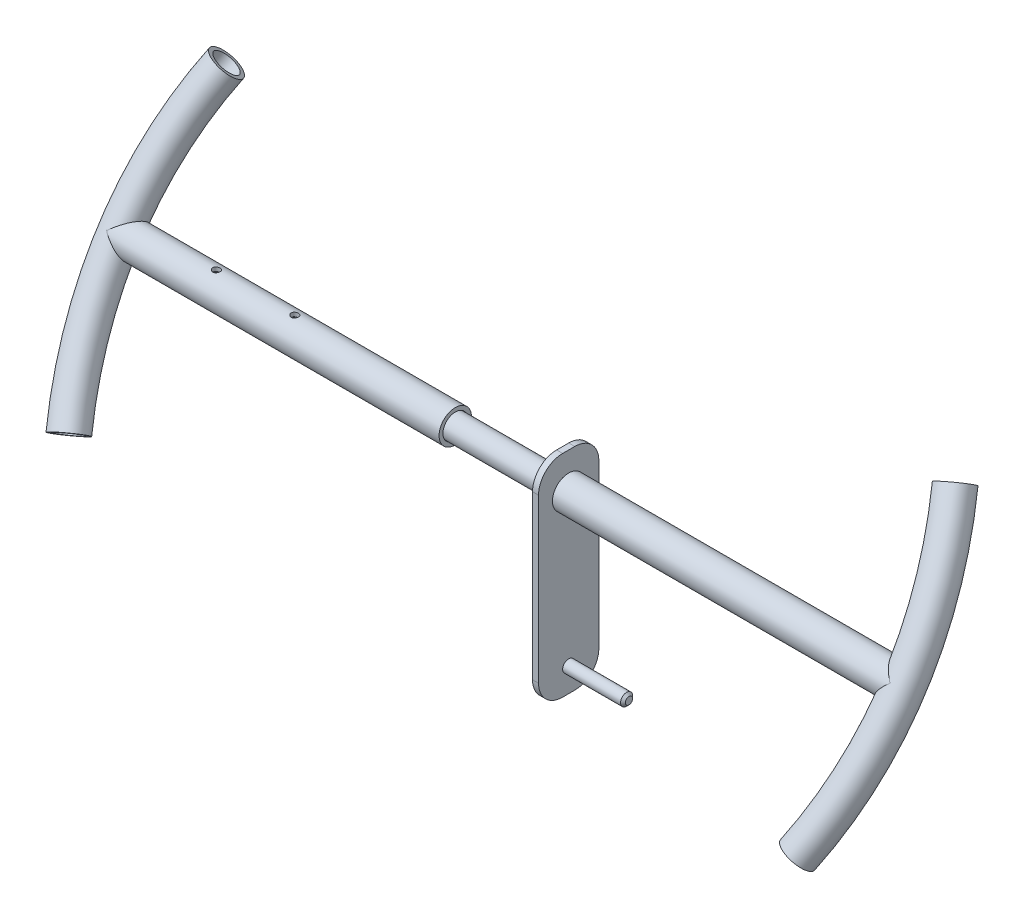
ISO-10303-21;
HEADER;
FILE_DESCRIPTION(('STEP AP214'),'2;1');
FILE_NAME('part.step','',(''),(''),'','','');
FILE_SCHEMA(('AUTOMOTIVE_DESIGN { 1 0 10303 214 1 1 1 1 }'));
ENDSEC;
DATA;
#1=APPLICATION_CONTEXT('core data for automotive mechanical design processes');
#2=APPLICATION_PROTOCOL_DEFINITION('international standard','automotive_design',2000,#1);
#3=PRODUCT_CONTEXT('',#1,'mechanical');
#4=PRODUCT('Part','Part','',(#3));
#5=PRODUCT_RELATED_PRODUCT_CATEGORY('part','',(#4));
#6=PRODUCT_DEFINITION_FORMATION('','',#4);
#7=PRODUCT_DEFINITION_CONTEXT('part definition',#1,'design');
#8=PRODUCT_DEFINITION('design','',#6,#7);
#9=PRODUCT_DEFINITION_SHAPE('','',#8);
#10=(LENGTH_UNIT() NAMED_UNIT(*) SI_UNIT(.MILLI.,.METRE.));
#11=(NAMED_UNIT(*) PLANE_ANGLE_UNIT() SI_UNIT($,.RADIAN.));
#12=(NAMED_UNIT(*) SI_UNIT($,.STERADIAN.) SOLID_ANGLE_UNIT());
#13=UNCERTAINTY_MEASURE_WITH_UNIT(LENGTH_MEASURE(1.E-05),#10,'distance_accuracy_value','');
#14=(GEOMETRIC_REPRESENTATION_CONTEXT(3) GLOBAL_UNCERTAINTY_ASSIGNED_CONTEXT((#13)) GLOBAL_UNIT_ASSIGNED_CONTEXT((#10,
#11,#12)) REPRESENTATION_CONTEXT('',''));
#15=CARTESIAN_POINT('',(0.,0.,0.));
#16=DIRECTION('',(0.,0.,1.));
#17=DIRECTION('',(1.,0.,0.));
#18=AXIS2_PLACEMENT_3D('',#15,#16,#17);
#19=CARTESIAN_POINT('',(0.,1.11022302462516E-13,0.));
#20=DIRECTION('',(0.,0.544639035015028,0.838670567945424));
#21=DIRECTION('',(0.,-0.838670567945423,0.544639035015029));
#22=AXIS2_PLACEMENT_3D('',#19,#20,#21);
#23=TOROIDAL_SURFACE('',#22,325.,10.25);
#24=CARTESIAN_POINT('',(-302.034766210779,100.640468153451,-65.3566842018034));
#25=DIRECTION('',(0.369230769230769,0.779408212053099,-0.50615361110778));
#26=DIRECTION('',(0.,-0.544639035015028,-0.838670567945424));
#27=AXIS2_PLACEMENT_3D('',#24,#25,#26);
#28=CIRCLE('',#27,10.25);
#29=CARTESIAN_POINT('',(-311.560478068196,103.814513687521,-67.4179334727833));
#30=VERTEX_POINT('',#29);
#31=EDGE_CURVE('E71',#30,#30,#28,.T.);
#32=CARTESIAN_POINT('',(-302.034766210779,-100.640468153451,65.3566842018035));
#33=DIRECTION('',(-0.36923076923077,0.779408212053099,-0.50615361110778));
#34=DIRECTION('',(0.,-0.544639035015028,-0.838670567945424));
#35=AXIS2_PLACEMENT_3D('',#32,#33,#34);
#36=CIRCLE('',#35,10.25);
#37=CARTESIAN_POINT('',(-311.560478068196,-103.814513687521,67.4179334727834));
#38=VERTEX_POINT('',#37);
#39=EDGE_CURVE('E63',#38,#38,#36,.T.);
#40=CARTESIAN_POINT('',(0.,1.11022302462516E-13,0.));
#41=DIRECTION('',(0.,0.544639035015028,0.838670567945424));
#42=DIRECTION('',(0.,-0.838670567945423,0.544639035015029));
#43=AXIS2_PLACEMENT_3D('',#40,#41,#42);
#44=CIRCLE('',#43,335.25);
#45=EDGE_CURVE('',#30,#38,#44,.T.);
#46=ORIENTED_EDGE('',*,*,#31,.T.);
#47=ORIENTED_EDGE('',*,*,#39,.F.);
#48=ORIENTED_EDGE('',*,*,#45,.T.);
#49=ORIENTED_EDGE('',*,*,#45,.F.);
#50=EDGE_LOOP('',(#46,#48,#47,#49));
#51=FACE_BOUND('',#50,.T.);
#52=ADVANCED_FACE('F56',(#51),#23,.F.);
#53=CARTESIAN_POINT('',(0.,1.11022302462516E-13,0.));
#54=DIRECTION('',(0.,0.544639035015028,0.838670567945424));
#55=DIRECTION('',(0.,-0.838670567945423,0.544639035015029));
#56=AXIS2_PLACEMENT_3D('',#53,#54,#55);
#57=TOROIDAL_SURFACE('',#56,325.,13.45);
#58=CARTESIAN_POINT('',(-302.034766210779,100.640468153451,-65.3566842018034));
#59=DIRECTION('',(0.369230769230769,0.779408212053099,-0.50615361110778));
#60=DIRECTION('',(0.,-0.544639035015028,-0.838670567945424));
#61=AXIS2_PLACEMENT_3D('',#58,#59,#60);
#62=CIRCLE('',#61,13.45);
#63=CARTESIAN_POINT('',(-314.534358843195,104.805435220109,-68.0614454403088));
#64=VERTEX_POINT('',#63);
#65=EDGE_CURVE('E67',#64,#64,#62,.T.);
#66=CARTESIAN_POINT('',(-302.034766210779,-100.640468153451,65.3566842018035));
#67=DIRECTION('',(-0.36923076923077,0.779408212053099,-0.50615361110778));
#68=DIRECTION('',(0.,-0.544639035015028,-0.838670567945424));
#69=AXIS2_PLACEMENT_3D('',#66,#67,#68);
#70=CIRCLE('',#69,13.45);
#71=CARTESIAN_POINT('',(-314.534358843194,-104.805435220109,68.0614454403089));
#72=VERTEX_POINT('',#71);
#73=EDGE_CURVE('E13',#72,#72,#70,.T.);
#74=CARTESIAN_POINT('',(0.,1.11022302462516E-13,0.));
#75=DIRECTION('',(0.,0.544639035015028,0.838670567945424));
#76=DIRECTION('',(0.,-0.838670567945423,0.544639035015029));
#77=AXIS2_PLACEMENT_3D('',#74,#75,#76);
#78=CIRCLE('',#77,338.45);
#79=EDGE_CURVE('',#64,#72,#78,.T.);
#80=ORIENTED_EDGE('',*,*,#65,.F.);
#81=ORIENTED_EDGE('',*,*,#73,.T.);
#82=ORIENTED_EDGE('',*,*,#79,.T.);
#83=ORIENTED_EDGE('',*,*,#79,.F.);
#84=EDGE_LOOP('',(#80,#82,#81,#83));
#85=FACE_BOUND('',#84,.T.);
#86=ADVANCED_FACE('F58',(#85),#57,.T.);
#87=CARTESIAN_POINT('',(-302.034766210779,-100.640468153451,65.3566842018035));
#88=DIRECTION('',(0.36923076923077,-0.779408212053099,0.50615361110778));
#89=DIRECTION('',(0.,-0.544639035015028,-0.838670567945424));
#90=AXIS2_PLACEMENT_3D('',#87,#88,#89);
#91=PLANE('',#90);
#92=ORIENTED_EDGE('',*,*,#39,.T.);
#93=EDGE_LOOP('',(#92));
#94=FACE_BOUND('',#93,.T.);
#95=ORIENTED_EDGE('',*,*,#73,.F.);
#96=EDGE_LOOP('',(#95));
#97=FACE_BOUND('',#96,.T.);
#98=ADVANCED_FACE('F81',(#94,#97),#91,.T.);
#99=CARTESIAN_POINT('',(-302.034766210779,100.640468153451,-65.3566842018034));
#100=DIRECTION('',(-0.369230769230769,-0.779408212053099,0.50615361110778));
#101=DIRECTION('',(0.,-0.544639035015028,-0.838670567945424));
#102=AXIS2_PLACEMENT_3D('',#99,#100,#101);
#103=PLANE('',#102);
#104=ORIENTED_EDGE('',*,*,#31,.F.);
#105=EDGE_LOOP('',(#104));
#106=FACE_BOUND('',#105,.T.);
#107=ORIENTED_EDGE('',*,*,#65,.T.);
#108=EDGE_LOOP('',(#107));
#109=FACE_BOUND('',#108,.T.);
#110=ADVANCED_FACE('F78',(#106,#109),#103,.F.);
#111=CLOSED_SHELL('',(#52,#86,#98,#110));
#112=MANIFOLD_SOLID_BREP('B2',#111);
#113=CARTESIAN_POINT('',(-325.,0.,0.));
#114=DIRECTION('',(1.,0.,0.));
#115=DIRECTION('',(0.,0.,1.));
#116=AXIS2_PLACEMENT_3D('',#113,#114,#115);
#117=CYLINDRICAL_SURFACE('',#116,10.25);
#118=CARTESIAN_POINT('',(-180.,-9.8011478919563,3.));
#119=CARTESIAN_POINT('',(-179.835409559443,-9.8011499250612,2.99999746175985));
#120=CARTESIAN_POINT('',(-179.670793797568,-9.80533920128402,2.98640889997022));
#121=CARTESIAN_POINT('',(-179.346361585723,-9.82158066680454,2.93254510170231));
#122=CARTESIAN_POINT('',(-179.186546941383,-9.83363577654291,2.89225995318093));
#123=CARTESIAN_POINT('',(-178.876459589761,-9.86412916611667,2.78647726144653));
#124=CARTESIAN_POINT('',(-178.726172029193,-9.88255720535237,2.72102014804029));
#125=CARTESIAN_POINT('',(-178.438677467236,-9.92370640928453,2.56688318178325));
#126=CARTESIAN_POINT('',(-178.301472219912,-9.94642814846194,2.47820022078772));
#127=CARTESIAN_POINT('',(-178.039904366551,-9.99437203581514,2.27726971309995));
#128=CARTESIAN_POINT('',(-177.915994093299,-10.0196454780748,2.16444543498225));
#129=CARTESIAN_POINT('',(-177.688555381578,-10.0694059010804,1.91967193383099));
#130=CARTESIAN_POINT('',(-177.585029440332,-10.0938927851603,1.78772037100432));
#131=CARTESIAN_POINT('',(-177.399351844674,-10.1399014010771,1.50523867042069));
#132=CARTESIAN_POINT('',(-177.317658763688,-10.1613556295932,1.35439515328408));
#133=CARTESIAN_POINT('',(-177.180972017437,-10.1982873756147,1.0403776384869));
#134=CARTESIAN_POINT('',(-177.125972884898,-10.2137661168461,0.877206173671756));
#135=CARTESIAN_POINT('',(-177.045724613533,-10.2366399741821,0.547894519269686));
#136=CARTESIAN_POINT('',(-177.019703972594,-10.24424432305,0.381957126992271));
#137=CARTESIAN_POINT('',(-176.995714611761,-10.2512482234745,0.0479094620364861));
#138=CARTESIAN_POINT('',(-176.997740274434,-10.2506494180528,-0.120200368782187));
#139=CARTESIAN_POINT('',(-177.029262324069,-10.2414636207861,-0.448418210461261));
#140=CARTESIAN_POINT('',(-177.057923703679,-10.2331194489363,-0.608614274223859));
#141=CARTESIAN_POINT('',(-177.14054305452,-10.209673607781,-0.921814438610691));
#142=CARTESIAN_POINT('',(-177.194502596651,-10.1945715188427,-1.07481809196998));
#143=CARTESIAN_POINT('',(-177.326768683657,-10.1589654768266,-1.37130845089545));
#144=CARTESIAN_POINT('',(-177.405343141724,-10.1384024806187,-1.51466825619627));
#145=CARTESIAN_POINT('',(-177.584398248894,-10.0940637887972,-1.78643893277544));
#146=CARTESIAN_POINT('',(-177.684883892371,-10.0702873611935,-1.91484638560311));
#147=CARTESIAN_POINT('',(-177.909263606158,-10.0210421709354,-2.15805172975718));
#148=CARTESIAN_POINT('',(-178.033882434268,-9.99554332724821,-2.27217574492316));
#149=CARTESIAN_POINT('',(-178.300742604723,-9.94649703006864,-2.47809018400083));
#150=CARTESIAN_POINT('',(-178.442985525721,-9.92294975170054,-2.56987860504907));
#151=CARTESIAN_POINT('',(-178.742757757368,-9.8803338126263,-2.72917424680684));
#152=CARTESIAN_POINT('',(-178.900409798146,-9.86130609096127,-2.79646225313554));
#153=CARTESIAN_POINT('',(-179.225491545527,-9.83037351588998,-2.90334074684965));
#154=CARTESIAN_POINT('',(-179.392918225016,-9.81846646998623,-2.94293976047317));
#155=CARTESIAN_POINT('',(-179.726408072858,-9.80360145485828,-2.9920792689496));
#156=CARTESIAN_POINT('',(-179.892307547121,-9.80033995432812,-3.00263977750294));
#157=CARTESIAN_POINT('',(-180.223509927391,-9.80229797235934,-2.99624231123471));
#158=CARTESIAN_POINT('',(-180.388812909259,-9.80751637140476,-2.97928796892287));
#159=CARTESIAN_POINT('',(-180.709951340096,-9.82554934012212,-2.91924851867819));
#160=CARTESIAN_POINT('',(-180.865919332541,-9.83817573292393,-2.87681014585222));
#161=CARTESIAN_POINT('',(-181.168513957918,-9.86940957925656,-2.76775194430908));
#162=CARTESIAN_POINT('',(-181.315139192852,-9.88801792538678,-2.70112850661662));
#163=CARTESIAN_POINT('',(-181.599061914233,-9.92971539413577,-2.54362592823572));
#164=CARTESIAN_POINT('',(-181.736021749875,-9.95290760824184,-2.4521660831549));
#165=CARTESIAN_POINT('',(-181.993023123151,-10.0009335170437,-2.24828329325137));
#166=CARTESIAN_POINT('',(-182.113060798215,-10.0257675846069,-2.13585557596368));
#167=CARTESIAN_POINT('',(-182.337219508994,-10.0753512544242,-1.88845042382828));
#168=CARTESIAN_POINT('',(-182.44061999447,-10.100066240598,-1.75281164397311));
#169=CARTESIAN_POINT('',(-182.62320359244,-10.1457310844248,-1.46552498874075));
#170=CARTESIAN_POINT('',(-182.702387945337,-10.1666811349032,-1.31387793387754));
#171=CARTESIAN_POINT('',(-182.833530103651,-10.2023244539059,-0.999909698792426));
#172=CARTESIAN_POINT('',(-182.885693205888,-10.2170647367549,-0.837679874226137));
#173=CARTESIAN_POINT('',(-182.961857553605,-10.2388353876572,-0.506250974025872));
#174=CARTESIAN_POINT('',(-182.985866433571,-10.245867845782,-0.337053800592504));
#175=CARTESIAN_POINT('',(-183.004483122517,-10.2513096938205,-0.0031677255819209));
#176=CARTESIAN_POINT('',(-183.000138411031,-10.2500263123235,0.161458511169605));
#177=CARTESIAN_POINT('',(-182.964658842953,-10.2396980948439,0.487535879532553));
#178=CARTESIAN_POINT('',(-182.933525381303,-10.2306536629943,0.648987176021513));
#179=CARTESIAN_POINT('',(-182.845988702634,-10.205901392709,0.96260189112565));
#180=CARTESIAN_POINT('',(-182.789835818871,-10.1902596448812,1.11484075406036));
#181=CARTESIAN_POINT('',(-182.654077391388,-10.1539334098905,1.40781835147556));
#182=CARTESIAN_POINT('',(-182.574468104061,-10.1332481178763,1.54855524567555));
#183=CARTESIAN_POINT('',(-182.391205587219,-10.0882233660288,1.81924959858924));
#184=CARTESIAN_POINT('',(-182.286886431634,-10.0637908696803,1.94874063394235));
#185=CARTESIAN_POINT('',(-182.058378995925,-10.0143398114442,2.18873061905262));
#186=CARTESIAN_POINT('',(-181.934185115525,-9.98932108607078,2.29922419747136));
#187=CARTESIAN_POINT('',(-181.665283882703,-9.94071065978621,2.50117621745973));
#188=CARTESIAN_POINT('',(-181.520100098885,-9.91717840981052,2.59201612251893));
#189=CARTESIAN_POINT('',(-181.215854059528,-9.87512931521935,2.74788601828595));
#190=CARTESIAN_POINT('',(-181.056799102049,-9.85660985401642,2.8129294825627));
#191=CARTESIAN_POINT('',(-180.749114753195,-9.82868775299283,2.90887966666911));
#192=CARTESIAN_POINT('',(-180.601544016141,-9.81845454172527,2.94295899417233));
#193=CARTESIAN_POINT('',(-180.302655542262,-9.80468427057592,2.9885183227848));
#194=CARTESIAN_POINT('',(-180.151338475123,-9.80114602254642,3.00000233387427));
#195=CARTESIAN_POINT('',(-180.,-9.8011478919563,3.));
#196=B_SPLINE_CURVE_WITH_KNOTS('',3,(#118,#119,#120,#121,#122,#123,#124,#125,#126,#127,#128,
#129,#130,#131,#132,#133,#134,#135,#136,#137,#138,#139,#140,#141,#142,#143,#144,#145,#146,#147,
#148,#149,#150,#151,#152,#153,#154,#155,#156,#157,#158,#159,#160,#161,#162,#163,#164,#165,#166,
#167,#168,#169,#170,#171,#172,#173,#174,#175,#176,#177,#178,#179,#180,#181,#182,#183,#184,#185,
#186,#187,#188,#189,#190,#191,#192,#193,#194,#195),.UNSPECIFIED.,.T.,.F.,(4,2,2,2,2,2,2,2,2,2,2,
2,2,2,2,2,2,2,2,2,2,2,2,2,2,2,2,2,2,2,2,2,2,2,2,2,2,2,4),(0.,0.49321347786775,0.986610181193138,
1.47921770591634,1.97189118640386,2.47800183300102,2.9841744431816,3.50026538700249,
4.01625058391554,4.51814325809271,5.0199354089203,5.50650898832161,5.99311278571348,
6.48520851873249,6.97741653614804,7.48771965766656,7.99806852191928,8.51287754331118,
9.02752797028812,9.52385463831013,10.0201157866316,10.5042856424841,10.988527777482,
11.4852460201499,11.982077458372,12.4966323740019,13.0111609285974,13.5217207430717,
14.0321420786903,14.5238162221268,15.0154647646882,15.5023008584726,15.9892146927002,
16.4911482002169,16.9932233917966,17.5093353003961,18.0251772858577,18.4787602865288,
18.9322627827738),.UNSPECIFIED.);
#197=CARTESIAN_POINT('',(-180.,-9.8011478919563,3.));
#198=VERTEX_POINT('',#197);
#199=EDGE_CURVE('E188',#198,#198,#196,.T.);
#200=ORIENTED_EDGE('',*,*,#199,.F.);
#201=EDGE_LOOP('',(#200));
#202=FACE_BOUND('',#201,.T.);
#203=CARTESIAN_POINT('',(-180.,9.80114789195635,3.));
#204=CARTESIAN_POINT('',(-180.164590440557,9.80114992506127,2.99999746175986));
#205=CARTESIAN_POINT('',(-180.329206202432,9.80533920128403,2.98640889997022));
#206=CARTESIAN_POINT('',(-180.653638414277,9.82158066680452,2.93254510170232));
#207=CARTESIAN_POINT('',(-180.813453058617,9.83363577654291,2.89225995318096));
#208=CARTESIAN_POINT('',(-181.123540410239,9.86412916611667,2.78647726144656));
#209=CARTESIAN_POINT('',(-181.273827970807,9.88255720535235,2.72102014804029));
#210=CARTESIAN_POINT('',(-181.561322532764,9.92370640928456,2.56688318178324));
#211=CARTESIAN_POINT('',(-181.698527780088,9.94642814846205,2.47820022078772));
#212=CARTESIAN_POINT('',(-181.960095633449,9.99437203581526,2.27726971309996));
#213=CARTESIAN_POINT('',(-182.084005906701,10.0196454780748,2.16444543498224));
#214=CARTESIAN_POINT('',(-182.311444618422,10.0694059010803,1.91967193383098));
#215=CARTESIAN_POINT('',(-182.414970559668,10.0938927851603,1.78772037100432));
#216=CARTESIAN_POINT('',(-182.600648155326,10.1399014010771,1.50523867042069));
#217=CARTESIAN_POINT('',(-182.682341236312,10.1613556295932,1.35439515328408));
#218=CARTESIAN_POINT('',(-182.819027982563,10.1982873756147,1.04037763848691));
#219=CARTESIAN_POINT('',(-182.874027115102,10.2137661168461,0.877206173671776));
#220=CARTESIAN_POINT('',(-182.954275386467,10.2366399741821,0.547894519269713));
#221=CARTESIAN_POINT('',(-182.980296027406,10.24424432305,0.381957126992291));
#222=CARTESIAN_POINT('',(-183.004285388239,10.2512482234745,0.0479094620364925));
#223=CARTESIAN_POINT('',(-183.002259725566,10.2506494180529,-0.120200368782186));
#224=CARTESIAN_POINT('',(-182.970737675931,10.2414636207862,-0.448418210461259));
#225=CARTESIAN_POINT('',(-182.942076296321,10.2331194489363,-0.60861427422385));
#226=CARTESIAN_POINT('',(-182.85945694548,10.209673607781,-0.921814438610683));
#227=CARTESIAN_POINT('',(-182.805497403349,10.1945715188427,-1.07481809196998));
#228=CARTESIAN_POINT('',(-182.673231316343,10.1589654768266,-1.37130845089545));
#229=CARTESIAN_POINT('',(-182.594656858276,10.1384024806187,-1.51466825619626));
#230=CARTESIAN_POINT('',(-182.415601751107,10.0940637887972,-1.78643893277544));
#231=CARTESIAN_POINT('',(-182.315116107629,10.0702873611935,-1.91484638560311));
#232=CARTESIAN_POINT('',(-182.090736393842,10.0210421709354,-2.15805172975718));
#233=CARTESIAN_POINT('',(-181.966117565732,9.99554332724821,-2.27217574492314));
#234=CARTESIAN_POINT('',(-181.699257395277,9.94649703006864,-2.47809018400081));
#235=CARTESIAN_POINT('',(-181.557014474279,9.92294975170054,-2.56987860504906));
#236=CARTESIAN_POINT('',(-181.257242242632,9.8803338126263,-2.72917424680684));
#237=CARTESIAN_POINT('',(-181.099590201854,9.86130609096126,-2.79646225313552));
#238=CARTESIAN_POINT('',(-180.774508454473,9.83037351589,-2.90334074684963));
#239=CARTESIAN_POINT('',(-180.607081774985,9.8184664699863,-2.94293976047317));
#240=CARTESIAN_POINT('',(-180.273591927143,9.80360145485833,-2.99207926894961));
#241=CARTESIAN_POINT('',(-180.107692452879,9.80033995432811,-3.00263977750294));
#242=CARTESIAN_POINT('',(-179.776490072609,9.80229797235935,-2.99624231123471));
#243=CARTESIAN_POINT('',(-179.611187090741,9.80751637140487,-2.97928796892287));
#244=CARTESIAN_POINT('',(-179.290048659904,9.82554934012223,-2.9192485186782));
#245=CARTESIAN_POINT('',(-179.134080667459,9.83817573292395,-2.87681014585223));
#246=CARTESIAN_POINT('',(-178.831486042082,9.86940957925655,-2.76775194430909));
#247=CARTESIAN_POINT('',(-178.684860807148,9.88801792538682,-2.70112850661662));
#248=CARTESIAN_POINT('',(-178.400938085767,9.92971539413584,-2.54362592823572));
#249=CARTESIAN_POINT('',(-178.263978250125,9.95290760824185,-2.45216608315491));
#250=CARTESIAN_POINT('',(-178.006976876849,10.0009335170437,-2.24828329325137));
#251=CARTESIAN_POINT('',(-177.886939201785,10.0257675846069,-2.13585557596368));
#252=CARTESIAN_POINT('',(-177.662780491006,10.0753512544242,-1.88845042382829));
#253=CARTESIAN_POINT('',(-177.55938000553,10.100066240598,-1.75281164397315));
#254=CARTESIAN_POINT('',(-177.376796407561,10.1457310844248,-1.46552498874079));
#255=CARTESIAN_POINT('',(-177.297612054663,10.1666811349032,-1.31387793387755));
#256=CARTESIAN_POINT('',(-177.166469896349,10.2023244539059,-0.999909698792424));
#257=CARTESIAN_POINT('',(-177.114306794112,10.2170647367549,-0.837679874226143));
#258=CARTESIAN_POINT('',(-177.038142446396,10.2388353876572,-0.50625097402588));
#259=CARTESIAN_POINT('',(-177.014133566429,10.245867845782,-0.337053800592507));
#260=CARTESIAN_POINT('',(-176.995516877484,10.2513096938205,-0.00316772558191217));
#261=CARTESIAN_POINT('',(-176.999861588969,10.2500263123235,0.161458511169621));
#262=CARTESIAN_POINT('',(-177.035341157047,10.239698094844,0.487535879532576));
#263=CARTESIAN_POINT('',(-177.066474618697,10.2306536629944,0.648987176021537));
#264=CARTESIAN_POINT('',(-177.154011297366,10.205901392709,0.962601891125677));
#265=CARTESIAN_POINT('',(-177.210164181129,10.1902596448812,1.11484075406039));
#266=CARTESIAN_POINT('',(-177.345922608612,10.1539334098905,1.40781835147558));
#267=CARTESIAN_POINT('',(-177.425531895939,10.1332481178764,1.54855524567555));
#268=CARTESIAN_POINT('',(-177.608794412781,10.0882233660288,1.81924959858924));
#269=CARTESIAN_POINT('',(-177.713113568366,10.0637908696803,1.94874063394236));
#270=CARTESIAN_POINT('',(-177.941621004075,10.0143398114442,2.18873061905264));
#271=CARTESIAN_POINT('',(-178.065814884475,9.98932108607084,2.29922419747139));
#272=CARTESIAN_POINT('',(-178.334716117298,9.94071065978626,2.50117621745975));
#273=CARTESIAN_POINT('',(-178.479899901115,9.91717840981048,2.59201612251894));
#274=CARTESIAN_POINT('',(-178.784145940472,9.87512931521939,2.74788601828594));
#275=CARTESIAN_POINT('',(-178.943200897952,9.85660985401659,2.8129294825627));
#276=CARTESIAN_POINT('',(-179.250885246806,9.82868775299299,2.90887966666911));
#277=CARTESIAN_POINT('',(-179.398455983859,9.8184545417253,2.94295899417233));
#278=CARTESIAN_POINT('',(-179.697344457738,9.8046842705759,2.98851832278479));
#279=CARTESIAN_POINT('',(-179.848661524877,9.80114602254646,3.00000233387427));
#280=CARTESIAN_POINT('',(-180.,9.80114789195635,3.));
#281=B_SPLINE_CURVE_WITH_KNOTS('',3,(#203,#204,#205,#206,#207,#208,#209,#210,#211,#212,#213,
#214,#215,#216,#217,#218,#219,#220,#221,#222,#223,#224,#225,#226,#227,#228,#229,#230,#231,#232,
#233,#234,#235,#236,#237,#238,#239,#240,#241,#242,#243,#244,#245,#246,#247,#248,#249,#250,#251,
#252,#253,#254,#255,#256,#257,#258,#259,#260,#261,#262,#263,#264,#265,#266,#267,#268,#269,#270,
#271,#272,#273,#274,#275,#276,#277,#278,#279,#280),.UNSPECIFIED.,.T.,.F.,(4,2,2,2,2,2,2,2,2,2,2,
2,2,2,2,2,2,2,2,2,2,2,2,2,2,2,2,2,2,2,2,2,2,2,2,2,2,2,4),(0.,0.493213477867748,
0.986610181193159,1.4792177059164,1.97189118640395,2.47800183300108,2.98417444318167,
3.50026538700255,4.01625058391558,4.51814325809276,5.01993540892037,5.50650898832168,
5.99311278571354,6.48520851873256,6.97741653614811,7.48771965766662,7.99806852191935,
8.51287754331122,9.02752797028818,9.52385463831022,10.0201157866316,10.5042856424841,
10.9885277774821,11.48524602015,11.9820774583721,12.496632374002,13.0111609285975,
13.5217207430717,14.0321420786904,14.5238162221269,15.0154647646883,15.5023008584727,
15.9892146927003,16.4911482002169,16.9932233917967,17.5093353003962,18.0251772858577,
18.4787602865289,18.9322627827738),.UNSPECIFIED.);
#282=CARTESIAN_POINT('',(-180.,9.80114789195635,3.));
#283=VERTEX_POINT('',#282);
#284=EDGE_CURVE('E210',#283,#283,#281,.T.);
#285=ORIENTED_EDGE('',*,*,#284,.F.);
#286=EDGE_LOOP('',(#285));
#287=FACE_BOUND('',#286,.T.);
#288=CARTESIAN_POINT('',(-245.,-9.8011478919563,3.));
#289=CARTESIAN_POINT('',(-244.835409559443,-9.8011499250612,2.99999746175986));
#290=CARTESIAN_POINT('',(-244.670793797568,-9.80533920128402,2.98640889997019));
#291=CARTESIAN_POINT('',(-244.346361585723,-9.82158066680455,2.93254510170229));
#292=CARTESIAN_POINT('',(-244.186546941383,-9.83363577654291,2.89225995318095));
#293=CARTESIAN_POINT('',(-243.876459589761,-9.86412916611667,2.78647726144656));
#294=CARTESIAN_POINT('',(-243.726172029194,-9.88255720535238,2.72102014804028));
#295=CARTESIAN_POINT('',(-243.438677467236,-9.92370640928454,2.56688318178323));
#296=CARTESIAN_POINT('',(-243.301472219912,-9.94642814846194,2.47820022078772));
#297=CARTESIAN_POINT('',(-243.039904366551,-9.99437203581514,2.27726971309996));
#298=CARTESIAN_POINT('',(-242.915994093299,-10.0196454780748,2.16444543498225));
#299=CARTESIAN_POINT('',(-242.688555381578,-10.0694059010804,1.91967193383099));
#300=CARTESIAN_POINT('',(-242.585029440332,-10.0938927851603,1.78772037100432));
#301=CARTESIAN_POINT('',(-242.399351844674,-10.1399014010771,1.50523867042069));
#302=CARTESIAN_POINT('',(-242.317658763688,-10.1613556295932,1.35439515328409));
#303=CARTESIAN_POINT('',(-242.180972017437,-10.1982873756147,1.0403776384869));
#304=CARTESIAN_POINT('',(-242.125972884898,-10.2137661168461,0.877206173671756));
#305=CARTESIAN_POINT('',(-242.045724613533,-10.2366399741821,0.547894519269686));
#306=CARTESIAN_POINT('',(-242.019703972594,-10.24424432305,0.381957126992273));
#307=CARTESIAN_POINT('',(-241.995714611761,-10.2512482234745,0.0479094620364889));
#308=CARTESIAN_POINT('',(-241.997740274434,-10.2506494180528,-0.120200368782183));
#309=CARTESIAN_POINT('',(-242.029262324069,-10.2414636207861,-0.448418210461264));
#310=CARTESIAN_POINT('',(-242.057923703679,-10.2331194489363,-0.608614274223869));
#311=CARTESIAN_POINT('',(-242.14054305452,-10.209673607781,-0.921814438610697));
#312=CARTESIAN_POINT('',(-242.194502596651,-10.1945715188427,-1.07481809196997));
#313=CARTESIAN_POINT('',(-242.326768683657,-10.1589654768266,-1.37130845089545));
#314=CARTESIAN_POINT('',(-242.405343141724,-10.1384024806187,-1.51466825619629));
#315=CARTESIAN_POINT('',(-242.584398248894,-10.0940637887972,-1.78643893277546));
#316=CARTESIAN_POINT('',(-242.684883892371,-10.0702873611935,-1.91484638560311));
#317=CARTESIAN_POINT('',(-242.909263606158,-10.0210421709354,-2.15805172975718));
#318=CARTESIAN_POINT('',(-243.033882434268,-9.9955433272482,-2.27217574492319));
#319=CARTESIAN_POINT('',(-243.300742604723,-9.94649703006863,-2.47809018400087));
#320=CARTESIAN_POINT('',(-243.442985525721,-9.92294975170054,-2.56987860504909));
#321=CARTESIAN_POINT('',(-243.742757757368,-9.88033381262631,-2.72917424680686));
#322=CARTESIAN_POINT('',(-243.900409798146,-9.86130609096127,-2.79646225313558));
#323=CARTESIAN_POINT('',(-244.225491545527,-9.83037351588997,-2.90334074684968));
#324=CARTESIAN_POINT('',(-244.392918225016,-9.81846646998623,-2.94293976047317));
#325=CARTESIAN_POINT('',(-244.726408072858,-9.80360145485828,-2.9920792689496));
#326=CARTESIAN_POINT('',(-244.892307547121,-9.80033995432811,-3.00263977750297));
#327=CARTESIAN_POINT('',(-245.223509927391,-9.80229797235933,-2.99624231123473));
#328=CARTESIAN_POINT('',(-245.388812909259,-9.80751637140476,-2.97928796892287));
#329=CARTESIAN_POINT('',(-245.709951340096,-9.82554934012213,-2.91924851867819));
#330=CARTESIAN_POINT('',(-245.865919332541,-9.83817573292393,-2.87681014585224));
#331=CARTESIAN_POINT('',(-246.168513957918,-9.86940957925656,-2.7677519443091));
#332=CARTESIAN_POINT('',(-246.315139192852,-9.88801792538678,-2.70112850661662));
#333=CARTESIAN_POINT('',(-246.599061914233,-9.92971539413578,-2.54362592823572));
#334=CARTESIAN_POINT('',(-246.736021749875,-9.95290760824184,-2.4521660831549));
#335=CARTESIAN_POINT('',(-246.993023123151,-10.0009335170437,-2.24828329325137));
#336=CARTESIAN_POINT('',(-247.113060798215,-10.0257675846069,-2.13585557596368));
#337=CARTESIAN_POINT('',(-247.337219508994,-10.0753512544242,-1.8884504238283));
#338=CARTESIAN_POINT('',(-247.44061999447,-10.100066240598,-1.75281164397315));
#339=CARTESIAN_POINT('',(-247.62320359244,-10.1457310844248,-1.4655249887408));
#340=CARTESIAN_POINT('',(-247.702387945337,-10.1666811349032,-1.31387793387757));
#341=CARTESIAN_POINT('',(-247.833530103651,-10.2023244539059,-0.999909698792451));
#342=CARTESIAN_POINT('',(-247.885693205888,-10.2170647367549,-0.837679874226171));
#343=CARTESIAN_POINT('',(-247.961857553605,-10.2388353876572,-0.506250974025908));
#344=CARTESIAN_POINT('',(-247.985866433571,-10.245867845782,-0.337053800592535));
#345=CARTESIAN_POINT('',(-248.004483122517,-10.2513096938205,-0.00316772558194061));
#346=CARTESIAN_POINT('',(-248.000138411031,-10.2500263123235,0.16145851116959));
#347=CARTESIAN_POINT('',(-247.964658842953,-10.2396980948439,0.487535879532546));
#348=CARTESIAN_POINT('',(-247.933525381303,-10.2306536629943,0.648987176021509));
#349=CARTESIAN_POINT('',(-247.845988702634,-10.205901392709,0.962601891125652));
#350=CARTESIAN_POINT('',(-247.789835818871,-10.1902596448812,1.11484075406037));
#351=CARTESIAN_POINT('',(-247.654077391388,-10.1539334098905,1.40781835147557));
#352=CARTESIAN_POINT('',(-247.574468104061,-10.1332481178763,1.54855524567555));
#353=CARTESIAN_POINT('',(-247.391205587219,-10.0882233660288,1.81924959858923));
#354=CARTESIAN_POINT('',(-247.286886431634,-10.0637908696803,1.94874063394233));
#355=CARTESIAN_POINT('',(-247.058378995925,-10.0143398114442,2.18873061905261));
#356=CARTESIAN_POINT('',(-246.934185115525,-9.98932108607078,2.29922419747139));
#357=CARTESIAN_POINT('',(-246.665283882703,-9.94071065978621,2.50117621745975));
#358=CARTESIAN_POINT('',(-246.520100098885,-9.91717840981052,2.59201612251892));
#359=CARTESIAN_POINT('',(-246.215854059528,-9.87512931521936,2.74788601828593));
#360=CARTESIAN_POINT('',(-246.056799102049,-9.85660985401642,2.81292948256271));
#361=CARTESIAN_POINT('',(-245.749114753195,-9.82868775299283,2.90887966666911));
#362=CARTESIAN_POINT('',(-245.601544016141,-9.81845454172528,2.94295899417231));
#363=CARTESIAN_POINT('',(-245.302655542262,-9.80468427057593,2.98851832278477));
#364=CARTESIAN_POINT('',(-245.151338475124,-9.80114602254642,3.00000233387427));
#365=CARTESIAN_POINT('',(-245.,-9.8011478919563,3.));
#366=B_SPLINE_CURVE_WITH_KNOTS('',3,(#288,#289,#290,#291,#292,#293,#294,#295,#296,#297,#298,
#299,#300,#301,#302,#303,#304,#305,#306,#307,#308,#309,#310,#311,#312,#313,#314,#315,#316,#317,
#318,#319,#320,#321,#322,#323,#324,#325,#326,#327,#328,#329,#330,#331,#332,#333,#334,#335,#336,
#337,#338,#339,#340,#341,#342,#343,#344,#345,#346,#347,#348,#349,#350,#351,#352,#353,#354,#355,
#356,#357,#358,#359,#360,#361,#362,#363,#364,#365),.UNSPECIFIED.,.T.,.F.,(4,2,2,2,2,2,2,2,2,2,2,
2,2,2,2,2,2,2,2,2,2,2,2,2,2,2,2,2,2,2,2,2,2,2,2,2,2,2,4),(0.,0.493213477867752,
0.986610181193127,1.47921770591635,1.97189118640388,2.47800183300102,2.9841744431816,
3.50026538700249,4.01625058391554,4.51814325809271,5.01993540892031,5.50650898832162,
5.99311278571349,6.4852085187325,6.97741653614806,7.48771965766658,7.99806852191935,
8.51287754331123,9.02752797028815,9.52385463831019,10.0201157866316,10.5042856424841,
10.9885277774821,11.4852460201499,11.9820774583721,12.4966323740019,13.0111609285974,
13.5217207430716,14.0321420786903,14.5238162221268,15.0154647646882,15.5023008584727,
15.9892146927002,16.4911482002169,16.9932233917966,17.5093353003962,18.0251772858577,
18.4787602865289,18.9322627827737),.UNSPECIFIED.);
#367=CARTESIAN_POINT('',(-245.,-9.8011478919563,3.));
#368=VERTEX_POINT('',#367);
#369=EDGE_CURVE('E158',#368,#368,#366,.T.);
#370=ORIENTED_EDGE('',*,*,#369,.F.);
#371=EDGE_LOOP('',(#370));
#372=FACE_BOUND('',#371,.T.);
#373=CARTESIAN_POINT('',(-245.,9.80114789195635,3.));
#374=CARTESIAN_POINT('',(-245.164590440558,9.80114992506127,2.99999746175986));
#375=CARTESIAN_POINT('',(-245.329206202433,9.80533920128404,2.98640889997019));
#376=CARTESIAN_POINT('',(-245.653638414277,9.82158066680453,2.93254510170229));
#377=CARTESIAN_POINT('',(-245.813453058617,9.83363577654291,2.89225995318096));
#378=CARTESIAN_POINT('',(-246.123540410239,9.86412916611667,2.78647726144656));
#379=CARTESIAN_POINT('',(-246.273827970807,9.88255720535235,2.72102014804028));
#380=CARTESIAN_POINT('',(-246.561322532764,9.92370640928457,2.56688318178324));
#381=CARTESIAN_POINT('',(-246.698527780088,9.94642814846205,2.47820022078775));
#382=CARTESIAN_POINT('',(-246.960095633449,9.99437203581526,2.27726971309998));
#383=CARTESIAN_POINT('',(-247.084005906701,10.0196454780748,2.16444543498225));
#384=CARTESIAN_POINT('',(-247.311444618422,10.0694059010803,1.91967193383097));
#385=CARTESIAN_POINT('',(-247.414970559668,10.0938927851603,1.78772037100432));
#386=CARTESIAN_POINT('',(-247.600648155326,10.1399014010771,1.5052386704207));
#387=CARTESIAN_POINT('',(-247.682341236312,10.1613556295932,1.35439515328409));
#388=CARTESIAN_POINT('',(-247.819027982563,10.1982873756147,1.04037763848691));
#389=CARTESIAN_POINT('',(-247.874027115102,10.2137661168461,0.877206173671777));
#390=CARTESIAN_POINT('',(-247.954275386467,10.2366399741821,0.547894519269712));
#391=CARTESIAN_POINT('',(-247.980296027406,10.24424432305,0.381957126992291));
#392=CARTESIAN_POINT('',(-248.004285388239,10.2512482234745,0.0479094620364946));
#393=CARTESIAN_POINT('',(-248.002259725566,10.2506494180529,-0.120200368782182));
#394=CARTESIAN_POINT('',(-247.970737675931,10.2414636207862,-0.448418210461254));
#395=CARTESIAN_POINT('',(-247.942076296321,10.2331194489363,-0.608614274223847));
#396=CARTESIAN_POINT('',(-247.85945694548,10.209673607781,-0.921814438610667));
#397=CARTESIAN_POINT('',(-247.805497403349,10.1945715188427,-1.07481809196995));
#398=CARTESIAN_POINT('',(-247.673231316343,10.1589654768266,-1.37130845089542));
#399=CARTESIAN_POINT('',(-247.594656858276,10.1384024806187,-1.51466825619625));
#400=CARTESIAN_POINT('',(-247.415601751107,10.0940637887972,-1.78643893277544));
#401=CARTESIAN_POINT('',(-247.315116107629,10.0702873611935,-1.91484638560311));
#402=CARTESIAN_POINT('',(-247.090736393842,10.0210421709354,-2.15805172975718));
#403=CARTESIAN_POINT('',(-246.966117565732,9.99554332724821,-2.27217574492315));
#404=CARTESIAN_POINT('',(-246.699257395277,9.94649703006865,-2.47809018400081));
#405=CARTESIAN_POINT('',(-246.557014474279,9.92294975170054,-2.56987860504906));
#406=CARTESIAN_POINT('',(-246.257242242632,9.8803338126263,-2.72917424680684));
#407=CARTESIAN_POINT('',(-246.099590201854,9.86130609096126,-2.79646225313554));
#408=CARTESIAN_POINT('',(-245.774508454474,9.83037351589,-2.90334074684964));
#409=CARTESIAN_POINT('',(-245.607081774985,9.8184664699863,-2.94293976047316));
#410=CARTESIAN_POINT('',(-245.273591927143,9.80360145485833,-2.99207926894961));
#411=CARTESIAN_POINT('',(-245.107692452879,9.8003399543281,-3.00263977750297));
#412=CARTESIAN_POINT('',(-244.776490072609,9.80229797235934,-2.99624231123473));
#413=CARTESIAN_POINT('',(-244.611187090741,9.80751637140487,-2.97928796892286));
#414=CARTESIAN_POINT('',(-244.290048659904,9.82554934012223,-2.9192485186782));
#415=CARTESIAN_POINT('',(-244.134080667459,9.83817573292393,-2.87681014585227));
#416=CARTESIAN_POINT('',(-243.831486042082,9.86940957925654,-2.76775194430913));
#417=CARTESIAN_POINT('',(-243.684860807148,9.88801792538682,-2.70112850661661));
#418=CARTESIAN_POINT('',(-243.400938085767,9.92971539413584,-2.54362592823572));
#419=CARTESIAN_POINT('',(-243.263978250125,9.95290760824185,-2.45216608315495));
#420=CARTESIAN_POINT('',(-243.006976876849,10.0009335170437,-2.24828329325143));
#421=CARTESIAN_POINT('',(-242.886939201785,10.0257675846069,-2.13585557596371));
#422=CARTESIAN_POINT('',(-242.662780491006,10.0753512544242,-1.88845042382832));
#423=CARTESIAN_POINT('',(-242.559380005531,10.100066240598,-1.75281164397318));
#424=CARTESIAN_POINT('',(-242.376796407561,10.1457310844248,-1.46552498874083));
#425=CARTESIAN_POINT('',(-242.297612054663,10.1666811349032,-1.31387793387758));
#426=CARTESIAN_POINT('',(-242.166469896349,10.2023244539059,-0.999909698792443));
#427=CARTESIAN_POINT('',(-242.114306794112,10.2170647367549,-0.837679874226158));
#428=CARTESIAN_POINT('',(-242.038142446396,10.2388353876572,-0.506250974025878));
#429=CARTESIAN_POINT('',(-242.014133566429,10.245867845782,-0.337053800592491));
#430=CARTESIAN_POINT('',(-241.995516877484,10.2513096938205,-0.00316772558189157));
#431=CARTESIAN_POINT('',(-241.999861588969,10.2500263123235,0.161458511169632));
#432=CARTESIAN_POINT('',(-242.035341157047,10.239698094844,0.487535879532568));
#433=CARTESIAN_POINT('',(-242.066474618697,10.2306536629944,0.648987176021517));
#434=CARTESIAN_POINT('',(-242.154011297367,10.205901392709,0.962601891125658));
#435=CARTESIAN_POINT('',(-242.210164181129,10.1902596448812,1.11484075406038));
#436=CARTESIAN_POINT('',(-242.345922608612,10.1539334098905,1.4078183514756));
#437=CARTESIAN_POINT('',(-242.425531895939,10.1332481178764,1.54855524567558));
#438=CARTESIAN_POINT('',(-242.608794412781,10.0882233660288,1.81924959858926));
#439=CARTESIAN_POINT('',(-242.713113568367,10.0637908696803,1.94874063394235));
#440=CARTESIAN_POINT('',(-242.941621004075,10.0143398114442,2.18873061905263));
#441=CARTESIAN_POINT('',(-243.065814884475,9.98932108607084,2.2992241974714));
#442=CARTESIAN_POINT('',(-243.334716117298,9.94071065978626,2.50117621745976));
#443=CARTESIAN_POINT('',(-243.479899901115,9.91717840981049,2.59201612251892));
#444=CARTESIAN_POINT('',(-243.784145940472,9.87512931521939,2.74788601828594));
#445=CARTESIAN_POINT('',(-243.943200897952,9.85660985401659,2.81292948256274));
#446=CARTESIAN_POINT('',(-244.250885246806,9.82868775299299,2.90887966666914));
#447=CARTESIAN_POINT('',(-244.398455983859,9.8184545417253,2.94295899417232));
#448=CARTESIAN_POINT('',(-244.697344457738,9.8046842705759,2.98851832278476));
#449=CARTESIAN_POINT('',(-244.848661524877,9.80114602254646,3.00000233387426));
#450=CARTESIAN_POINT('',(-245.,9.80114789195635,3.));
#451=B_SPLINE_CURVE_WITH_KNOTS('',3,(#373,#374,#375,#376,#377,#378,#379,#380,#381,#382,#383,
#384,#385,#386,#387,#388,#389,#390,#391,#392,#393,#394,#395,#396,#397,#398,#399,#400,#401,#402,
#403,#404,#405,#406,#407,#408,#409,#410,#411,#412,#413,#414,#415,#416,#417,#418,#419,#420,#421,
#422,#423,#424,#425,#426,#427,#428,#429,#430,#431,#432,#433,#434,#435,#436,#437,#438,#439,#440,
#441,#442,#443,#444,#445,#446,#447,#448,#449,#450),.UNSPECIFIED.,.T.,.F.,(4,2,2,2,2,2,2,2,2,2,2,
2,2,2,2,2,2,2,2,2,2,2,2,2,2,2,2,2,2,2,2,2,2,2,2,2,2,2,4),(0.,0.493213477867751,
0.986610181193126,1.47921770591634,1.97189118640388,2.47800183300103,2.98417444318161,
3.50026538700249,4.01625058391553,4.51814325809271,5.01993540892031,5.5065089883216,
5.99311278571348,6.4852085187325,6.97741653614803,7.48771965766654,7.99806852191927,
8.51287754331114,9.02752797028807,9.52385463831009,10.0201157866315,10.5042856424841,
10.988527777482,11.4852460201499,11.982077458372,12.4966323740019,13.0111609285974,
13.5217207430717,14.0321420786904,14.5238162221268,15.0154647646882,15.5023008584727,
15.9892146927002,16.4911482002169,16.9932233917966,17.5093353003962,18.0251772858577,
18.4787602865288,18.9322627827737),.UNSPECIFIED.);
#452=CARTESIAN_POINT('',(-245.,9.80114789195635,3.));
#453=VERTEX_POINT('',#452);
#454=EDGE_CURVE('E201',#453,#453,#451,.T.);
#455=ORIENTED_EDGE('',*,*,#454,.F.);
#456=EDGE_LOOP('',(#455));
#457=FACE_BOUND('',#456,.T.);
#458=CARTESIAN_POINT('',(-47.,0.,0.));
#459=DIRECTION('',(1.,0.,0.));
#460=DIRECTION('',(0.,0.,-1.));
#461=AXIS2_PLACEMENT_3D('',#458,#459,#460);
#462=CIRCLE('',#461,10.25);
#463=CARTESIAN_POINT('',(-47.,0.,-10.25));
#464=VERTEX_POINT('',#463);
#465=EDGE_CURVE('E151',#464,#464,#462,.T.);
#466=ORIENTED_EDGE('',*,*,#465,.T.);
#467=EDGE_LOOP('',(#466));
#468=FACE_BOUND('',#467,.T.);
#469=CARTESIAN_POINT('',(-315.881657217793,-7.62524511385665,-6.84968152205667));
#470=CARTESIAN_POINT('',(-315.937812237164,-7.49613991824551,-6.99340466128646));
#471=CARTESIAN_POINT('',(-315.989374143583,-7.36207556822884,-7.13447303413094));
#472=CARTESIAN_POINT('',(-316.081638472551,-7.08427086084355,-7.41039117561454));
#473=CARTESIAN_POINT('',(-316.122347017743,-6.94053601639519,-7.54524441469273));
#474=CARTESIAN_POINT('',(-316.191356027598,-6.64401096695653,-7.80760819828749));
#475=CARTESIAN_POINT('',(-316.219673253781,-6.49123331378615,-7.93512845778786));
#476=CARTESIAN_POINT('',(-316.262764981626,-6.17729197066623,-8.1818956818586));
#477=CARTESIAN_POINT('',(-316.27753980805,-6.01612848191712,-8.30114284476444));
#478=CARTESIAN_POINT('',(-316.292890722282,-5.68587472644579,-8.53076499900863));
#479=CARTESIAN_POINT('',(-316.293403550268,-5.51675247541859,-8.64109829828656));
#480=CARTESIAN_POINT('',(-316.280045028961,-5.17270809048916,-8.85134100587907));
#481=CARTESIAN_POINT('',(-316.26617374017,-4.99778598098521,-8.95125045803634));
#482=CARTESIAN_POINT('',(-316.224682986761,-4.64349296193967,-9.14006625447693));
#483=CARTESIAN_POINT('',(-316.197050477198,-4.46411798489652,-9.2289620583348));
#484=CARTESIAN_POINT('',(-316.129220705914,-4.10238394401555,-9.3953512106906));
#485=CARTESIAN_POINT('',(-316.089015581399,-3.92002308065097,-9.47283737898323));
#486=CARTESIAN_POINT('',(-315.986368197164,-3.5086287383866,-9.63390111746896));
#487=CARTESIAN_POINT('',(-315.920890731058,-3.2791137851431,-9.71431466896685));
#488=CARTESIAN_POINT('',(-315.776061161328,-2.8189894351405,-9.85768413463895));
#489=CARTESIAN_POINT('',(-315.69670264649,-2.58837958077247,-9.920631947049));
#490=CARTESIAN_POINT('',(-315.527059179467,-2.12664168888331,-10.0297709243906));
#491=CARTESIAN_POINT('',(-315.436749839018,-1.89551366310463,-10.0759237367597));
#492=CARTESIAN_POINT('',(-315.248157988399,-1.43387770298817,-10.1519074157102));
#493=CARTESIAN_POINT('',(-315.149875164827,-1.20336979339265,-10.1817376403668));
#494=CARTESIAN_POINT('',(-314.909949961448,-0.657195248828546,-10.2338395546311));
#495=CARTESIAN_POINT('',(-314.765842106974,-0.341932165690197,-10.2491082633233));
#496=CARTESIAN_POINT('',(-314.472461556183,0.286317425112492,-10.2508162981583));
#497=CARTESIAN_POINT('',(-314.323186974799,0.599303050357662,-10.2372449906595));
#498=CARTESIAN_POINT('',(-314.023962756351,1.22234420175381,-10.1816580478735));
#499=CARTESIAN_POINT('',(-313.874013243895,1.53240023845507,-10.1396474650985));
#500=CARTESIAN_POINT('',(-313.577361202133,2.14880698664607,-10.0271250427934));
#501=CARTESIAN_POINT('',(-313.430657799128,2.45515868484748,-9.95662097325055));
#502=CARTESIAN_POINT('',(-313.165687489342,3.01728381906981,-9.79950802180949));
#503=CARTESIAN_POINT('',(-313.046463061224,3.2737321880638,-9.71691819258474));
#504=CARTESIAN_POINT('',(-312.815153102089,3.78214913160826,-9.53053719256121));
#505=CARTESIAN_POINT('',(-312.703067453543,4.03411777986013,-9.42674637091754));
#506=CARTESIAN_POINT('',(-312.488395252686,4.5318686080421,-9.19780402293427));
#507=CARTESIAN_POINT('',(-312.38579538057,4.777659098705,-9.07268317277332));
#508=CARTESIAN_POINT('',(-312.192137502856,5.26170841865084,-8.80079158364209));
#509=CARTESIAN_POINT('',(-312.101077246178,5.49996871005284,-8.65402507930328));
#510=CARTESIAN_POINT('',(-311.947629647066,5.92545668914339,-8.3669075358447));
#511=CARTESIAN_POINT('',(-311.883021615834,6.11423794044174,-8.23003913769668));
#512=CARTESIAN_POINT('',(-311.764262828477,6.48399396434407,-7.94199081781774));
#513=CARTESIAN_POINT('',(-311.7101100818,6.66497021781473,-7.79081362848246));
#514=CARTESIAN_POINT('',(-311.613344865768,7.01765347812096,-7.47469680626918));
#515=CARTESIAN_POINT('',(-311.570727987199,7.18936400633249,-7.3097624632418));
#516=CARTESIAN_POINT('',(-311.497921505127,7.52211792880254,-6.96687226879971));
#517=CARTESIAN_POINT('',(-311.467732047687,7.68316119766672,-6.78891626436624));
#518=CARTESIAN_POINT('',(-311.420374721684,7.99377011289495,-6.42031632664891));
#519=CARTESIAN_POINT('',(-311.403261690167,8.14328508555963,-6.22962256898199));
#520=CARTESIAN_POINT('',(-311.382678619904,8.42873022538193,-5.83761856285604));
#521=CARTESIAN_POINT('',(-311.379208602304,8.56466037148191,-5.63630829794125));
#522=CARTESIAN_POINT('',(-311.385996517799,8.82177807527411,-5.22471182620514));
#523=CARTESIAN_POINT('',(-311.39625428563,8.94296581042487,-5.01442572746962));
#524=CARTESIAN_POINT('',(-311.430247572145,9.1697153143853,-4.58665663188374));
#525=CARTESIAN_POINT('',(-311.453982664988,9.27527757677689,-4.36917386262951));
#526=CARTESIAN_POINT('',(-311.512386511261,9.46381797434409,-3.94325924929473));
#527=CARTESIAN_POINT('',(-311.546237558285,9.54782230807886,-3.73516724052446));
#528=CARTESIAN_POINT('',(-311.624563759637,9.70149124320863,-3.31564319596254));
#529=CARTESIAN_POINT('',(-311.669042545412,9.77115092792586,-3.10421004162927));
#530=CARTESIAN_POINT('',(-311.767791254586,9.89606094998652,-2.67945462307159));
#531=CARTESIAN_POINT('',(-311.822059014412,9.95131446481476,-2.46613278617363));
#532=CARTESIAN_POINT('',(-311.939490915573,10.0476048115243,-2.03866774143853));
#533=CARTESIAN_POINT('',(-312.002658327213,10.0886363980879,-1.82452425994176));
#534=CARTESIAN_POINT('',(-312.142867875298,10.159759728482,-1.37747871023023));
#535=CARTESIAN_POINT('',(-312.220644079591,10.1885558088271,-1.14460018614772));
#536=CARTESIAN_POINT('',(-312.384272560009,10.2300637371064,-0.680221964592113));
#537=CARTESIAN_POINT('',(-312.470128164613,10.2427689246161,-0.44872287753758));
#538=CARTESIAN_POINT('',(-312.737899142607,10.2574845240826,0.242407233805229));
#539=CARTESIAN_POINT('',(-312.930064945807,10.236117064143,0.698814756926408));
#540=CARTESIAN_POINT('',(-313.251072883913,10.1550649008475,1.41821642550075));
#541=CARTESIAN_POINT('',(-313.374707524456,10.1139969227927,1.68594824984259));
#542=CARTESIAN_POINT('',(-313.625774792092,10.0112806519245,2.21574401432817));
#543=CARTESIAN_POINT('',(-313.753208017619,9.94962910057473,2.4778070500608));
#544=CARTESIAN_POINT('',(-314.009596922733,9.80608694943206,2.99591960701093));
#545=CARTESIAN_POINT('',(-314.138554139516,9.72417389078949,3.25196210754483));
#546=CARTESIAN_POINT('',(-314.395292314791,9.54029568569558,3.75733257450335));
#547=CARTESIAN_POINT('',(-314.523073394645,9.43833263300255,4.00666123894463));
#548=CARTESIAN_POINT('',(-314.764859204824,9.22287548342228,4.47919448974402));
#549=CARTESIAN_POINT('',(-314.879165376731,9.11088172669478,4.70292877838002));
#550=CARTESIAN_POINT('',(-315.101718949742,8.86936377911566,5.14393729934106));
#551=CARTESIAN_POINT('',(-315.209965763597,8.7398378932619,5.36121090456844));
#552=CARTESIAN_POINT('',(-315.417128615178,8.46305319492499,5.78825268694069));
#553=CARTESIAN_POINT('',(-315.516060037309,8.31582456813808,5.99803287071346));
#554=CARTESIAN_POINT('',(-315.701175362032,8.00304662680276,6.40940211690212));
#555=CARTESIAN_POINT('',(-315.787364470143,7.83750484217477,6.61099449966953));
#556=CARTESIAN_POINT('',(-315.92134471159,7.53651549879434,6.94978847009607));
#557=CARTESIAN_POINT('',(-315.973152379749,7.40547633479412,7.0893255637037));
#558=CARTESIAN_POINT('',(-316.066420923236,7.13393881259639,7.36250501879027));
#559=CARTESIAN_POINT('',(-316.10788490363,6.99344330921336,7.49614913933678));
#560=CARTESIAN_POINT('',(-316.178932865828,6.70361733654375,7.75640899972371));
#561=CARTESIAN_POINT('',(-316.208535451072,6.55430112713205,7.88303547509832));
#562=CARTESIAN_POINT('',(-316.254740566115,6.24739141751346,8.12841879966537));
#563=CARTESIAN_POINT('',(-316.271343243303,6.08979801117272,8.24717573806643));
#564=CARTESIAN_POINT('',(-316.290850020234,5.76664019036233,8.47630697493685));
#565=CARTESIAN_POINT('',(-316.293686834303,5.60104061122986,8.58663750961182));
#566=CARTESIAN_POINT('',(-316.285345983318,5.26395847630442,8.79731471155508));
#567=CARTESIAN_POINT('',(-316.274168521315,5.09247600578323,8.89766152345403));
#568=CARTESIAN_POINT('',(-316.238298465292,4.74490415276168,9.08777568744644));
#569=CARTESIAN_POINT('',(-316.213591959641,4.56881020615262,9.17753203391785));
#570=CARTESIAN_POINT('',(-316.151719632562,4.21353029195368,9.34597992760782));
#571=CARTESIAN_POINT('',(-316.114550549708,4.03434352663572,9.42466857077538));
#572=CARTESIAN_POINT('',(-316.018921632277,3.63081102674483,9.58842110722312));
#573=CARTESIAN_POINT('',(-315.957492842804,3.40594964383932,9.67048155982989));
#574=CARTESIAN_POINT('',(-315.820693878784,2.95496083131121,9.81768967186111));
#575=CARTESIAN_POINT('',(-315.745319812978,2.72883306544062,9.88283259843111));
#576=CARTESIAN_POINT('',(-315.58345637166,2.27591850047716,9.99686714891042));
#577=CARTESIAN_POINT('',(-315.496942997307,2.04913134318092,10.0457228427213));
#578=CARTESIAN_POINT('',(-315.315657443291,1.59604532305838,10.1275933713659));
#579=CARTESIAN_POINT('',(-315.220884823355,1.36974648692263,10.160607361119));
#580=CARTESIAN_POINT('',(-314.987301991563,0.829765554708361,10.2212483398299));
#581=CARTESIAN_POINT('',(-314.845743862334,0.516459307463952,10.2417406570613));
#582=CARTESIAN_POINT('',(-314.556641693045,-0.107989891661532,10.2541894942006));
#583=CARTESIAN_POINT('',(-314.409095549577,-0.419132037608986,10.2461358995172));
#584=CARTESIAN_POINT('',(-314.112361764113,-1.03900880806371,10.2019404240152));
#585=CARTESIAN_POINT('',(-313.963172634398,-1.34774072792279,10.1657705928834));
#586=CARTESIAN_POINT('',(-313.667239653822,-1.9617482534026,10.065326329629));
#587=CARTESIAN_POINT('',(-313.520495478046,-2.26702431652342,10.0010556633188));
#588=CARTESIAN_POINT('',(-313.231448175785,-2.87648805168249,9.8431951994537));
#589=CARTESIAN_POINT('',(-313.089212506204,-3.18062594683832,9.74928758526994));
#590=CARTESIAN_POINT('',(-312.814528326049,-3.78278843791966,9.53181352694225));
#591=CARTESIAN_POINT('',(-312.682081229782,-4.08081214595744,9.40824280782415));
#592=CARTESIAN_POINT('',(-312.430986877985,-4.66765785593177,9.13128991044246));
#593=CARTESIAN_POINT('',(-312.312303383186,-4.95650249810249,8.97798899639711));
#594=CARTESIAN_POINT('',(-312.092023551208,-5.522807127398,8.64115031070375));
#595=CARTESIAN_POINT('',(-311.990417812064,-5.80027331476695,8.45762928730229));
#596=CARTESIAN_POINT('',(-311.836746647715,-6.25469674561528,8.12365245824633));
#597=CARTESIAN_POINT('',(-311.779181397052,-6.43566248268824,7.98112426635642));
#598=CARTESIAN_POINT('',(-311.674726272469,-6.78930021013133,7.68253947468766));
#599=CARTESIAN_POINT('',(-311.627833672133,-6.96197430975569,7.52648634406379));
#600=CARTESIAN_POINT('',(-311.545677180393,-7.29758086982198,7.20155107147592));
#601=CARTESIAN_POINT('',(-311.510406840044,-7.46051869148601,7.03267610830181));
#602=CARTESIAN_POINT('',(-311.452212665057,-7.77537488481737,6.68291891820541));
#603=CARTESIAN_POINT('',(-311.429289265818,-7.9272928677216,6.50203626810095));
#604=CARTESIAN_POINT('',(-311.3962570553,-8.2192436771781,6.12885278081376));
#605=CARTESIAN_POINT('',(-311.386189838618,-8.35923656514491,5.93651697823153));
#606=CARTESIAN_POINT('',(-311.379242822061,-8.62559337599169,5.54240073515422));
#607=CARTESIAN_POINT('',(-311.382362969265,-8.75195735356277,5.3406203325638));
#608=CARTESIAN_POINT('',(-311.401717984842,-8.99010328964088,4.92920362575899));
#609=CARTESIAN_POINT('',(-311.417954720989,-9.10188316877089,4.71956620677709));
#610=CARTESIAN_POINT('',(-311.463168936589,-9.31014003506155,4.29416784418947));
#611=CARTESIAN_POINT('',(-311.492146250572,-9.40661722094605,4.07840698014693));
#612=CARTESIAN_POINT('',(-311.560613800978,-9.57986042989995,3.6522965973));
#613=CARTESIAN_POINT('',(-311.599571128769,-9.65731905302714,3.44214171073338));
#614=CARTESIAN_POINT('',(-311.687782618,-9.7978114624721,3.01911951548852));
#615=CARTESIAN_POINT('',(-311.737040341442,-9.86084024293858,2.806251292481));
#616=CARTESIAN_POINT('',(-311.844956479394,-9.97249220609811,2.37920181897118));
#617=CARTESIAN_POINT('',(-311.903612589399,-10.0211189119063,2.16502090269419));
#618=CARTESIAN_POINT('',(-312.029395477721,-10.1042229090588,1.73633996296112));
#619=CARTESIAN_POINT('',(-312.096525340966,-10.1386950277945,1.52183985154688));
#620=CARTESIAN_POINT('',(-312.245812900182,-10.1967291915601,1.070659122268));
#621=CARTESIAN_POINT('',(-312.328809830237,-10.2187338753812,0.834054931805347));
#622=CARTESIAN_POINT('',(-312.502562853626,-10.2463031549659,0.362715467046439));
#623=CARTESIAN_POINT('',(-312.593322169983,-10.2518608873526,0.127981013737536));
#624=CARTESIAN_POINT('',(-312.875275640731,-10.2446508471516,-0.572318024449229));
#625=CARTESIAN_POINT('',(-313.07615111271,-10.2080019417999,-1.03399534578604));
#626=CARTESIAN_POINT('',(-313.410118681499,-10.1011995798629,-1.76222910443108));
#627=CARTESIAN_POINT('',(-313.538705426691,-10.049956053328,-2.03394036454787));
#628=CARTESIAN_POINT('',(-313.798781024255,-9.92610264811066,-2.57117404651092));
#629=CARTESIAN_POINT('',(-313.930270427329,-9.85348868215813,-2.83669527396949));
#630=CARTESIAN_POINT('',(-314.193520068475,-9.68719713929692,-3.36101379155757));
#631=CARTESIAN_POINT('',(-314.325280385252,-9.59351219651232,-3.61980869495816));
#632=CARTESIAN_POINT('',(-314.586132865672,-9.38511277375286,-4.13014577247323));
#633=CARTESIAN_POINT('',(-314.715225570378,-9.27040260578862,-4.38168942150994));
#634=CARTESIAN_POINT('',(-314.941129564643,-9.04578981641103,-4.82539737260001));
#635=CARTESIAN_POINT('',(-315.039061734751,-8.93986722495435,-5.01901165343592));
#636=CARTESIAN_POINT('',(-315.229252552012,-8.71437716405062,-5.40104856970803));
#637=CARTESIAN_POINT('',(-315.321511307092,-8.59480995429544,-5.58947130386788));
#638=CARTESIAN_POINT('',(-315.498033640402,-8.34186700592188,-5.96037603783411));
#639=CARTESIAN_POINT('',(-315.58230648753,-8.20850766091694,-6.14286475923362));
#640=CARTESIAN_POINT('',(-315.740471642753,-7.92755583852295,-6.50140092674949));
#641=CARTESIAN_POINT('',(-315.81436251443,-7.77996139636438,-6.67744747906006));
#642=CARTESIAN_POINT('',(-315.881657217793,-7.62524511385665,-6.84968152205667));
#643=B_SPLINE_CURVE_WITH_KNOTS('',3,(#469,#470,#471,#472,#473,#474,#475,#476,#477,#478,#479,
#480,#481,#482,#483,#484,#485,#486,#487,#488,#489,#490,#491,#492,#493,#494,#495,#496,#497,#498,
#499,#500,#501,#502,#503,#504,#505,#506,#507,#508,#509,#510,#511,#512,#513,#514,#515,#516,#517,
#518,#519,#520,#521,#522,#523,#524,#525,#526,#527,#528,#529,#530,#531,#532,#533,#534,#535,#536,
#537,#538,#539,#540,#541,#542,#543,#544,#545,#546,#547,#548,#549,#550,#551,#552,#553,#554,#555,
#556,#557,#558,#559,#560,#561,#562,#563,#564,#565,#566,#567,#568,#569,#570,#571,#572,#573,#574,
#575,#576,#577,#578,#579,#580,#581,#582,#583,#584,#585,#586,#587,#588,#589,#590,#591,#592,#593,
#594,#595,#596,#597,#598,#599,#600,#601,#602,#603,#604,#605,#606,#607,#608,#609,#610,#611,#612,
#613,#614,#615,#616,#617,#618,#619,#620,#621,#622,#623,#624,#625,#626,#627,#628,#629,#630,#631,
#632,#633,#634,#635,#636,#637,#638,#639,#640,#641,#642),.UNSPECIFIED.,.T.,.F.,(4,2,2,2,2,2,2,2,
2,2,2,2,2,2,2,2,2,2,2,2,2,2,2,2,2,2,2,2,2,2,2,2,2,2,2,2,2,2,2,2,2,2,2,2,2,2,2,2,2,2,2,2,2,2,2,2,
2,2,2,2,2,2,2,2,2,2,2,2,2,2,2,2,2,2,2,2,2,2,2,2,2,2,2,2,2,2,4),(0.,0.603421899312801,
1.20650267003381,1.80876512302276,2.41101313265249,3.01593202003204,3.62084836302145,
4.22633923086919,4.83220952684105,5.58661883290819,6.34137750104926,7.09784905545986,
7.85435035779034,8.89387320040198,9.93377939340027,10.9735008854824,12.0129390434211,
12.8959878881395,13.7790221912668,14.6607970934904,15.542399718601,16.2675695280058,
16.9926011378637,17.7173552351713,18.4421178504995,19.1699033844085,19.89769004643,
20.6254679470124,21.3532228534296,22.0333242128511,22.7136582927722,23.3938421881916,
24.0742766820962,24.8151581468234,25.5563461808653,27.0382686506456,27.9308743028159,
28.8236213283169,29.7173623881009,30.6110101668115,31.4355877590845,32.2602451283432,
33.0835157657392,33.9064491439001,34.5008615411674,35.0950952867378,35.6883933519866,
36.2816846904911,36.8778730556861,37.4740527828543,38.0708467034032,38.6677969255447,
39.4080348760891,40.1484796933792,40.890547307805,41.6326545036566,42.6644768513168,
43.6966648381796,44.7298802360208,45.7629572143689,46.8075122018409,47.8522178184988,
48.8941071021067,49.9354208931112,50.6470456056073,51.3584883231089,52.0695356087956,
52.7806079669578,53.4939751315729,54.2073394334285,54.920805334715,55.6342619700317,
56.3155506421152,56.99707530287,57.6784331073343,58.3600396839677,59.1144033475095,
59.8690817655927,61.3783846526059,62.2925406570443,63.2068716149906,64.1215226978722,
65.0359864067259,65.7598759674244,66.4837517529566,67.2067768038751,67.9299017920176),.UNSPECIFIED.);
#644=CARTESIAN_POINT('',(-315.881657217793,-7.62524511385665,-6.84968152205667));
#645=VERTEX_POINT('',#644);
#646=EDGE_CURVE('E176',#645,#645,#643,.T.);
#647=ORIENTED_EDGE('',*,*,#646,.F.);
#648=EDGE_LOOP('',(#647));
#649=FACE_BOUND('',#648,.T.);
#650=ADVANCED_FACE('F126',(#202,#287,#372,#457,#468,#649),#117,.F.);
#651=CARTESIAN_POINT('',(-47.,0.,0.));
#652=DIRECTION('',(-1.,0.,0.));
#653=DIRECTION('',(0.,0.,-1.));
#654=AXIS2_PLACEMENT_3D('',#651,#652,#653);
#655=PLANE('',#654);
#656=ORIENTED_EDGE('',*,*,#465,.F.);
#657=EDGE_LOOP('',(#656));
#658=FACE_BOUND('',#657,.T.);
#659=CARTESIAN_POINT('',(-47.,0.,0.));
#660=DIRECTION('',(1.,0.,0.));
#661=DIRECTION('',(0.,0.,-1.));
#662=AXIS2_PLACEMENT_3D('',#659,#660,#661);
#663=CIRCLE('',#662,13.45);
#664=CARTESIAN_POINT('',(-47.,0.,-13.45));
#665=VERTEX_POINT('',#664);
#666=EDGE_CURVE('E148',#665,#665,#663,.T.);
#667=ORIENTED_EDGE('',*,*,#666,.T.);
#668=EDGE_LOOP('',(#667));
#669=FACE_BOUND('',#668,.T.);
#670=ADVANCED_FACE('F172',(#658,#669),#655,.F.);
#671=CARTESIAN_POINT('',(-325.,0.,0.));
#672=DIRECTION('',(1.,0.,0.));
#673=DIRECTION('',(0.,0.,1.));
#674=AXIS2_PLACEMENT_3D('',#671,#672,#673);
#675=CYLINDRICAL_SURFACE('',#674,13.45);
#676=CARTESIAN_POINT('',(-180.,-13.111159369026,3.));
#677=CARTESIAN_POINT('',(-179.833753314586,-13.1111627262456,2.99999439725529));
#678=CARTESIAN_POINT('',(-179.667440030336,-13.1143557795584,2.98613400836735));
#679=CARTESIAN_POINT('',(-179.339549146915,-13.1267583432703,2.93112291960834));
#680=CARTESIAN_POINT('',(-179.17797496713,-13.1359720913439,2.88995299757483));
#681=CARTESIAN_POINT('',(-178.864352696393,-13.1593218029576,2.7816886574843));
#682=CARTESIAN_POINT('',(-178.712294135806,-13.1734522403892,2.71462333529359));
#683=CARTESIAN_POINT('',(-178.421581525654,-13.2050365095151,2.55655597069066));
#684=CARTESIAN_POINT('',(-178.282927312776,-13.2224903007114,2.46555421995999));
#685=CARTESIAN_POINT('',(-178.020522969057,-13.2590971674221,2.26049348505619));
#686=CARTESIAN_POINT('',(-177.897042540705,-13.2782727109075,2.14609332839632));
#687=CARTESIAN_POINT('',(-177.670854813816,-13.3159660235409,1.89821948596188));
#688=CARTESIAN_POINT('',(-177.568149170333,-13.3344837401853,1.76474428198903));
#689=CARTESIAN_POINT('',(-177.385354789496,-13.3690201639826,1.48069574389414));
#690=CARTESIAN_POINT('',(-177.305526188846,-13.3850092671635,1.32995109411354));
#691=CARTESIAN_POINT('',(-177.172436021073,-13.4124328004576,1.01676973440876));
#692=CARTESIAN_POINT('',(-177.119171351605,-13.4238677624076,0.854334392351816));
#693=CARTESIAN_POINT('',(-177.041571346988,-13.4407358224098,0.525187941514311));
#694=CARTESIAN_POINT('',(-177.016779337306,-13.446263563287,0.358589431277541));
#695=CARTESIAN_POINT('',(-176.995399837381,-13.4510225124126,0.0235123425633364));
#696=CARTESIAN_POINT('',(-176.998808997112,-13.4502544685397,-0.144966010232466));
#697=CARTESIAN_POINT('',(-177.033396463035,-13.4425804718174,-0.475869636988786));
#698=CARTESIAN_POINT('',(-177.064082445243,-13.4357833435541,-0.638349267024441));
#699=CARTESIAN_POINT('',(-177.151567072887,-13.4169392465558,-0.955792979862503));
#700=CARTESIAN_POINT('',(-177.20836692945,-13.40489203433,-1.11075671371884));
#701=CARTESIAN_POINT('',(-177.346897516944,-13.3767275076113,-1.41012732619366));
#702=CARTESIAN_POINT('',(-177.428813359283,-13.3605801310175,-1.55444560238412));
#703=CARTESIAN_POINT('',(-177.6151123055,-13.3259833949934,-1.82746616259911));
#704=CARTESIAN_POINT('',(-177.719498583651,-13.307533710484,-1.95616623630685));
#705=CARTESIAN_POINT('',(-177.950450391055,-13.2698878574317,-2.19722643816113));
#706=CARTESIAN_POINT('',(-178.077446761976,-13.2506841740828,-2.3091729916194));
#707=CARTESIAN_POINT('',(-178.34860951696,-13.2140673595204,-2.51025916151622));
#708=CARTESIAN_POINT('',(-178.492776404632,-13.196654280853,-2.59939810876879));
#709=CARTESIAN_POINT('',(-178.794874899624,-13.165569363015,-2.75253283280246));
#710=CARTESIAN_POINT('',(-178.952848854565,-13.1519096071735,-2.81644768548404));
#711=CARTESIAN_POINT('',(-179.277672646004,-13.1300434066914,-2.91669681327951));
#712=CARTESIAN_POINT('',(-179.444521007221,-13.1218360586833,-2.95303565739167));
#713=CARTESIAN_POINT('',(-179.778570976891,-13.1119889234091,-2.99645396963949));
#714=CARTESIAN_POINT('',(-179.945690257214,-13.1102137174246,-3.00413684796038));
#715=CARTESIAN_POINT('',(-180.278821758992,-13.1130661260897,-2.9916612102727));
#716=CARTESIAN_POINT('',(-180.444834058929,-13.1176932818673,-2.97150468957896));
#717=CARTESIAN_POINT('',(-180.768920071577,-13.1327009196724,-2.9044467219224));
#718=CARTESIAN_POINT('',(-180.927066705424,-13.1430093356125,-2.85788007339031));
#719=CARTESIAN_POINT('',(-181.233312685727,-13.1681525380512,-2.73968733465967));
#720=CARTESIAN_POINT('',(-181.381411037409,-13.1829877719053,-2.668058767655));
#721=CARTESIAN_POINT('',(-181.665960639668,-13.2158089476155,-2.50045482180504));
#722=CARTESIAN_POINT('',(-181.802188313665,-13.2338413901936,-2.4041091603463));
#723=CARTESIAN_POINT('',(-182.056763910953,-13.2709036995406,-2.19028826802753));
#724=CARTESIAN_POINT('',(-182.175109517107,-13.2899336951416,-2.07281030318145));
#725=CARTESIAN_POINT('',(-182.392916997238,-13.3272949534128,-1.81732388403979));
#726=CARTESIAN_POINT('',(-182.491966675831,-13.3456054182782,-1.6789604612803));
#727=CARTESIAN_POINT('',(-182.665417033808,-13.3790761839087,-1.38720869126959));
#728=CARTESIAN_POINT('',(-182.739818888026,-13.3942366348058,-1.23382106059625));
#729=CARTESIAN_POINT('',(-182.861294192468,-13.4196117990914,-0.917349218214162));
#730=CARTESIAN_POINT('',(-182.908544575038,-13.4298584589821,-0.754335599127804));
#731=CARTESIAN_POINT('',(-182.974925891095,-13.4443898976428,-0.422429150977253));
#732=CARTESIAN_POINT('',(-182.994061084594,-13.4486755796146,-0.253537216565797));
#733=CARTESIAN_POINT('',(-183.003470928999,-13.4507740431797,0.0814241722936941));
#734=CARTESIAN_POINT('',(-182.994360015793,-13.4487246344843,0.247475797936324));
#735=CARTESIAN_POINT('',(-182.948914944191,-13.4386798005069,0.575617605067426));
#736=CARTESIAN_POINT('',(-182.912581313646,-13.4306844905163,0.73770786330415));
#737=CARTESIAN_POINT('',(-182.814021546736,-13.409657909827,1.0528283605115));
#738=CARTESIAN_POINT('',(-182.751885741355,-13.3966442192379,1.20588810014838));
#739=CARTESIAN_POINT('',(-182.60357231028,-13.3669678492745,1.49948970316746));
#740=CARTESIAN_POINT('',(-182.517392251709,-13.3503048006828,1.64003029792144));
#741=CARTESIAN_POINT('',(-182.321450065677,-13.314735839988,1.90759079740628));
#742=CARTESIAN_POINT('',(-182.211257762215,-13.2957922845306,2.03429069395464));
#743=CARTESIAN_POINT('',(-181.971282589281,-13.2579954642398,2.26761077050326));
#744=CARTESIAN_POINT('',(-181.841494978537,-13.2391422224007,2.37422607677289));
#745=CARTESIAN_POINT('',(-181.563823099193,-13.2033650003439,2.56579562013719));
#746=CARTESIAN_POINT('',(-181.415710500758,-13.1864717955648,2.65042499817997));
#747=CARTESIAN_POINT('',(-181.107017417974,-13.1569174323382,2.79345632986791));
#748=CARTESIAN_POINT('',(-180.946447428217,-13.1442527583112,2.85188008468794));
#749=CARTESIAN_POINT('',(-180.654805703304,-13.1268846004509,2.93063345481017));
#750=CARTESIAN_POINT('',(-180.525294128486,-13.1210274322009,2.9565951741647));
#751=CARTESIAN_POINT('',(-180.263868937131,-13.1131635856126,2.99128021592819));
#752=CARTESIAN_POINT('',(-180.131955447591,-13.1111567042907,3.00000444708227));
#753=CARTESIAN_POINT('',(-180.,-13.111159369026,3.));
#754=B_SPLINE_CURVE_WITH_KNOTS('',3,(#676,#677,#678,#679,#680,#681,#682,#683,#684,#685,#686,
#687,#688,#689,#690,#691,#692,#693,#694,#695,#696,#697,#698,#699,#700,#701,#702,#703,#704,#705,
#706,#707,#708,#709,#710,#711,#712,#713,#714,#715,#716,#717,#718,#719,#720,#721,#722,#723,#724,
#725,#726,#727,#728,#729,#730,#731,#732,#733,#734,#735,#736,#737,#738,#739,#740,#741,#742,#743,
#744,#745,#746,#747,#748,#749,#750,#751,#752,#753),.UNSPECIFIED.,.T.,.F.,(4,2,2,2,2,2,2,2,2,2,2,
2,2,2,2,2,2,2,2,2,2,2,2,2,2,2,2,2,2,2,2,2,2,2,2,2,2,2,4),(0.,0.49825632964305,0.996863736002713,
1.49491253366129,1.99295526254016,2.49885684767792,3.00479872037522,3.51628405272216,
4.02770963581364,4.53081255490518,5.03385571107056,5.52799965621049,6.02216652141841,
6.52006683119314,7.01803752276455,7.52677769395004,8.03553279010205,8.5459070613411,
9.05619675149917,9.55567854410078,10.0551245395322,10.5483762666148,11.0416767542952,
11.5428492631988,12.0440866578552,12.5550760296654,13.0660410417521,13.5736374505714,
14.0811569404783,14.5777144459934,15.0742623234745,15.5690862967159,16.0639603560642,
16.5685602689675,17.073282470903,17.5850852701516,18.0964614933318,18.4919647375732,
18.887447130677),.UNSPECIFIED.);
#755=CARTESIAN_POINT('',(-180.,-13.111159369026,3.));
#756=VERTEX_POINT('',#755);
#757=EDGE_CURVE('E130',#756,#756,#754,.T.);
#758=ORIENTED_EDGE('',*,*,#757,.T.);
#759=EDGE_LOOP('',(#758));
#760=FACE_BOUND('',#759,.T.);
#761=CARTESIAN_POINT('',(-180.,13.1111593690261,3.));
#762=CARTESIAN_POINT('',(-180.166246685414,13.1111627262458,2.99999439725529));
#763=CARTESIAN_POINT('',(-180.332559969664,13.1143557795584,2.98613400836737));
#764=CARTESIAN_POINT('',(-180.660450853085,13.1267583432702,2.93112291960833));
#765=CARTESIAN_POINT('',(-180.82202503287,13.1359720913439,2.88995299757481));
#766=CARTESIAN_POINT('',(-181.135647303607,13.1593218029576,2.78168865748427));
#767=CARTESIAN_POINT('',(-181.287705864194,13.1734522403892,2.71462333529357));
#768=CARTESIAN_POINT('',(-181.578418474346,13.2050365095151,2.55655597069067));
#769=CARTESIAN_POINT('',(-181.717072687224,13.2224903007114,2.46555421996));
#770=CARTESIAN_POINT('',(-181.979477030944,13.2590971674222,2.26049348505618));
#771=CARTESIAN_POINT('',(-182.102957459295,13.2782727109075,2.1460933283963));
#772=CARTESIAN_POINT('',(-182.329145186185,13.3159660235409,1.89821948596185));
#773=CARTESIAN_POINT('',(-182.431850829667,13.3344837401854,1.76474428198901));
#774=CARTESIAN_POINT('',(-182.614645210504,13.3690201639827,1.48069574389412));
#775=CARTESIAN_POINT('',(-182.694473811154,13.3850092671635,1.32995109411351));
#776=CARTESIAN_POINT('',(-182.827563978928,13.4124328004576,1.01676973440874));
#777=CARTESIAN_POINT('',(-182.880828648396,13.4238677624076,0.854334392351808));
#778=CARTESIAN_POINT('',(-182.958428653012,13.4407358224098,0.525187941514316));
#779=CARTESIAN_POINT('',(-182.983220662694,13.446263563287,0.358589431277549));
#780=CARTESIAN_POINT('',(-183.004600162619,13.4510225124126,0.02351234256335));
#781=CARTESIAN_POINT('',(-183.001191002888,13.4502544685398,-0.144966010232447));
#782=CARTESIAN_POINT('',(-182.966603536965,13.4425804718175,-0.475869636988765));
#783=CARTESIAN_POINT('',(-182.935917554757,13.4357833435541,-0.638349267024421));
#784=CARTESIAN_POINT('',(-182.848432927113,13.4169392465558,-0.955792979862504));
#785=CARTESIAN_POINT('',(-182.79163307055,13.40489203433,-1.11075671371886));
#786=CARTESIAN_POINT('',(-182.653102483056,13.3767275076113,-1.41012732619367));
#787=CARTESIAN_POINT('',(-182.571186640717,13.3605801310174,-1.55444560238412));
#788=CARTESIAN_POINT('',(-182.3848876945,13.3259833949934,-1.82746616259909));
#789=CARTESIAN_POINT('',(-182.280501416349,13.3075337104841,-1.95616623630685));
#790=CARTESIAN_POINT('',(-182.049549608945,13.2698878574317,-2.19722643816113));
#791=CARTESIAN_POINT('',(-181.922553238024,13.2506841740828,-2.30917299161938));
#792=CARTESIAN_POINT('',(-181.65139048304,13.2140673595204,-2.5102591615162));
#793=CARTESIAN_POINT('',(-181.507223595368,13.1966542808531,-2.59939810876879));
#794=CARTESIAN_POINT('',(-181.205125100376,13.1655693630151,-2.75253283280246));
#795=CARTESIAN_POINT('',(-181.047151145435,13.1519096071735,-2.81644768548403));
#796=CARTESIAN_POINT('',(-180.722327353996,13.1300434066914,-2.91669681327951));
#797=CARTESIAN_POINT('',(-180.555478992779,13.1218360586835,-2.9530356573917));
#798=CARTESIAN_POINT('',(-180.22142902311,13.1119889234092,-2.99645396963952));
#799=CARTESIAN_POINT('',(-180.054309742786,13.1102137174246,-3.00413684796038));
#800=CARTESIAN_POINT('',(-179.721178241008,13.1130661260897,-2.9916612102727));
#801=CARTESIAN_POINT('',(-179.555165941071,13.1176932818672,-2.97150468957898));
#802=CARTESIAN_POINT('',(-179.231079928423,13.1327009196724,-2.90444672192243));
#803=CARTESIAN_POINT('',(-179.072933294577,13.1430093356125,-2.85788007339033));
#804=CARTESIAN_POINT('',(-178.766687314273,13.1681525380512,-2.73968733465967));
#805=CARTESIAN_POINT('',(-178.618588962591,13.1829877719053,-2.66805876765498));
#806=CARTESIAN_POINT('',(-178.334039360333,13.2158089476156,-2.50045482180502));
#807=CARTESIAN_POINT('',(-178.197811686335,13.2338413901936,-2.40410916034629));
#808=CARTESIAN_POINT('',(-177.943236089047,13.2709036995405,-2.19028826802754));
#809=CARTESIAN_POINT('',(-177.824890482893,13.2899336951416,-2.07281030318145));
#810=CARTESIAN_POINT('',(-177.607083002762,13.3272949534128,-1.81732388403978));
#811=CARTESIAN_POINT('',(-177.508033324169,13.3456054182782,-1.67896046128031));
#812=CARTESIAN_POINT('',(-177.334582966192,13.3790761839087,-1.38720869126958));
#813=CARTESIAN_POINT('',(-177.260181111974,13.3942366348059,-1.23382106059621));
#814=CARTESIAN_POINT('',(-177.138705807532,13.4196117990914,-0.917349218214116));
#815=CARTESIAN_POINT('',(-177.091455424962,13.4298584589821,-0.75433559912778));
#816=CARTESIAN_POINT('',(-177.025074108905,13.4443898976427,-0.422429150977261));
#817=CARTESIAN_POINT('',(-177.005938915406,13.4486755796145,-0.253537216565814));
#818=CARTESIAN_POINT('',(-176.996529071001,13.4507740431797,0.081424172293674));
#819=CARTESIAN_POINT('',(-177.005639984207,13.4487246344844,0.247475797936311));
#820=CARTESIAN_POINT('',(-177.051085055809,13.4386798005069,0.575617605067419));
#821=CARTESIAN_POINT('',(-177.087418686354,13.4306844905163,0.737707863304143));
#822=CARTESIAN_POINT('',(-177.185978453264,13.409657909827,1.0528283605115));
#823=CARTESIAN_POINT('',(-177.248114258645,13.3966442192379,1.2058881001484));
#824=CARTESIAN_POINT('',(-177.39642768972,13.3669678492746,1.49948970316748));
#825=CARTESIAN_POINT('',(-177.482607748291,13.3503048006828,1.64003029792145));
#826=CARTESIAN_POINT('',(-177.678549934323,13.3147358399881,1.90759079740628));
#827=CARTESIAN_POINT('',(-177.788742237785,13.2957922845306,2.03429069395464));
#828=CARTESIAN_POINT('',(-178.028717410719,13.2579954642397,2.26761077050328));
#829=CARTESIAN_POINT('',(-178.158505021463,13.2391422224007,2.37422607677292));
#830=CARTESIAN_POINT('',(-178.436176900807,13.203365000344,2.56579562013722));
#831=CARTESIAN_POINT('',(-178.584289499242,13.1864717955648,2.65042499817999));
#832=CARTESIAN_POINT('',(-178.892982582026,13.1569174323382,2.79345632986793));
#833=CARTESIAN_POINT('',(-179.053552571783,13.1442527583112,2.85188008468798));
#834=CARTESIAN_POINT('',(-179.345194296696,13.1268846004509,2.93063345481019));
#835=CARTESIAN_POINT('',(-179.474705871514,13.1210274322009,2.9565951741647));
#836=CARTESIAN_POINT('',(-179.73613106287,13.1131635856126,2.99128021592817));
#837=CARTESIAN_POINT('',(-179.868044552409,13.1111567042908,3.00000444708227));
#838=CARTESIAN_POINT('',(-180.,13.1111593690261,3.));
#839=B_SPLINE_CURVE_WITH_KNOTS('',3,(#761,#762,#763,#764,#765,#766,#767,#768,#769,#770,#771,
#772,#773,#774,#775,#776,#777,#778,#779,#780,#781,#782,#783,#784,#785,#786,#787,#788,#789,#790,
#791,#792,#793,#794,#795,#796,#797,#798,#799,#800,#801,#802,#803,#804,#805,#806,#807,#808,#809,
#810,#811,#812,#813,#814,#815,#816,#817,#818,#819,#820,#821,#822,#823,#824,#825,#826,#827,#828,
#829,#830,#831,#832,#833,#834,#835,#836,#837,#838),.UNSPECIFIED.,.T.,.F.,(4,2,2,2,2,2,2,2,2,2,2,
2,2,2,2,2,2,2,2,2,2,2,2,2,2,2,2,2,2,2,2,2,2,2,2,2,2,2,4),(0.,0.498256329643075,
0.996863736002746,1.49491253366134,1.99295526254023,2.49885684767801,3.00479872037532,
3.51628405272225,4.02770963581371,4.53081255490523,5.03385571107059,5.52799965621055,
6.0221665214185,6.52006683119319,7.01803752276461,7.52677769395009,8.0355327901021,
8.54590706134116,9.05619675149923,9.55567854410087,10.0551245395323,10.5483762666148,
11.0416767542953,11.5428492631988,12.0440866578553,12.5550760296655,13.0660410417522,
13.5736374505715,14.0811569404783,14.5777144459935,15.0742623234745,15.569086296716,
16.0639603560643,16.5685602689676,17.073282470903,17.5850852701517,18.0964614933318,
18.4919647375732,18.887447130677),.UNSPECIFIED.);
#840=CARTESIAN_POINT('',(-180.,13.1111593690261,3.));
#841=VERTEX_POINT('',#840);
#842=EDGE_CURVE('E217',#841,#841,#839,.T.);
#843=ORIENTED_EDGE('',*,*,#842,.T.);
#844=EDGE_LOOP('',(#843));
#845=FACE_BOUND('',#844,.T.);
#846=CARTESIAN_POINT('',(-245.,-13.111159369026,3.));
#847=CARTESIAN_POINT('',(-244.833753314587,-13.1111627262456,2.99999439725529));
#848=CARTESIAN_POINT('',(-244.667440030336,-13.1143557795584,2.98613400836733));
#849=CARTESIAN_POINT('',(-244.339549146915,-13.1267583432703,2.93112291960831));
#850=CARTESIAN_POINT('',(-244.17797496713,-13.1359720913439,2.88995299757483));
#851=CARTESIAN_POINT('',(-243.864352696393,-13.1593218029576,2.7816886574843));
#852=CARTESIAN_POINT('',(-243.712294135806,-13.1734522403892,2.71462333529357));
#853=CARTESIAN_POINT('',(-243.421581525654,-13.2050365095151,2.55655597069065));
#854=CARTESIAN_POINT('',(-243.282927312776,-13.2224903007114,2.46555421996));
#855=CARTESIAN_POINT('',(-243.020522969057,-13.2590971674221,2.26049348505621));
#856=CARTESIAN_POINT('',(-242.897042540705,-13.2782727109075,2.14609332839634));
#857=CARTESIAN_POINT('',(-242.670854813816,-13.3159660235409,1.89821948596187));
#858=CARTESIAN_POINT('',(-242.568149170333,-13.3344837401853,1.76474428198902));
#859=CARTESIAN_POINT('',(-242.385354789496,-13.3690201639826,1.48069574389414));
#860=CARTESIAN_POINT('',(-242.305526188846,-13.3850092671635,1.32995109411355));
#861=CARTESIAN_POINT('',(-242.172436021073,-13.4124328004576,1.01676973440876));
#862=CARTESIAN_POINT('',(-242.119171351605,-13.4238677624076,0.854334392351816));
#863=CARTESIAN_POINT('',(-242.041571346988,-13.4407358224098,0.525187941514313));
#864=CARTESIAN_POINT('',(-242.016779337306,-13.446263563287,0.358589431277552));
#865=CARTESIAN_POINT('',(-241.995399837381,-13.4510225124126,0.0235123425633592));
#866=CARTESIAN_POINT('',(-241.998808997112,-13.4502544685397,-0.144966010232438));
#867=CARTESIAN_POINT('',(-242.033396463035,-13.4425804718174,-0.475869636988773));
#868=CARTESIAN_POINT('',(-242.064082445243,-13.4357833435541,-0.638349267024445));
#869=CARTESIAN_POINT('',(-242.151567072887,-13.4169392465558,-0.955792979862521));
#870=CARTESIAN_POINT('',(-242.20836692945,-13.40489203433,-1.11075671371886));
#871=CARTESIAN_POINT('',(-242.346897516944,-13.3767275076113,-1.41012732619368));
#872=CARTESIAN_POINT('',(-242.428813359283,-13.3605801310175,-1.55444560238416));
#873=CARTESIAN_POINT('',(-242.6151123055,-13.3259833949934,-1.82746616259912));
#874=CARTESIAN_POINT('',(-242.719498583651,-13.307533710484,-1.95616623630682));
#875=CARTESIAN_POINT('',(-242.950450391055,-13.2698878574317,-2.19722643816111));
#876=CARTESIAN_POINT('',(-243.077446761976,-13.2506841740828,-2.30917299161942));
#877=CARTESIAN_POINT('',(-243.34860951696,-13.2140673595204,-2.51025916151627));
#878=CARTESIAN_POINT('',(-243.492776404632,-13.196654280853,-2.59939810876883));
#879=CARTESIAN_POINT('',(-243.794874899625,-13.165569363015,-2.75253283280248));
#880=CARTESIAN_POINT('',(-243.952848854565,-13.1519096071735,-2.81644768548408));
#881=CARTESIAN_POINT('',(-244.277672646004,-13.1300434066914,-2.91669681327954));
#882=CARTESIAN_POINT('',(-244.444521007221,-13.1218360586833,-2.95303565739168));
#883=CARTESIAN_POINT('',(-244.778570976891,-13.1119889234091,-2.99645396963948));
#884=CARTESIAN_POINT('',(-244.945690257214,-13.1102137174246,-3.0041368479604));
#885=CARTESIAN_POINT('',(-245.278821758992,-13.1130661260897,-2.99166121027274));
#886=CARTESIAN_POINT('',(-245.444834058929,-13.1176932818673,-2.97150468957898));
#887=CARTESIAN_POINT('',(-245.768920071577,-13.1327009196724,-2.90444672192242));
#888=CARTESIAN_POINT('',(-245.927066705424,-13.1430093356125,-2.85788007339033));
#889=CARTESIAN_POINT('',(-246.233312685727,-13.1681525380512,-2.73968733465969));
#890=CARTESIAN_POINT('',(-246.381411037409,-13.1829877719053,-2.66805876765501));
#891=CARTESIAN_POINT('',(-246.665960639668,-13.2158089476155,-2.50045482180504));
#892=CARTESIAN_POINT('',(-246.802188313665,-13.2338413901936,-2.40410916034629));
#893=CARTESIAN_POINT('',(-247.056763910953,-13.2709036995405,-2.19028826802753));
#894=CARTESIAN_POINT('',(-247.175109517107,-13.2899336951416,-2.07281030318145));
#895=CARTESIAN_POINT('',(-247.392916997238,-13.3272949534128,-1.81732388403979));
#896=CARTESIAN_POINT('',(-247.491966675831,-13.3456054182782,-1.6789604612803));
#897=CARTESIAN_POINT('',(-247.665417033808,-13.3790761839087,-1.38720869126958));
#898=CARTESIAN_POINT('',(-247.739818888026,-13.3942366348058,-1.23382106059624));
#899=CARTESIAN_POINT('',(-247.861294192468,-13.4196117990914,-0.917349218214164));
#900=CARTESIAN_POINT('',(-247.908544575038,-13.4298584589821,-0.754335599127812));
#901=CARTESIAN_POINT('',(-247.974925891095,-13.4443898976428,-0.422429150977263));
#902=CARTESIAN_POINT('',(-247.994061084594,-13.4486755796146,-0.253537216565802));
#903=CARTESIAN_POINT('',(-248.003470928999,-13.4507740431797,0.0814241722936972));
#904=CARTESIAN_POINT('',(-247.994360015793,-13.4487246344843,0.247475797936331));
#905=CARTESIAN_POINT('',(-247.948914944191,-13.4386798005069,0.57561760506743));
#906=CARTESIAN_POINT('',(-247.912581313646,-13.4306844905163,0.737707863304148));
#907=CARTESIAN_POINT('',(-247.814021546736,-13.409657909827,1.0528283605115));
#908=CARTESIAN_POINT('',(-247.751885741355,-13.3966442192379,1.2058881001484));
#909=CARTESIAN_POINT('',(-247.60357231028,-13.3669678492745,1.4994897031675));
#910=CARTESIAN_POINT('',(-247.517392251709,-13.3503048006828,1.64003029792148));
#911=CARTESIAN_POINT('',(-247.321450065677,-13.314735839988,1.9075907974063));
#912=CARTESIAN_POINT('',(-247.211257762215,-13.2957922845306,2.03429069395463));
#913=CARTESIAN_POINT('',(-246.971282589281,-13.2579954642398,2.26761077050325));
#914=CARTESIAN_POINT('',(-246.841494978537,-13.2391422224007,2.3742260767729));
#915=CARTESIAN_POINT('',(-246.563823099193,-13.2033650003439,2.56579562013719));
#916=CARTESIAN_POINT('',(-246.415710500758,-13.1864717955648,2.65042499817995));
#917=CARTESIAN_POINT('',(-246.107017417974,-13.1569174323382,2.79345632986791));
#918=CARTESIAN_POINT('',(-245.946447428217,-13.1442527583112,2.85188008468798));
#919=CARTESIAN_POINT('',(-245.654805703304,-13.1268846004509,2.93063345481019));
#920=CARTESIAN_POINT('',(-245.525294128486,-13.1210274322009,2.95659517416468));
#921=CARTESIAN_POINT('',(-245.263868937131,-13.1131635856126,2.99128021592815));
#922=CARTESIAN_POINT('',(-245.131955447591,-13.1111567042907,3.00000444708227));
#923=CARTESIAN_POINT('',(-245.,-13.111159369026,3.));
#924=B_SPLINE_CURVE_WITH_KNOTS('',3,(#846,#847,#848,#849,#850,#851,#852,#853,#854,#855,#856,
#857,#858,#859,#860,#861,#862,#863,#864,#865,#866,#867,#868,#869,#870,#871,#872,#873,#874,#875,
#876,#877,#878,#879,#880,#881,#882,#883,#884,#885,#886,#887,#888,#889,#890,#891,#892,#893,#894,
#895,#896,#897,#898,#899,#900,#901,#902,#903,#904,#905,#906,#907,#908,#909,#910,#911,#912,#913,
#914,#915,#916,#917,#918,#919,#920,#921,#922,#923),.UNSPECIFIED.,.T.,.F.,(4,2,2,2,2,2,2,2,2,2,2,
2,2,2,2,2,2,2,2,2,2,2,2,2,2,2,2,2,2,2,2,2,2,2,2,2,2,2,4),(0.,0.498256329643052,
0.996863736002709,1.49491253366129,1.99295526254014,2.49885684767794,3.00479872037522,
3.51628405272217,4.02770963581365,4.53081255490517,5.03385571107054,5.5279996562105,
6.02216652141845,6.52006683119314,7.01803752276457,7.52677769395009,8.03553279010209,
8.54590706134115,9.05619675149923,9.55567854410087,10.0551245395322,10.5483762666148,
11.0416767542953,11.5428492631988,12.0440866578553,12.5550760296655,13.0660410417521,
13.5736374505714,14.0811569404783,14.5777144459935,15.0742623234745,15.569086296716,
16.0639603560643,16.5685602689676,17.073282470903,17.5850852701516,18.0964614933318,
18.4919647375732,18.887447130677),.UNSPECIFIED.);
#925=CARTESIAN_POINT('',(-245.,-13.111159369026,3.));
#926=VERTEX_POINT('',#925);
#927=EDGE_CURVE('E187',#926,#926,#924,.T.);
#928=ORIENTED_EDGE('',*,*,#927,.T.);
#929=EDGE_LOOP('',(#928));
#930=FACE_BOUND('',#929,.T.);
#931=CARTESIAN_POINT('',(-245.,13.1111593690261,3.));
#932=CARTESIAN_POINT('',(-245.166246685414,13.1111627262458,2.99999439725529));
#933=CARTESIAN_POINT('',(-245.332559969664,13.1143557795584,2.98613400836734));
#934=CARTESIAN_POINT('',(-245.660450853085,13.1267583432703,2.93112291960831));
#935=CARTESIAN_POINT('',(-245.82202503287,13.1359720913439,2.8899529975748));
#936=CARTESIAN_POINT('',(-246.135647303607,13.1593218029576,2.78168865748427));
#937=CARTESIAN_POINT('',(-246.287705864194,13.1734522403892,2.71462333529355));
#938=CARTESIAN_POINT('',(-246.578418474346,13.2050365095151,2.55655597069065));
#939=CARTESIAN_POINT('',(-246.717072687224,13.2224903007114,2.46555421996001));
#940=CARTESIAN_POINT('',(-246.979477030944,13.2590971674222,2.26049348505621));
#941=CARTESIAN_POINT('',(-247.102957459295,13.2782727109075,2.14609332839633));
#942=CARTESIAN_POINT('',(-247.329145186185,13.3159660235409,1.89821948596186));
#943=CARTESIAN_POINT('',(-247.431850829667,13.3344837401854,1.76474428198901));
#944=CARTESIAN_POINT('',(-247.614645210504,13.3690201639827,1.48069574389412));
#945=CARTESIAN_POINT('',(-247.694473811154,13.3850092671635,1.32995109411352));
#946=CARTESIAN_POINT('',(-247.827563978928,13.4124328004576,1.01676973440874));
#947=CARTESIAN_POINT('',(-247.880828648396,13.4238677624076,0.854334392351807));
#948=CARTESIAN_POINT('',(-247.958428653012,13.4407358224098,0.525187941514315));
#949=CARTESIAN_POINT('',(-247.983220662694,13.446263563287,0.358589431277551));
#950=CARTESIAN_POINT('',(-248.004600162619,13.4510225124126,0.0235123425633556));
#951=CARTESIAN_POINT('',(-248.001191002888,13.4502544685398,-0.144966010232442));
#952=CARTESIAN_POINT('',(-247.966603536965,13.4425804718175,-0.475869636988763));
#953=CARTESIAN_POINT('',(-247.935917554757,13.4357833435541,-0.638349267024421));
#954=CARTESIAN_POINT('',(-247.848432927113,13.4169392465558,-0.955792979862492));
#955=CARTESIAN_POINT('',(-247.79163307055,13.40489203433,-1.11075671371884));
#956=CARTESIAN_POINT('',(-247.653102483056,13.3767275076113,-1.41012732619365));
#957=CARTESIAN_POINT('',(-247.571186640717,13.3605801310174,-1.55444560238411));
#958=CARTESIAN_POINT('',(-247.3848876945,13.3259833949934,-1.8274661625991));
#959=CARTESIAN_POINT('',(-247.28050141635,13.3075337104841,-1.95616623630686));
#960=CARTESIAN_POINT('',(-247.049549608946,13.2698878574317,-2.19722643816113));
#961=CARTESIAN_POINT('',(-246.922553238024,13.2506841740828,-2.30917299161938));
#962=CARTESIAN_POINT('',(-246.65139048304,13.2140673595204,-2.5102591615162));
#963=CARTESIAN_POINT('',(-246.507223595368,13.1966542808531,-2.59939810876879));
#964=CARTESIAN_POINT('',(-246.205125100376,13.1655693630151,-2.75253283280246));
#965=CARTESIAN_POINT('',(-246.047151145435,13.1519096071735,-2.81644768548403));
#966=CARTESIAN_POINT('',(-245.722327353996,13.1300434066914,-2.91669681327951));
#967=CARTESIAN_POINT('',(-245.55547899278,13.1218360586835,-2.95303565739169));
#968=CARTESIAN_POINT('',(-245.22142902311,13.1119889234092,-2.99645396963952));
#969=CARTESIAN_POINT('',(-245.054309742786,13.1102137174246,-3.00413684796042));
#970=CARTESIAN_POINT('',(-244.721178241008,13.1130661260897,-2.99166121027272));
#971=CARTESIAN_POINT('',(-244.555165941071,13.1176932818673,-2.97150468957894));
#972=CARTESIAN_POINT('',(-244.231079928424,13.1327009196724,-2.90444672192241));
#973=CARTESIAN_POINT('',(-244.072933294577,13.1430093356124,-2.85788007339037));
#974=CARTESIAN_POINT('',(-243.766687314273,13.1681525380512,-2.73968733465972));
#975=CARTESIAN_POINT('',(-243.618588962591,13.1829877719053,-2.66805876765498));
#976=CARTESIAN_POINT('',(-243.334039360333,13.2158089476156,-2.50045482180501));
#977=CARTESIAN_POINT('',(-243.197811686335,13.2338413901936,-2.40410916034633));
#978=CARTESIAN_POINT('',(-242.943236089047,13.2709036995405,-2.19028826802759));
#979=CARTESIAN_POINT('',(-242.824890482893,13.2899336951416,-2.07281030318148));
#980=CARTESIAN_POINT('',(-242.607083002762,13.3272949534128,-1.81732388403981));
#981=CARTESIAN_POINT('',(-242.508033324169,13.3456054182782,-1.67896046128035));
#982=CARTESIAN_POINT('',(-242.334582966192,13.3790761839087,-1.38720869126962));
#983=CARTESIAN_POINT('',(-242.260181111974,13.3942366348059,-1.23382106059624));
#984=CARTESIAN_POINT('',(-242.138705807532,13.4196117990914,-0.917349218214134));
#985=CARTESIAN_POINT('',(-242.091455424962,13.4298584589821,-0.754335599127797));
#986=CARTESIAN_POINT('',(-242.025074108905,13.4443898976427,-0.422429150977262));
#987=CARTESIAN_POINT('',(-242.005938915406,13.4486755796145,-0.2535372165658));
#988=CARTESIAN_POINT('',(-241.996529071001,13.4507740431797,0.0814241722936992));
#989=CARTESIAN_POINT('',(-242.005639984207,13.4487246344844,0.247475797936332));
#990=CARTESIAN_POINT('',(-242.051085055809,13.4386798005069,0.57561760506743));
#991=CARTESIAN_POINT('',(-242.087418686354,13.4306844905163,0.737707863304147));
#992=CARTESIAN_POINT('',(-242.185978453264,13.409657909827,1.05282836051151));
#993=CARTESIAN_POINT('',(-242.248114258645,13.3966442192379,1.20588810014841));
#994=CARTESIAN_POINT('',(-242.39642768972,13.3669678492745,1.4994897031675));
#995=CARTESIAN_POINT('',(-242.482607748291,13.3503048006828,1.64003029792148));
#996=CARTESIAN_POINT('',(-242.678549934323,13.3147358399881,1.9075907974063));
#997=CARTESIAN_POINT('',(-242.788742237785,13.2957922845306,2.03429069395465));
#998=CARTESIAN_POINT('',(-243.028717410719,13.2579954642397,2.26761077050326));
#999=CARTESIAN_POINT('',(-243.158505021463,13.2391422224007,2.3742260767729));
#1000=CARTESIAN_POINT('',(-243.436176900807,13.203365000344,2.56579562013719));
#1001=CARTESIAN_POINT('',(-243.584289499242,13.1864717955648,2.65042499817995));
#1002=CARTESIAN_POINT('',(-243.892982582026,13.1569174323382,2.79345632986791));
#1003=CARTESIAN_POINT('',(-244.053552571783,13.1442527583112,2.85188008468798));
#1004=CARTESIAN_POINT('',(-244.345194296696,13.1268846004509,2.93063345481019));
#1005=CARTESIAN_POINT('',(-244.474705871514,13.1210274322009,2.95659517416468));
#1006=CARTESIAN_POINT('',(-244.73613106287,13.1131635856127,2.99128021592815));
#1007=CARTESIAN_POINT('',(-244.868044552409,13.1111567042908,3.00000444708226));
#1008=CARTESIAN_POINT('',(-245.,13.1111593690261,3.));
#1009=B_SPLINE_CURVE_WITH_KNOTS('',3,(#931,#932,#933,#934,#935,#936,#937,#938,#939,#940,#941,
#942,#943,#944,#945,#946,#947,#948,#949,#950,#951,#952,#953,#954,#955,#956,#957,#958,#959,#960,
#961,#962,#963,#964,#965,#966,#967,#968,#969,#970,#971,#972,#973,#974,#975,#976,#977,#978,#979,
#980,#981,#982,#983,#984,#985,#986,#987,#988,#989,#990,#991,#992,#993,#994,#995,#996,#997,#998,
#999,#1000,#1001,#1002,#1003,#1004,#1005,#1006,#1007,#1008),.UNSPECIFIED.,.T.,.F.,(4,2,2,2,2,2,
2,2,2,2,2,2,2,2,2,2,2,2,2,2,2,2,2,2,2,2,2,2,2,2,2,2,2,2,2,2,2,2,4),(0.,0.49825632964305,
0.996863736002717,1.49491253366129,1.99295526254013,2.49885684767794,3.00479872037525,
3.51628405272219,4.02770963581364,4.53081255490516,5.03385571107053,5.52799965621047,
6.02216652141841,6.52006683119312,7.01803752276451,7.52677769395,8.03553279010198,
8.54590706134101,9.05619675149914,9.55567854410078,10.0551245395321,10.5483762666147,
11.0416767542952,11.5428492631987,12.0440866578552,12.5550760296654,13.0660410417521,
13.5736374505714,14.0811569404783,14.5777144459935,15.0742623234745,15.569086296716,
16.0639603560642,16.5685602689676,17.0732824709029,17.5850852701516,18.0964614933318,
18.4919647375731,18.8874471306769),.UNSPECIFIED.);
#1010=CARTESIAN_POINT('',(-245.,13.1111593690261,3.));
#1011=VERTEX_POINT('',#1010);
#1012=EDGE_CURVE('E182',#1011,#1011,#1009,.T.);
#1013=ORIENTED_EDGE('',*,*,#1012,.T.);
#1014=EDGE_LOOP('',(#1013));
#1015=FACE_BOUND('',#1014,.T.);
#1016=ORIENTED_EDGE('',*,*,#666,.F.);
#1017=EDGE_LOOP('',(#1016));
#1018=FACE_BOUND('',#1017,.T.);
#1019=CARTESIAN_POINT('',(-325.,-7.32539502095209,-11.2801191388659));
#1020=CARTESIAN_POINT('',(-324.994532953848,-7.32998007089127,-11.2771415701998));
#1021=CARTESIAN_POINT('',(-324.989065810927,-7.33456327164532,-11.2741612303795));
#1022=CARTESIAN_POINT('',(-324.4615131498,-7.77663355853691,-10.9863106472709));
#1023=CARTESIAN_POINT('',(-323.938567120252,-8.19724159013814,-10.6761849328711));
#1024=CARTESIAN_POINT('',(-322.894698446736,-9.00154959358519,-10.0074216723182));
#1025=CARTESIAN_POINT('',(-322.373777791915,-9.38521930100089,-9.6487449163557));
#1026=CARTESIAN_POINT('',(-321.336686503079,-10.1127819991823,-8.88333394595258));
#1027=CARTESIAN_POINT('',(-320.820531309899,-10.4565713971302,-8.47647988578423));
#1028=CARTESIAN_POINT('',(-319.798910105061,-11.0986365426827,-7.61646921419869));
#1029=CARTESIAN_POINT('',(-319.293438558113,-11.3969363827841,-7.16333732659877));
#1030=CARTESIAN_POINT('',(-318.430970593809,-11.8698018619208,-6.33815514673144));
#1031=CARTESIAN_POINT('',(-318.070294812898,-12.0561597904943,-5.97666516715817));
#1032=CARTESIAN_POINT('',(-317.359990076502,-12.3986839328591,-5.22916449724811));
#1033=CARTESIAN_POINT('',(-317.010361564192,-12.5548489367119,-4.84315282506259));
#1034=CARTESIAN_POINT('',(-316.32622580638,-12.8332895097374,-4.04799036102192));
#1035=CARTESIAN_POINT('',(-315.99168335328,-12.9556478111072,-3.63889906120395));
#1036=CARTESIAN_POINT('',(-315.340808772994,-13.1629935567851,-2.79744875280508));
#1037=CARTESIAN_POINT('',(-315.024468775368,-13.247997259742,-2.36509995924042));
#1038=CARTESIAN_POINT('',(-314.515607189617,-13.3548569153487,-1.62489246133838));
#1039=CARTESIAN_POINT('',(-314.316691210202,-13.3882960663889,-1.3230655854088));
#1040=CARTESIAN_POINT('',(-313.931014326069,-13.4347530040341,-0.71016794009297));
#1041=CARTESIAN_POINT('',(-313.744252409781,-13.447772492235,-0.399097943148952));
#1042=CARTESIAN_POINT('',(-313.385075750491,-13.4517030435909,0.231121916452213));
#1043=CARTESIAN_POINT('',(-313.212651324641,-13.4426291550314,0.55026613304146));
#1044=CARTESIAN_POINT('',(-312.884393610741,-13.4006672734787,1.19542481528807));
#1045=CARTESIAN_POINT('',(-312.728555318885,-13.367786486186,1.52143717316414));
#1046=CARTESIAN_POINT('',(-312.461980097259,-13.284638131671,2.1202263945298));
#1047=CARTESIAN_POINT('',(-312.348144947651,-13.2384852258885,2.39219712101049));
#1048=CARTESIAN_POINT('',(-312.13503715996,-13.1281314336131,2.93804921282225));
#1049=CARTESIAN_POINT('',(-312.035756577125,-13.0639404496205,3.21192944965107));
#1050=CARTESIAN_POINT('',(-311.853278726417,-12.9168676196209,3.75998650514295));
#1051=CARTESIAN_POINT('',(-311.77007743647,-12.8339904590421,4.03416323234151));
#1052=CARTESIAN_POINT('',(-311.621229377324,-12.6491586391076,4.58088824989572));
#1053=CARTESIAN_POINT('',(-311.555582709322,-12.5472038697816,4.85343653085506));
#1054=CARTESIAN_POINT('',(-311.442765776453,-12.3233896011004,5.39661638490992));
#1055=CARTESIAN_POINT('',(-311.395734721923,-12.2013894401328,5.6672191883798));
#1056=CARTESIAN_POINT('',(-311.321903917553,-11.9384727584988,6.20194476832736));
#1057=CARTESIAN_POINT('',(-311.295104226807,-11.7975561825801,6.46606752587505));
#1058=CARTESIAN_POINT('',(-311.262385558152,-11.497813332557,6.98516881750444));
#1059=CARTESIAN_POINT('',(-311.256458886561,-11.33899367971,7.24015068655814));
#1060=CARTESIAN_POINT('',(-311.265613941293,-11.0048253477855,7.73862600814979));
#1061=CARTESIAN_POINT('',(-311.280693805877,-10.8294781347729,7.9821204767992));
#1062=CARTESIAN_POINT('',(-311.328508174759,-10.4854450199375,8.42779304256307));
#1063=CARTESIAN_POINT('',(-311.358971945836,-10.3183779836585,8.63147291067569));
#1064=CARTESIAN_POINT('',(-311.435416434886,-9.97416942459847,9.02702418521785));
#1065=CARTESIAN_POINT('',(-311.481395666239,-9.79702886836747,9.21889672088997));
#1066=CARTESIAN_POINT('',(-311.588086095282,-9.4341126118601,9.58996282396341));
#1067=CARTESIAN_POINT('',(-311.648798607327,-9.24833614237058,9.76915525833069));
#1068=CARTESIAN_POINT('',(-311.783996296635,-8.86960861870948,10.114256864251));
#1069=CARTESIAN_POINT('',(-311.858482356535,-8.67665710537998,10.2801651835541));
#1070=CARTESIAN_POINT('',(-312.024219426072,-8.27516042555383,10.606338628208));
#1071=CARTESIAN_POINT('',(-312.116122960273,-8.06631815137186,10.7659056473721));
#1072=CARTESIAN_POINT('',(-312.312696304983,-7.64368580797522,11.069977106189));
#1073=CARTESIAN_POINT('',(-312.417370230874,-7.4298941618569,11.214476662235));
#1074=CARTESIAN_POINT('',(-312.748622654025,-6.78316286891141,11.625490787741));
#1075=CARTESIAN_POINT('',(-312.992483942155,-6.3447425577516,11.8696204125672));
#1076=CARTESIAN_POINT('',(-313.670082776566,-5.20416644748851,12.4267829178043));
#1077=CARTESIAN_POINT('',(-314.131574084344,-4.49741981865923,12.696876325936));
#1078=CARTESIAN_POINT('',(-314.870366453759,-3.44325950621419,13.0069774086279));
#1079=CARTESIAN_POINT('',(-315.124869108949,-3.09226591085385,13.0945731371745));
#1080=CARTESIAN_POINT('',(-315.646919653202,-2.39371042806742,13.240082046));
#1081=CARTESIAN_POINT('',(-315.91446728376,-2.04614847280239,13.2979958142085));
#1082=CARTESIAN_POINT('',(-316.568804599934,-1.21856894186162,13.4035189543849));
#1083=CARTESIAN_POINT('',(-316.960677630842,-0.740880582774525,13.4378567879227));
#1084=CARTESIAN_POINT('',(-317.760168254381,0.202263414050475,13.4567503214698));
#1085=CARTESIAN_POINT('',(-318.167792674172,0.667713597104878,13.4412841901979));
#1086=CARTESIAN_POINT('',(-318.994745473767,1.58426433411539,13.3642860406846));
#1087=CARTESIAN_POINT('',(-319.414076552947,2.03536152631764,13.3027433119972));
#1088=CARTESIAN_POINT('',(-320.260999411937,2.9212983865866,13.1366500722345));
#1089=CARTESIAN_POINT('',(-320.688588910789,3.35614244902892,13.0321112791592));
#1090=CARTESIAN_POINT('',(-321.437619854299,4.09751430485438,12.8148676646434));
#1091=CARTESIAN_POINT('',(-321.757797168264,4.408044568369,12.7113299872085));
#1092=CARTESIAN_POINT('',(-322.400293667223,5.01883560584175,12.4827949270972));
#1093=CARTESIAN_POINT('',(-322.722613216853,5.31909457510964,12.3577937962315));
#1094=CARTESIAN_POINT('',(-323.690244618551,6.2024359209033,11.9520527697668));
#1095=CARTESIAN_POINT('',(-324.337707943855,6.76954367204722,11.6401425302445));
#1096=CARTESIAN_POINT('',(-324.98906582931,7.31622315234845,11.2860714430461));
#1097=CARTESIAN_POINT('',(-324.994532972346,7.32080998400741,11.2830966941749));
#1098=CARTESIAN_POINT('',(-325.,7.3253950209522,11.280119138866));
#1099=B_SPLINE_CURVE_WITH_KNOTS('',3,(#1019,#1020,#1021,#1022,#1023,#1024,#1025,#1026,#1027,
#1028,#1029,#1030,#1031,#1032,#1033,#1034,#1035,#1036,#1037,#1038,#1039,#1040,#1041,#1042,#1043,
#1044,#1045,#1046,#1047,#1048,#1049,#1050,#1051,#1052,#1053,#1054,#1055,#1056,#1057,#1058,#1059,
#1060,#1061,#1062,#1063,#1064,#1065,#1066,#1067,#1068,#1069,#1070,#1071,#1072,#1073,#1074,#1075,
#1076,#1077,#1078,#1079,#1080,#1081,#1082,#1083,#1084,#1085,#1086,#1087,#1088,#1089,#1090,#1091,
#1092,#1093,#1094,#1095,#1096,#1097,#1098),.UNSPECIFIED.,.F.,.F.,(4,2,2,2,2,2,2,2,2,2,2,2,2,2,2,
2,2,2,2,2,2,2,2,2,2,2,2,2,2,2,2,2,2,2,2,2,2,2,2,4),(0.,0.0231948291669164,2.23814939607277,
4.45490355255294,6.67729276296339,8.89850081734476,10.5279492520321,12.1574629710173,
13.7829528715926,15.4077345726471,16.4960276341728,17.5842300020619,18.6716913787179,
19.7588237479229,20.6532686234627,21.5472234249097,22.4409543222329,23.3346903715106,
24.2349890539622,25.1352903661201,26.0352597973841,26.935149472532,27.729806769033,
28.5243879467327,29.3190400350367,30.113743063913,30.9482232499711,31.7829730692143,
33.451974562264,36.0950328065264,37.4211435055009,38.7472279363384,40.6010144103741,
42.4556135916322,44.3106440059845,46.165169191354,47.5381958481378,48.9114625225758,
51.6516531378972,51.6748479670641),.UNSPECIFIED.);
#1100=CARTESIAN_POINT('',(-325.,7.3253950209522,11.280119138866));
#1101=VERTEX_POINT('',#1100);
#1102=CARTESIAN_POINT('',(-325.,-7.32539502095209,-11.2801191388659));
#1103=VERTEX_POINT('',#1102);
#1104=EDGE_CURVE('E138',#1101,#1103,#1099,.F.);
#1105=ORIENTED_EDGE('',*,*,#1104,.T.);
#1106=CARTESIAN_POINT('',(-325.,7.3253950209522,11.280119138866));
#1107=CARTESIAN_POINT('',(-324.994532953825,7.32998007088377,11.2771415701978));
#1108=CARTESIAN_POINT('',(-324.989065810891,7.33456327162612,11.2741612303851));
#1109=CARTESIAN_POINT('',(-324.461441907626,7.77669325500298,10.9862717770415));
#1110=CARTESIAN_POINT('',(-323.938424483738,8.19735634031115,10.6761003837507));
#1111=CARTESIAN_POINT('',(-322.894411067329,9.00176616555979,10.0072307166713));
#1112=CARTESIAN_POINT('',(-322.373417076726,9.3854824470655,9.64849298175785));
#1113=CARTESIAN_POINT('',(-321.336322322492,10.1130273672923,8.88305083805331));
#1114=CARTESIAN_POINT('',(-320.820235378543,10.4567633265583,8.47623921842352));
#1115=CARTESIAN_POINT('',(-319.798755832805,11.098727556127,7.61633089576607));
#1116=CARTESIAN_POINT('',(-319.293357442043,11.3969810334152,7.16326006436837));
#1117=CARTESIAN_POINT('',(-318.445529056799,11.8618197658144,6.35208398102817));
#1118=CARTESIAN_POINT('',(-318.099081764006,12.0412666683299,6.00548928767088));
#1119=CARTESIAN_POINT('',(-317.41628263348,12.3724311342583,5.28970259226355));
#1120=CARTESIAN_POINT('',(-317.079930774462,12.5241487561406,4.92051063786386));
#1121=CARTESIAN_POINT('',(-316.420774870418,12.7966607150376,4.16060208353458));
#1122=CARTESIAN_POINT('',(-316.09794567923,12.9175147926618,3.76992887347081));
#1123=CARTESIAN_POINT('',(-315.468597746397,13.1252156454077,2.96699856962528));
#1124=CARTESIAN_POINT('',(-315.162073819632,13.2120732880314,2.55474842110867));
#1125=CARTESIAN_POINT('',(-314.650600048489,13.3291973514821,1.82528024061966));
#1126=CARTESIAN_POINT('',(-314.440791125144,13.3684433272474,1.51289385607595));
#1127=CARTESIAN_POINT('',(-314.033964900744,13.4251015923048,0.877911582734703));
#1128=CARTESIAN_POINT('',(-313.836946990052,13.4425149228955,0.555316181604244));
#1129=CARTESIAN_POINT('',(-313.458159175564,13.4536108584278,-0.0987879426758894));
#1130=CARTESIAN_POINT('',(-313.276376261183,13.4473139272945,-0.430288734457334));
#1131=CARTESIAN_POINT('',(-312.930528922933,13.4090697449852,-1.10093825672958));
#1132=CARTESIAN_POINT('',(-312.766458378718,13.377131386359,-1.44008429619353));
#1133=CARTESIAN_POINT('',(-312.491369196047,13.2953596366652,-2.05183601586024));
#1134=CARTESIAN_POINT('',(-312.376459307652,13.2507203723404,-2.3233915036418));
#1135=CARTESIAN_POINT('',(-312.161052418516,13.1434814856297,-2.86853572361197));
#1136=CARTESIAN_POINT('',(-312.06054733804,13.0808919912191,-3.1421232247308));
#1137=CARTESIAN_POINT('',(-311.875470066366,12.9370942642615,-3.68974264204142));
#1138=CARTESIAN_POINT('',(-311.790893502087,12.8558911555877,-3.96377441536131));
#1139=CARTESIAN_POINT('',(-311.639146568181,12.6744522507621,-4.51039607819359));
#1140=CARTESIAN_POINT('',(-311.571976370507,12.5742162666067,-4.78298595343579));
#1141=CARTESIAN_POINT('',(-311.455963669,12.3538506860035,-5.32648893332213));
#1142=CARTESIAN_POINT('',(-311.407261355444,12.2335785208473,-5.59737444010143));
#1143=CARTESIAN_POINT('',(-311.329987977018,11.9740813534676,-6.13289424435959));
#1144=CARTESIAN_POINT('',(-311.301416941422,11.8348563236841,-6.3975285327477));
#1145=CARTESIAN_POINT('',(-311.265095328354,11.5384163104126,-6.91788082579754));
#1146=CARTESIAN_POINT('',(-311.257336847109,11.3812081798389,-7.17360217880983));
#1147=CARTESIAN_POINT('',(-311.262811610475,11.0501412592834,-7.67377342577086));
#1148=CARTESIAN_POINT('',(-311.276042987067,10.8762839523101,-7.91822432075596));
#1149=CARTESIAN_POINT('',(-311.320439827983,10.5346314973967,-8.36624307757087));
#1150=CARTESIAN_POINT('',(-311.349359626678,10.3684518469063,-8.57127354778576));
#1151=CARTESIAN_POINT('',(-311.422819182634,10.0258515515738,-8.96960410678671));
#1152=CARTESIAN_POINT('',(-311.467357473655,9.8494318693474,-9.16290529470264));
#1153=CARTESIAN_POINT('',(-311.571286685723,9.48779202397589,-9.53687470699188));
#1154=CARTESIAN_POINT('',(-311.630679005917,9.30257103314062,-9.7175417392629));
#1155=CARTESIAN_POINT('',(-311.763365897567,8.9248005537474,-10.0656057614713));
#1156=CARTESIAN_POINT('',(-311.836661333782,8.73225060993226,-10.2330019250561));
#1157=CARTESIAN_POINT('',(-311.999729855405,8.3323279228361,-10.5614754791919));
#1158=CARTESIAN_POINT('',(-312.090100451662,8.12467923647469,-10.7219198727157));
#1159=CARTESIAN_POINT('',(-312.283634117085,7.70435219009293,-11.0278333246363));
#1160=CARTESIAN_POINT('',(-312.386801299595,7.49167223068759,-11.1732975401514));
#1161=CARTESIAN_POINT('',(-312.713659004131,6.84803921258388,-11.5873582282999));
#1162=CARTESIAN_POINT('',(-312.954758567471,6.41136537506,-11.8337261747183));
#1163=CARTESIAN_POINT('',(-313.419007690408,5.62472634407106,-12.223558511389));
#1164=CARTESIAN_POINT('',(-313.635275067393,5.27583193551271,-12.3777676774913));
#1165=CARTESIAN_POINT('',(-314.086926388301,4.57715818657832,-12.6527853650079));
#1166=CARTESIAN_POINT('',(-314.322314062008,4.22737868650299,-12.7735873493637));
#1167=CARTESIAN_POINT('',(-314.809375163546,3.52861026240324,-12.9840258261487));
#1168=CARTESIAN_POINT('',(-315.06108584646,3.17962517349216,-13.0735878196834));
#1169=CARTESIAN_POINT('',(-315.577487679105,2.48506555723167,-13.2232043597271));
#1170=CARTESIAN_POINT('',(-315.84217859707,2.13949096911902,-13.2832594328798));
#1171=CARTESIAN_POINT('',(-316.490020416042,1.3160912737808,-13.3942231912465));
#1172=CARTESIAN_POINT('',(-316.878305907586,0.840501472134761,-13.4319266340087));
#1173=CARTESIAN_POINT('',(-317.670741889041,-0.0987402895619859,-13.4578444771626));
#1174=CARTESIAN_POINT('',(-318.074899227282,-0.562386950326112,-13.4460372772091));
#1175=CARTESIAN_POINT('',(-318.895097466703,-1.47569188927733,-13.3766440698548));
#1176=CARTESIAN_POINT('',(-319.311142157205,-1.92534560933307,-13.3190433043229));
#1177=CARTESIAN_POINT('',(-320.151642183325,-2.80871892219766,-13.1611121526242));
#1178=CARTESIAN_POINT('',(-320.576095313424,-3.2424426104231,-13.0607928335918));
#1179=CARTESIAN_POINT('',(-321.331326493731,-3.99361989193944,-12.8478929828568));
#1180=CARTESIAN_POINT('',(-321.66091950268,-4.31464420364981,-12.7435975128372));
#1181=CARTESIAN_POINT('',(-322.322470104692,-4.94585239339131,-12.5121583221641));
#1182=CARTESIAN_POINT('',(-322.654428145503,-5.25603414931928,-12.3850101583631));
#1183=CARTESIAN_POINT('',(-323.651102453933,-6.16813242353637,-11.9708752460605));
#1184=CARTESIAN_POINT('',(-324.318196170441,-6.75316760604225,-11.6507489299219));
#1185=CARTESIAN_POINT('',(-324.989065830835,-7.31622315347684,-11.2860714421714));
#1186=CARTESIAN_POINT('',(-324.994532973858,-7.32080998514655,-11.2830966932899));
#1187=CARTESIAN_POINT('',(-325.,-7.32539502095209,-11.2801191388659));
#1188=B_SPLINE_CURVE_WITH_KNOTS('',3,(#1106,#1107,#1108,#1109,#1110,#1111,#1112,#1113,#1114,
#1115,#1116,#1117,#1118,#1119,#1120,#1121,#1122,#1123,#1124,#1125,#1126,#1127,#1128,#1129,#1130,
#1131,#1132,#1133,#1134,#1135,#1136,#1137,#1138,#1139,#1140,#1141,#1142,#1143,#1144,#1145,#1146,
#1147,#1148,#1149,#1150,#1151,#1152,#1153,#1154,#1155,#1156,#1157,#1158,#1159,#1160,#1161,#1162,
#1163,#1164,#1165,#1166,#1167,#1168,#1169,#1170,#1171,#1172,#1173,#1174,#1175,#1176,#1177,#1178,
#1179,#1180,#1181,#1182,#1183,#1184,#1185,#1186,#1187),.UNSPECIFIED.,.F.,.F.,(4,2,2,2,2,2,2,2,2,
2,2,2,2,2,2,2,2,2,2,2,2,2,2,2,2,2,2,2,2,2,2,2,2,2,2,2,2,2,2,2,4),(0.,0.023194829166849,
2.23845163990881,4.45551931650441,6.67762811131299,8.89850087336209,10.4629691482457,
12.0274341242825,13.5888475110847,15.1497613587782,16.2839365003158,17.4180575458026,
18.5511999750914,19.6839495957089,20.5778209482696,21.4711889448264,22.3643113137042,
23.2574425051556,24.1572238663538,25.0570065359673,25.9564474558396,26.855808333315,
27.6513886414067,28.4468942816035,29.2424748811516,30.0381049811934,30.8698971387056,
31.7019573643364,33.3655646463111,34.6794314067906,35.993555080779,37.3107914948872,
38.6280043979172,40.4706699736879,42.314139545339,44.1582034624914,46.0017899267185,
47.4163845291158,48.8312544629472,51.6542229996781,51.677417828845),.UNSPECIFIED.);
#1189=EDGE_CURVE('E54',#1103,#1101,#1188,.F.);
#1190=ORIENTED_EDGE('',*,*,#1189,.T.);
#1191=EDGE_LOOP('',(#1105,#1190));
#1192=FACE_BOUND('',#1191,.T.);
#1193=ADVANCED_FACE('F147',(#760,#845,#930,#1015,#1018,#1192),#675,.T.);
#1194=CARTESIAN_POINT('',(0.,0.,0.));
#1195=DIRECTION('',(0.,0.544639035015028,0.838670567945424));
#1196=DIRECTION('',(0.,-0.838670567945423,0.544639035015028));
#1197=AXIS2_PLACEMENT_3D('',#1194,#1195,#1196);
#1198=TOROIDAL_SURFACE('',#1197,325.,13.45);
#1199=ORIENTED_EDGE('',*,*,#646,.T.);
#1200=EDGE_LOOP('',(#1199));
#1201=FACE_BOUND('',#1200,.T.);
#1202=ORIENTED_EDGE('',*,*,#1104,.F.);
#1203=ORIENTED_EDGE('',*,*,#1189,.F.);
#1204=EDGE_LOOP('',(#1202,#1203));
#1205=FACE_BOUND('',#1204,.T.);
#1206=ADVANCED_FACE('F146',(#1201,#1205),#1198,.F.);
#1207=CARTESIAN_POINT('',(-245.,-145.,0.));
#1208=DIRECTION('',(0.,1.,0.));
#1209=DIRECTION('',(0.,0.,1.));
#1210=AXIS2_PLACEMENT_3D('',#1207,#1208,#1209);
#1211=CYLINDRICAL_SURFACE('',#1210,2.99999999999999);
#1212=ORIENTED_EDGE('',*,*,#454,.T.);
#1213=EDGE_LOOP('',(#1212));
#1214=FACE_BOUND('',#1213,.T.);
#1215=ORIENTED_EDGE('',*,*,#1012,.F.);
#1216=EDGE_LOOP('',(#1215));
#1217=FACE_BOUND('',#1216,.T.);
#1218=ADVANCED_FACE('F170',(#1214,#1217),#1211,.F.);
#1219=ORIENTED_EDGE('',*,*,#369,.T.);
#1220=EDGE_LOOP('',(#1219));
#1221=FACE_BOUND('',#1220,.T.);
#1222=ORIENTED_EDGE('',*,*,#927,.F.);
#1223=EDGE_LOOP('',(#1222));
#1224=FACE_BOUND('',#1223,.T.);
#1225=ADVANCED_FACE('F191',(#1221,#1224),#1211,.F.);
#1226=CARTESIAN_POINT('',(-180.,-145.,0.));
#1227=DIRECTION('',(0.,1.,0.));
#1228=DIRECTION('',(0.,0.,1.));
#1229=AXIS2_PLACEMENT_3D('',#1226,#1227,#1228);
#1230=CYLINDRICAL_SURFACE('',#1229,2.99999999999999);
#1231=ORIENTED_EDGE('',*,*,#284,.T.);
#1232=EDGE_LOOP('',(#1231));
#1233=FACE_BOUND('',#1232,.T.);
#1234=ORIENTED_EDGE('',*,*,#842,.F.);
#1235=EDGE_LOOP('',(#1234));
#1236=FACE_BOUND('',#1235,.T.);
#1237=ADVANCED_FACE('F194',(#1233,#1236),#1230,.F.);
#1238=ORIENTED_EDGE('',*,*,#199,.T.);
#1239=EDGE_LOOP('',(#1238));
#1240=FACE_BOUND('',#1239,.T.);
#1241=ORIENTED_EDGE('',*,*,#757,.F.);
#1242=EDGE_LOOP('',(#1241));
#1243=FACE_BOUND('',#1242,.T.);
#1244=ADVANCED_FACE('F196',(#1240,#1243),#1230,.F.);
#1245=CLOSED_SHELL('',(#650,#670,#1193,#1206,#1218,#1225,#1237,#1244));
#1246=MANIFOLD_SOLID_BREP('B8',#1245);
#1247=CARTESIAN_POINT('',(97.0000000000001,-125.,0.));
#1248=DIRECTION('',(-1.,0.,0.));
#1249=DIRECTION('',(0.,0.,1.));
#1250=AXIS2_PLACEMENT_3D('',#1247,#1248,#1249);
#1251=CYLINDRICAL_SURFACE('',#1250,5.);
#1252=CARTESIAN_POINT('',(95.0000000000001,-125.,0.));
#1253=DIRECTION('',(1.,0.,0.));
#1254=DIRECTION('',(0.,0.,-1.));
#1255=AXIS2_PLACEMENT_3D('',#1252,#1253,#1254);
#1256=CIRCLE('',#1255,5.);
#1257=CARTESIAN_POINT('',(95.0000000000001,-125.,-5.00000000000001));
#1258=VERTEX_POINT('',#1257);
#1259=EDGE_CURVE('E125',#1258,#1258,#1256,.F.);
#1260=ORIENTED_EDGE('',*,*,#1259,.T.);
#1261=EDGE_LOOP('',(#1260));
#1262=FACE_BOUND('',#1261,.T.);
#1263=CARTESIAN_POINT('',(44.,-125.,0.));
#1264=DIRECTION('',(1.,0.,0.));
#1265=DIRECTION('',(0.,0.,-1.));
#1266=AXIS2_PLACEMENT_3D('',#1263,#1264,#1265);
#1267=CIRCLE('',#1266,5.);
#1268=CARTESIAN_POINT('',(44.,-125.,-4.99999999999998));
#1269=VERTEX_POINT('',#1268);
#1270=EDGE_CURVE('E337',#1269,#1269,#1267,.T.);
#1271=ORIENTED_EDGE('',*,*,#1270,.T.);
#1272=EDGE_LOOP('',(#1271));
#1273=FACE_BOUND('',#1272,.T.);
#1274=ADVANCED_FACE('F326',(#1262,#1273),#1251,.T.);
#1275=CARTESIAN_POINT('',(97.0000000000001,-125.,0.));
#1276=DIRECTION('',(1.,0.,0.));
#1277=DIRECTION('',(0.,0.,-1.));
#1278=AXIS2_PLACEMENT_3D('',#1275,#1276,#1277);
#1279=PLANE('',#1278);
#1280=CARTESIAN_POINT('',(97.0000000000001,-125.,0.));
#1281=DIRECTION('',(1.,0.,0.));
#1282=DIRECTION('',(0.,0.,-1.));
#1283=AXIS2_PLACEMENT_3D('',#1280,#1281,#1282);
#1284=CIRCLE('',#1283,3.);
#1285=CARTESIAN_POINT('',(97.0000000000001,-125.,-3.));
#1286=VERTEX_POINT('',#1285);
#1287=EDGE_CURVE('E333',#1286,#1286,#1284,.T.);
#1288=ORIENTED_EDGE('',*,*,#1287,.T.);
#1289=EDGE_LOOP('',(#1288));
#1290=FACE_BOUND('',#1289,.T.);
#1291=ADVANCED_FACE('F347',(#1290),#1279,.T.);
#1292=CARTESIAN_POINT('',(44.,-125.,0.));
#1293=DIRECTION('',(1.,0.,0.));
#1294=DIRECTION('',(0.,0.,-1.));
#1295=AXIS2_PLACEMENT_3D('',#1292,#1293,#1294);
#1296=PLANE('',#1295);
#1297=ORIENTED_EDGE('',*,*,#1270,.F.);
#1298=EDGE_LOOP('',(#1297));
#1299=FACE_BOUND('',#1298,.T.);
#1300=ADVANCED_FACE('F345',(#1299),#1296,.F.);
#1301=CARTESIAN_POINT('',(97.0000000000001,-125.,0.));
#1302=DIRECTION('',(-1.,0.,0.));
#1303=DIRECTION('',(0.,0.,1.));
#1304=AXIS2_PLACEMENT_3D('',#1301,#1302,#1303);
#1305=CONICAL_SURFACE('',#1304,3.,0.785398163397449);
#1306=ORIENTED_EDGE('',*,*,#1259,.F.);
#1307=EDGE_LOOP('',(#1306));
#1308=FACE_BOUND('',#1307,.T.);
#1309=ORIENTED_EDGE('',*,*,#1287,.F.);
#1310=EDGE_LOOP('',(#1309));
#1311=FACE_BOUND('',#1310,.T.);
#1312=ADVANCED_FACE('F328',(#1308,#1311),#1305,.T.);
#1313=CLOSED_SHELL('',(#1274,#1291,#1300,#1312));
#1314=MANIFOLD_SOLID_BREP('B48',#1313);
#1315=CARTESIAN_POINT('',(47.,-145.,25.0000000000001));
#1316=DIRECTION('',(0.,0.,-1.));
#1317=DIRECTION('',(-1.,0.,0.));
#1318=AXIS2_PLACEMENT_3D('',#1315,#1316,#1317);
#1319=PLANE('',#1318);
#1320=DIRECTION('',(0.,1.,0.));
#1321=VECTOR('',#1320,1.);
#1322=CARTESIAN_POINT('',(42.,-145.,25.0000000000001));
#1323=LINE('',#1322,#1321);
#1324=CARTESIAN_POINT('',(42.,-125.,25.));
#1325=VERTEX_POINT('',#1324);
#1326=CARTESIAN_POINT('',(42.,10.0000000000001,25.0000000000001));
#1327=VERTEX_POINT('',#1326);
#1328=EDGE_CURVE('E480',#1325,#1327,#1323,.T.);
#1329=ORIENTED_EDGE('',*,*,#1328,.F.);
#1330=DIRECTION('',(-1.,0.,0.));
#1331=VECTOR('',#1330,1.);
#1332=CARTESIAN_POINT('',(47.,-125.,25.0000000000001));
#1333=LINE('',#1332,#1331);
#1334=CARTESIAN_POINT('',(47.,-125.,25.0000000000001));
#1335=VERTEX_POINT('',#1334);
#1336=EDGE_CURVE('E467',#1325,#1335,#1333,.F.);
#1337=ORIENTED_EDGE('',*,*,#1336,.T.);
#1338=DIRECTION('',(0.,1.,0.));
#1339=VECTOR('',#1338,1.);
#1340=CARTESIAN_POINT('',(47.,-145.,25.0000000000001));
#1341=LINE('',#1340,#1339);
#1342=CARTESIAN_POINT('',(47.,10.0000000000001,25.));
#1343=VERTEX_POINT('',#1342);
#1344=EDGE_CURVE('E487',#1335,#1343,#1341,.T.);
#1345=ORIENTED_EDGE('',*,*,#1344,.T.);
#1346=DIRECTION('',(-1.,0.,0.));
#1347=VECTOR('',#1346,1.);
#1348=CARTESIAN_POINT('',(47.,10.0000000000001,25.));
#1349=LINE('',#1348,#1347);
#1350=EDGE_CURVE('E525',#1343,#1327,#1349,.T.);
#1351=ORIENTED_EDGE('',*,*,#1350,.T.);
#1352=EDGE_LOOP('',(#1329,#1337,#1345,#1351));
#1353=FACE_BOUND('',#1352,.T.);
#1354=ADVANCED_FACE('F397',(#1353),#1319,.F.);
#1355=CARTESIAN_POINT('',(42.,-145.,25.0000000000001));
#1356=DIRECTION('',(1.,0.,0.));
#1357=DIRECTION('',(0.,0.,-1.));
#1358=AXIS2_PLACEMENT_3D('',#1355,#1356,#1357);
#1359=PLANE('',#1358);
#1360=CARTESIAN_POINT('',(42.,-125.,0.));
#1361=DIRECTION('',(-1.,0.,0.));
#1362=DIRECTION('',(0.,0.,1.));
#1363=AXIS2_PLACEMENT_3D('',#1360,#1361,#1362);
#1364=CIRCLE('',#1363,5.);
#1365=CARTESIAN_POINT('',(42.,-125.,5.00000000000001));
#1366=VERTEX_POINT('',#1365);
#1367=EDGE_CURVE('E630',#1366,#1366,#1364,.T.);
#1368=ORIENTED_EDGE('',*,*,#1367,.F.);
#1369=EDGE_LOOP('',(#1368));
#1370=FACE_BOUND('',#1369,.T.);
#1371=DIRECTION('',(0.,1.,0.));
#1372=VECTOR('',#1371,1.);
#1373=CARTESIAN_POINT('',(42.,-145.,-25.));
#1374=LINE('',#1373,#1372);
#1375=CARTESIAN_POINT('',(42.,-125.,-25.));
#1376=VERTEX_POINT('',#1375);
#1377=CARTESIAN_POINT('',(42.,10.,-25.));
#1378=VERTEX_POINT('',#1377);
#1379=EDGE_CURVE('E503',#1376,#1378,#1374,.T.);
#1380=ORIENTED_EDGE('',*,*,#1379,.F.);
#1381=CARTESIAN_POINT('',(42.,-125.,-4.99999999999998));
#1382=DIRECTION('',(1.,0.,0.));
#1383=DIRECTION('',(0.,0.,-1.));
#1384=AXIS2_PLACEMENT_3D('',#1381,#1382,#1383);
#1385=CIRCLE('',#1384,20.);
#1386=CARTESIAN_POINT('',(42.,-145.,-4.99999999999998));
#1387=VERTEX_POINT('',#1386);
#1388=EDGE_CURVE('E468',#1376,#1387,#1385,.F.);
#1389=ORIENTED_EDGE('',*,*,#1388,.T.);
#1390=DIRECTION('',(0.,0.,-1.));
#1391=VECTOR('',#1390,1.);
#1392=CARTESIAN_POINT('',(42.,-145.,25.0000000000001));
#1393=LINE('',#1392,#1391);
#1394=CARTESIAN_POINT('',(42.,-145.,5.00000000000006));
#1395=VERTEX_POINT('',#1394);
#1396=EDGE_CURVE('E475',#1395,#1387,#1393,.T.);
#1397=ORIENTED_EDGE('',*,*,#1396,.F.);
#1398=CARTESIAN_POINT('',(42.,-125.,5.00000000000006));
#1399=DIRECTION('',(1.,0.,0.));
#1400=DIRECTION('',(0.,0.,-1.));
#1401=AXIS2_PLACEMENT_3D('',#1398,#1399,#1400);
#1402=CIRCLE('',#1401,20.);
#1403=EDGE_CURVE('E420',#1395,#1325,#1402,.F.);
#1404=ORIENTED_EDGE('',*,*,#1403,.T.);
#1405=ORIENTED_EDGE('',*,*,#1328,.T.);
#1406=CARTESIAN_POINT('',(42.,10.,5.00000000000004));
#1407=DIRECTION('',(1.,0.,0.));
#1408=DIRECTION('',(0.,0.,-1.));
#1409=AXIS2_PLACEMENT_3D('',#1406,#1407,#1408);
#1410=CIRCLE('',#1409,20.);
#1411=CARTESIAN_POINT('',(42.,29.9999999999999,5.00000000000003));
#1412=VERTEX_POINT('',#1411);
#1413=EDGE_CURVE('E412',#1327,#1412,#1410,.F.);
#1414=ORIENTED_EDGE('',*,*,#1413,.T.);
#1415=DIRECTION('',(0.,0.,-1.));
#1416=VECTOR('',#1415,1.);
#1417=CARTESIAN_POINT('',(42.,30.,25.));
#1418=LINE('',#1417,#1416);
#1419=CARTESIAN_POINT('',(42.,30.0000000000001,-4.99999999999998));
#1420=VERTEX_POINT('',#1419);
#1421=EDGE_CURVE('E490',#1412,#1420,#1418,.T.);
#1422=ORIENTED_EDGE('',*,*,#1421,.T.);
#1423=CARTESIAN_POINT('',(42.,10.0000000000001,-4.99999999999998));
#1424=DIRECTION('',(1.,0.,0.));
#1425=DIRECTION('',(0.,0.,-1.));
#1426=AXIS2_PLACEMENT_3D('',#1423,#1424,#1425);
#1427=CIRCLE('',#1426,20.);
#1428=EDGE_CURVE('E521',#1420,#1378,#1427,.F.);
#1429=ORIENTED_EDGE('',*,*,#1428,.T.);
#1430=EDGE_LOOP('',(#1380,#1389,#1397,#1404,#1405,#1414,#1422,#1429));
#1431=FACE_BOUND('',#1430,.T.);
#1432=ADVANCED_FACE('F483',(#1370,#1431),#1359,.F.);
#1433=CARTESIAN_POINT('',(47.,-145.,-25.));
#1434=DIRECTION('',(0.,0.,1.));
#1435=DIRECTION('',(1.,0.,0.));
#1436=AXIS2_PLACEMENT_3D('',#1433,#1434,#1435);
#1437=PLANE('',#1436);
#1438=DIRECTION('',(0.,1.,0.));
#1439=VECTOR('',#1438,1.);
#1440=CARTESIAN_POINT('',(47.,-145.,-25.));
#1441=LINE('',#1440,#1439);
#1442=CARTESIAN_POINT('',(47.,-125.,-25.));
#1443=VERTEX_POINT('',#1442);
#1444=CARTESIAN_POINT('',(47.,10.,-25.));
#1445=VERTEX_POINT('',#1444);
#1446=EDGE_CURVE('E500',#1443,#1445,#1441,.T.);
#1447=ORIENTED_EDGE('',*,*,#1446,.F.);
#1448=DIRECTION('',(1.,0.,0.));
#1449=VECTOR('',#1448,1.);
#1450=CARTESIAN_POINT('',(42.,-125.,-25.));
#1451=LINE('',#1450,#1449);
#1452=EDGE_CURVE('E519',#1443,#1376,#1451,.F.);
#1453=ORIENTED_EDGE('',*,*,#1452,.T.);
#1454=ORIENTED_EDGE('',*,*,#1379,.T.);
#1455=DIRECTION('',(1.,0.,0.));
#1456=VECTOR('',#1455,1.);
#1457=CARTESIAN_POINT('',(47.,10.,-25.));
#1458=LINE('',#1457,#1456);
#1459=EDGE_CURVE('E516',#1378,#1445,#1458,.T.);
#1460=ORIENTED_EDGE('',*,*,#1459,.T.);
#1461=EDGE_LOOP('',(#1447,#1453,#1454,#1460));
#1462=FACE_BOUND('',#1461,.T.);
#1463=ADVANCED_FACE('F537',(#1462),#1437,.F.);
#1464=CARTESIAN_POINT('',(47.,-145.,25.0000000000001));
#1465=DIRECTION('',(-1.,0.,0.));
#1466=DIRECTION('',(0.,0.,1.));
#1467=AXIS2_PLACEMENT_3D('',#1464,#1465,#1466);
#1468=PLANE('',#1467);
#1469=CARTESIAN_POINT('',(47.,-125.,0.));
#1470=DIRECTION('',(-1.,0.,0.));
#1471=DIRECTION('',(0.,0.,1.));
#1472=AXIS2_PLACEMENT_3D('',#1469,#1470,#1471);
#1473=CIRCLE('',#1472,5.);
#1474=CARTESIAN_POINT('',(47.,-125.,5.00000000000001));
#1475=VERTEX_POINT('',#1474);
#1476=EDGE_CURVE('E493',#1475,#1475,#1473,.F.);
#1477=ORIENTED_EDGE('',*,*,#1476,.F.);
#1478=EDGE_LOOP('',(#1477));
#1479=FACE_BOUND('',#1478,.T.);
#1480=DIRECTION('',(0.,0.,1.));
#1481=VECTOR('',#1480,1.);
#1482=CARTESIAN_POINT('',(47.,-145.,25.0000000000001));
#1483=LINE('',#1482,#1481);
#1484=CARTESIAN_POINT('',(47.,-145.,-4.99999999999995));
#1485=VERTEX_POINT('',#1484);
#1486=CARTESIAN_POINT('',(47.,-145.,5.00000000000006));
#1487=VERTEX_POINT('',#1486);
#1488=EDGE_CURVE('E478',#1485,#1487,#1483,.T.);
#1489=ORIENTED_EDGE('',*,*,#1488,.F.);
#1490=CARTESIAN_POINT('',(47.,-125.,-4.99999999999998));
#1491=DIRECTION('',(-1.,0.,0.));
#1492=DIRECTION('',(0.,0.,1.));
#1493=AXIS2_PLACEMENT_3D('',#1490,#1491,#1492);
#1494=CIRCLE('',#1493,20.);
#1495=EDGE_CURVE('E514',#1485,#1443,#1494,.F.);
#1496=ORIENTED_EDGE('',*,*,#1495,.T.);
#1497=ORIENTED_EDGE('',*,*,#1446,.T.);
#1498=CARTESIAN_POINT('',(47.,10.0000000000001,-4.99999999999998));
#1499=DIRECTION('',(-1.,0.,0.));
#1500=DIRECTION('',(0.,0.,1.));
#1501=AXIS2_PLACEMENT_3D('',#1498,#1499,#1500);
#1502=CIRCLE('',#1501,20.);
#1503=CARTESIAN_POINT('',(47.,30.0000000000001,-5.00000000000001));
#1504=VERTEX_POINT('',#1503);
#1505=EDGE_CURVE('E508',#1445,#1504,#1502,.F.);
#1506=ORIENTED_EDGE('',*,*,#1505,.T.);
#1507=DIRECTION('',(0.,0.,1.));
#1508=VECTOR('',#1507,1.);
#1509=CARTESIAN_POINT('',(47.,30.,25.));
#1510=LINE('',#1509,#1508);
#1511=CARTESIAN_POINT('',(47.,29.9999999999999,5.00000000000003));
#1512=VERTEX_POINT('',#1511);
#1513=EDGE_CURVE('E485',#1504,#1512,#1510,.T.);
#1514=ORIENTED_EDGE('',*,*,#1513,.T.);
#1515=CARTESIAN_POINT('',(47.,10.,5.00000000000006));
#1516=DIRECTION('',(-1.,0.,0.));
#1517=DIRECTION('',(0.,0.,1.));
#1518=AXIS2_PLACEMENT_3D('',#1515,#1516,#1517);
#1519=CIRCLE('',#1518,20.);
#1520=EDGE_CURVE('E510',#1512,#1343,#1519,.F.);
#1521=ORIENTED_EDGE('',*,*,#1520,.T.);
#1522=ORIENTED_EDGE('',*,*,#1344,.F.);
#1523=CARTESIAN_POINT('',(47.,-125.,5.00000000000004));
#1524=DIRECTION('',(-1.,0.,0.));
#1525=DIRECTION('',(0.,0.,1.));
#1526=AXIS2_PLACEMENT_3D('',#1523,#1524,#1525);
#1527=CIRCLE('',#1526,20.);
#1528=EDGE_CURVE('E512',#1335,#1487,#1527,.F.);
#1529=ORIENTED_EDGE('',*,*,#1528,.T.);
#1530=EDGE_LOOP('',(#1489,#1496,#1497,#1506,#1514,#1521,#1522,#1529));
#1531=FACE_BOUND('',#1530,.T.);
#1532=ADVANCED_FACE('F540',(#1479,#1531),#1468,.F.);
#1533=CARTESIAN_POINT('',(42.,-145.,25.0000000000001));
#1534=DIRECTION('',(0.,-1.,0.));
#1535=DIRECTION('',(0.,0.,-1.));
#1536=AXIS2_PLACEMENT_3D('',#1533,#1534,#1535);
#1537=PLANE('',#1536);
#1538=ORIENTED_EDGE('',*,*,#1396,.T.);
#1539=DIRECTION('',(1.,0.,0.));
#1540=VECTOR('',#1539,1.);
#1541=CARTESIAN_POINT('',(47.,-145.,-4.99999999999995));
#1542=LINE('',#1541,#1540);
#1543=EDGE_CURVE('E479',#1387,#1485,#1542,.T.);
#1544=ORIENTED_EDGE('',*,*,#1543,.T.);
#1545=ORIENTED_EDGE('',*,*,#1488,.T.);
#1546=DIRECTION('',(-1.,0.,0.));
#1547=VECTOR('',#1546,1.);
#1548=CARTESIAN_POINT('',(42.,-145.,5.00000000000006));
#1549=LINE('',#1548,#1547);
#1550=EDGE_CURVE('E466',#1487,#1395,#1549,.T.);
#1551=ORIENTED_EDGE('',*,*,#1550,.T.);
#1552=EDGE_LOOP('',(#1538,#1544,#1545,#1551));
#1553=FACE_BOUND('',#1552,.T.);
#1554=ADVANCED_FACE('F473',(#1553),#1537,.T.);
#1555=CARTESIAN_POINT('',(42.,30.,25.));
#1556=DIRECTION('',(0.,-1.,0.));
#1557=DIRECTION('',(0.,0.,-1.));
#1558=AXIS2_PLACEMENT_3D('',#1555,#1556,#1557);
#1559=PLANE('',#1558);
#1560=ORIENTED_EDGE('',*,*,#1421,.F.);
#1561=DIRECTION('',(-1.,0.,0.));
#1562=VECTOR('',#1561,1.);
#1563=CARTESIAN_POINT('',(42.,29.9999999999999,5.00000000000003));
#1564=LINE('',#1563,#1562);
#1565=EDGE_CURVE('E324',#1412,#1512,#1564,.F.);
#1566=ORIENTED_EDGE('',*,*,#1565,.T.);
#1567=ORIENTED_EDGE('',*,*,#1513,.F.);
#1568=DIRECTION('',(1.,0.,0.));
#1569=VECTOR('',#1568,1.);
#1570=CARTESIAN_POINT('',(42.,30.0000000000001,-4.99999999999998));
#1571=LINE('',#1570,#1569);
#1572=EDGE_CURVE('E405',#1504,#1420,#1571,.F.);
#1573=ORIENTED_EDGE('',*,*,#1572,.T.);
#1574=EDGE_LOOP('',(#1560,#1566,#1567,#1573));
#1575=FACE_BOUND('',#1574,.T.);
#1576=ADVANCED_FACE('F531',(#1575),#1559,.F.);
#1577=CARTESIAN_POINT('',(338.451,-125.,0.));
#1578=DIRECTION('',(-1.,0.,0.));
#1579=DIRECTION('',(0.,0.,1.));
#1580=AXIS2_PLACEMENT_3D('',#1577,#1578,#1579);
#1581=CYLINDRICAL_SURFACE('',#1580,5.);
#1582=ORIENTED_EDGE('',*,*,#1367,.T.);
#1583=EDGE_LOOP('',(#1582));
#1584=FACE_BOUND('',#1583,.T.);
#1585=ORIENTED_EDGE('',*,*,#1476,.T.);
#1586=EDGE_LOOP('',(#1585));
#1587=FACE_BOUND('',#1586,.T.);
#1588=ADVANCED_FACE('F544',(#1584,#1587),#1581,.F.);
#1589=CARTESIAN_POINT('',(42.,-125.,-4.99999999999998));
#1590=DIRECTION('',(-1.,0.,0.));
#1591=DIRECTION('',(0.,0.,1.));
#1592=AXIS2_PLACEMENT_3D('',#1589,#1590,#1591);
#1593=CYLINDRICAL_SURFACE('',#1592,20.);
#1594=ORIENTED_EDGE('',*,*,#1388,.F.);
#1595=ORIENTED_EDGE('',*,*,#1452,.F.);
#1596=ORIENTED_EDGE('',*,*,#1495,.F.);
#1597=ORIENTED_EDGE('',*,*,#1543,.F.);
#1598=EDGE_LOOP('',(#1594,#1595,#1596,#1597));
#1599=FACE_BOUND('',#1598,.T.);
#1600=ADVANCED_FACE('F542',(#1599),#1593,.T.);
#1601=CARTESIAN_POINT('',(42.,-125.,5.00000000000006));
#1602=DIRECTION('',(1.,0.,0.));
#1603=DIRECTION('',(0.,0.,-1.));
#1604=AXIS2_PLACEMENT_3D('',#1601,#1602,#1603);
#1605=CYLINDRICAL_SURFACE('',#1604,20.);
#1606=ORIENTED_EDGE('',*,*,#1528,.F.);
#1607=ORIENTED_EDGE('',*,*,#1336,.F.);
#1608=ORIENTED_EDGE('',*,*,#1403,.F.);
#1609=ORIENTED_EDGE('',*,*,#1550,.F.);
#1610=EDGE_LOOP('',(#1606,#1607,#1608,#1609));
#1611=FACE_BOUND('',#1610,.T.);
#1612=ADVANCED_FACE('F465',(#1611),#1605,.T.);
#1613=CARTESIAN_POINT('',(47.,10.,5.00000000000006));
#1614=DIRECTION('',(-1.,0.,0.));
#1615=DIRECTION('',(0.,0.,1.));
#1616=AXIS2_PLACEMENT_3D('',#1613,#1614,#1615);
#1617=CYLINDRICAL_SURFACE('',#1616,20.);
#1618=ORIENTED_EDGE('',*,*,#1520,.F.);
#1619=ORIENTED_EDGE('',*,*,#1565,.F.);
#1620=ORIENTED_EDGE('',*,*,#1413,.F.);
#1621=ORIENTED_EDGE('',*,*,#1350,.F.);
#1622=EDGE_LOOP('',(#1618,#1619,#1620,#1621));
#1623=FACE_BOUND('',#1622,.T.);
#1624=ADVANCED_FACE('F550',(#1623),#1617,.T.);
#1625=CARTESIAN_POINT('',(47.,10.0000000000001,-4.99999999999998));
#1626=DIRECTION('',(1.,0.,0.));
#1627=DIRECTION('',(0.,0.,-1.));
#1628=AXIS2_PLACEMENT_3D('',#1625,#1626,#1627);
#1629=CYLINDRICAL_SURFACE('',#1628,20.);
#1630=ORIENTED_EDGE('',*,*,#1428,.F.);
#1631=ORIENTED_EDGE('',*,*,#1572,.F.);
#1632=ORIENTED_EDGE('',*,*,#1505,.F.);
#1633=ORIENTED_EDGE('',*,*,#1459,.F.);
#1634=EDGE_LOOP('',(#1630,#1631,#1632,#1633));
#1635=FACE_BOUND('',#1634,.T.);
#1636=ADVANCED_FACE('F399',(#1635),#1629,.T.);
#1637=CLOSED_SHELL('',(#1354,#1432,#1463,#1532,#1554,#1576,#1588,#1600,#1612,#1624,#1636));
#1638=MANIFOLD_SOLID_BREP('B120',#1637);
#1639=CARTESIAN_POINT('',(325.,0.,0.));
#1640=DIRECTION('',(-1.,0.,0.));
#1641=DIRECTION('',(0.,0.,1.));
#1642=AXIS2_PLACEMENT_3D('',#1639,#1640,#1641);
#1643=CYLINDRICAL_SURFACE('',#1642,10.25);
#1644=CARTESIAN_POINT('',(47.,0.,0.));
#1645=DIRECTION('',(1.,0.,0.));
#1646=DIRECTION('',(0.,0.,-1.));
#1647=AXIS2_PLACEMENT_3D('',#1644,#1645,#1646);
#1648=CIRCLE('',#1647,10.25);
#1649=CARTESIAN_POINT('',(47.,0.,-10.25));
#1650=VERTEX_POINT('',#1649);
#1651=EDGE_CURVE('E695',#1650,#1650,#1648,.T.);
#1652=ORIENTED_EDGE('',*,*,#1651,.F.);
#1653=EDGE_LOOP('',(#1652));
#1654=FACE_BOUND('',#1653,.T.);
#1655=CARTESIAN_POINT('',(315.881657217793,-7.62524511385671,-6.84968152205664));
#1656=CARTESIAN_POINT('',(315.937812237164,-7.49613991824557,-6.99340466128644));
#1657=CARTESIAN_POINT('',(315.989374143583,-7.36207556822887,-7.13447303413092));
#1658=CARTESIAN_POINT('',(316.081638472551,-7.08427086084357,-7.41039117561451));
#1659=CARTESIAN_POINT('',(316.122347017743,-6.94053601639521,-7.54524441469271));
#1660=CARTESIAN_POINT('',(316.191356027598,-6.64401096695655,-7.80760819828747));
#1661=CARTESIAN_POINT('',(316.219673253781,-6.49123331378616,-7.93512845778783));
#1662=CARTESIAN_POINT('',(316.262764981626,-6.17729197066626,-8.1818956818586));
#1663=CARTESIAN_POINT('',(316.27753980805,-6.01612848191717,-8.30114284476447));
#1664=CARTESIAN_POINT('',(316.292890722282,-5.68587472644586,-8.53076499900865));
#1665=CARTESIAN_POINT('',(316.293403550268,-5.51675247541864,-8.64109829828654));
#1666=CARTESIAN_POINT('',(316.280045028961,-5.17270809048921,-8.85134100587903));
#1667=CARTESIAN_POINT('',(316.26617374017,-4.99778598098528,-8.9512504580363));
#1668=CARTESIAN_POINT('',(316.224682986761,-4.64349296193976,-9.14006625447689));
#1669=CARTESIAN_POINT('',(316.197050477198,-4.46411798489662,-9.22896205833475));
#1670=CARTESIAN_POINT('',(316.129220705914,-4.10238394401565,-9.39535121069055));
#1671=CARTESIAN_POINT('',(316.089015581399,-3.92002308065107,-9.4728373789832));
#1672=CARTESIAN_POINT('',(315.986368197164,-3.50862873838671,-9.63390111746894));
#1673=CARTESIAN_POINT('',(315.920890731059,-3.27911378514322,-9.71431466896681));
#1674=CARTESIAN_POINT('',(315.776061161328,-2.81898943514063,-9.85768413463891));
#1675=CARTESIAN_POINT('',(315.69670264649,-2.5883795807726,-9.92063194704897));
#1676=CARTESIAN_POINT('',(315.527059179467,-2.12664168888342,-10.0297709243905));
#1677=CARTESIAN_POINT('',(315.436749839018,-1.89551366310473,-10.0759237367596));
#1678=CARTESIAN_POINT('',(315.248157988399,-1.43387770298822,-10.1519074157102));
#1679=CARTESIAN_POINT('',(315.149875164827,-1.20336979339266,-10.1817376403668));
#1680=CARTESIAN_POINT('',(314.909949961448,-0.657195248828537,-10.2338395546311));
#1681=CARTESIAN_POINT('',(314.765842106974,-0.341932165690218,-10.2491082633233));
#1682=CARTESIAN_POINT('',(314.472461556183,0.286317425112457,-10.2508162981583));
#1683=CARTESIAN_POINT('',(314.323186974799,0.599303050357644,-10.2372449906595));
#1684=CARTESIAN_POINT('',(314.023962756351,1.22234420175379,-10.1816580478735));
#1685=CARTESIAN_POINT('',(313.874013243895,1.53240023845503,-10.1396474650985));
#1686=CARTESIAN_POINT('',(313.577361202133,2.14880698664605,-10.0271250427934));
#1687=CARTESIAN_POINT('',(313.430657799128,2.45515868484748,-9.95662097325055));
#1688=CARTESIAN_POINT('',(313.165687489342,3.01728381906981,-9.79950802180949));
#1689=CARTESIAN_POINT('',(313.046463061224,3.27373218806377,-9.71691819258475));
#1690=CARTESIAN_POINT('',(312.815153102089,3.78214913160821,-9.53053719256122));
#1691=CARTESIAN_POINT('',(312.703067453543,4.03411777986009,-9.42674637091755));
#1692=CARTESIAN_POINT('',(312.488395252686,4.53186860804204,-9.1978040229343));
#1693=CARTESIAN_POINT('',(312.38579538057,4.77765909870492,-9.07268317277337));
#1694=CARTESIAN_POINT('',(312.192137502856,5.26170841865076,-8.80079158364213));
#1695=CARTESIAN_POINT('',(312.101077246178,5.49996871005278,-8.65402507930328));
#1696=CARTESIAN_POINT('',(311.947629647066,5.92545668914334,-8.3669075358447));
#1697=CARTESIAN_POINT('',(311.883021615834,6.11423794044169,-8.23003913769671));
#1698=CARTESIAN_POINT('',(311.764262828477,6.48399396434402,-7.94199081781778));
#1699=CARTESIAN_POINT('',(311.7101100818,6.66497021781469,-7.79081362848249));
#1700=CARTESIAN_POINT('',(311.613344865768,7.01765347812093,-7.4746968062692));
#1701=CARTESIAN_POINT('',(311.570727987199,7.18936400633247,-7.30976246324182));
#1702=CARTESIAN_POINT('',(311.497921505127,7.52211792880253,-6.96687226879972));
#1703=CARTESIAN_POINT('',(311.467732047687,7.68316119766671,-6.78891626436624));
#1704=CARTESIAN_POINT('',(311.420374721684,7.99377011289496,-6.4203163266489));
#1705=CARTESIAN_POINT('',(311.403261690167,8.14328508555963,-6.22962256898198));
#1706=CARTESIAN_POINT('',(311.382678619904,8.42873022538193,-5.83761856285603));
#1707=CARTESIAN_POINT('',(311.379208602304,8.56466037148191,-5.63630829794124));
#1708=CARTESIAN_POINT('',(311.385996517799,8.82177807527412,-5.22471182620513));
#1709=CARTESIAN_POINT('',(311.39625428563,8.94296581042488,-5.0144257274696));
#1710=CARTESIAN_POINT('',(311.430247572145,9.16971531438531,-4.58665663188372));
#1711=CARTESIAN_POINT('',(311.453982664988,9.27527757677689,-4.36917386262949));
#1712=CARTESIAN_POINT('',(311.512386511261,9.46381797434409,-3.94325924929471));
#1713=CARTESIAN_POINT('',(311.546237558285,9.54782230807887,-3.73516724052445));
#1714=CARTESIAN_POINT('',(311.624563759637,9.70149124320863,-3.31564319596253));
#1715=CARTESIAN_POINT('',(311.669042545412,9.77115092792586,-3.10421004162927));
#1716=CARTESIAN_POINT('',(311.767791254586,9.89606094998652,-2.6794546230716));
#1717=CARTESIAN_POINT('',(311.822059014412,9.95131446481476,-2.46613278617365));
#1718=CARTESIAN_POINT('',(311.939490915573,10.0476048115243,-2.03866774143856));
#1719=CARTESIAN_POINT('',(312.002658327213,10.0886363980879,-1.82452425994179));
#1720=CARTESIAN_POINT('',(312.142867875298,10.159759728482,-1.37747871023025));
#1721=CARTESIAN_POINT('',(312.220644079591,10.1885558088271,-1.14460018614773));
#1722=CARTESIAN_POINT('',(312.384272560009,10.2300637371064,-0.6802219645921));
#1723=CARTESIAN_POINT('',(312.470128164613,10.2427689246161,-0.448722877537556));
#1724=CARTESIAN_POINT('',(312.737899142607,10.2574845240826,0.242407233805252));
#1725=CARTESIAN_POINT('',(312.930064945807,10.236117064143,0.698814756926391));
#1726=CARTESIAN_POINT('',(313.251072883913,10.1550649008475,1.41821642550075));
#1727=CARTESIAN_POINT('',(313.374707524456,10.1139969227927,1.68594824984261));
#1728=CARTESIAN_POINT('',(313.625774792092,10.0112806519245,2.21574401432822));
#1729=CARTESIAN_POINT('',(313.753208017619,9.94962910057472,2.47780705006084));
#1730=CARTESIAN_POINT('',(314.009596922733,9.80608694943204,2.99591960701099));
#1731=CARTESIAN_POINT('',(314.138554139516,9.72417389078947,3.2519621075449));
#1732=CARTESIAN_POINT('',(314.395292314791,9.54029568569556,3.7573325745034));
#1733=CARTESIAN_POINT('',(314.523073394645,9.43833263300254,4.00666123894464));
#1734=CARTESIAN_POINT('',(314.764859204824,9.22287548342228,4.47919448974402));
#1735=CARTESIAN_POINT('',(314.879165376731,9.11088172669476,4.70292877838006));
#1736=CARTESIAN_POINT('',(315.101718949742,8.86936377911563,5.14393729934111));
#1737=CARTESIAN_POINT('',(315.209965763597,8.73983789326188,5.36121090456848));
#1738=CARTESIAN_POINT('',(315.417128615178,8.46305319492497,5.78825268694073));
#1739=CARTESIAN_POINT('',(315.516060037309,8.31582456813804,5.99803287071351));
#1740=CARTESIAN_POINT('',(315.701175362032,8.00304662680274,6.40940211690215));
#1741=CARTESIAN_POINT('',(315.787364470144,7.83750484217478,6.61099449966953));
#1742=CARTESIAN_POINT('',(315.92134471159,7.53651549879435,6.94978847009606));
#1743=CARTESIAN_POINT('',(315.973152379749,7.40547633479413,7.0893255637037));
#1744=CARTESIAN_POINT('',(316.066420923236,7.13393881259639,7.36250501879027));
#1745=CARTESIAN_POINT('',(316.10788490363,6.99344330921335,7.49614913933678));
#1746=CARTESIAN_POINT('',(316.178932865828,6.70361733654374,7.75640899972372));
#1747=CARTESIAN_POINT('',(316.208535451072,6.55430112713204,7.88303547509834));
#1748=CARTESIAN_POINT('',(316.254740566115,6.24739141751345,8.12841879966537));
#1749=CARTESIAN_POINT('',(316.271343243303,6.08979801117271,8.24717573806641));
#1750=CARTESIAN_POINT('',(316.290850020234,5.76664019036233,8.47630697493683));
#1751=CARTESIAN_POINT('',(316.293686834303,5.60104061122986,8.5866375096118));
#1752=CARTESIAN_POINT('',(316.285345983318,5.26395847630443,8.79731471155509));
#1753=CARTESIAN_POINT('',(316.274168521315,5.09247600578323,8.89766152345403));
#1754=CARTESIAN_POINT('',(316.238298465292,4.74490415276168,9.08777568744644));
#1755=CARTESIAN_POINT('',(316.213591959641,4.56881020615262,9.17753203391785));
#1756=CARTESIAN_POINT('',(316.151719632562,4.21353029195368,9.34597992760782));
#1757=CARTESIAN_POINT('',(316.114550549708,4.03434352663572,9.42466857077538));
#1758=CARTESIAN_POINT('',(316.018921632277,3.63081102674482,9.58842110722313));
#1759=CARTESIAN_POINT('',(315.957492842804,3.40594964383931,9.67048155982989));
#1760=CARTESIAN_POINT('',(315.820693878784,2.95496083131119,9.81768967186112));
#1761=CARTESIAN_POINT('',(315.745319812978,2.7288330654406,9.88283259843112));
#1762=CARTESIAN_POINT('',(315.58345637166,2.27591850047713,9.99686714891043));
#1763=CARTESIAN_POINT('',(315.496942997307,2.04913134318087,10.0457228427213));
#1764=CARTESIAN_POINT('',(315.315657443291,1.59604532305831,10.1275933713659));
#1765=CARTESIAN_POINT('',(315.220884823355,1.36974648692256,10.160607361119));
#1766=CARTESIAN_POINT('',(314.987301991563,0.829765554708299,10.2212483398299));
#1767=CARTESIAN_POINT('',(314.845743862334,0.516459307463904,10.2417406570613));
#1768=CARTESIAN_POINT('',(314.556641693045,-0.107989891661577,10.2541894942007));
#1769=CARTESIAN_POINT('',(314.409095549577,-0.419132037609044,10.2461358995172));
#1770=CARTESIAN_POINT('',(314.112361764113,-1.03900880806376,10.2019404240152));
#1771=CARTESIAN_POINT('',(313.963172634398,-1.34774072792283,10.1657705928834));
#1772=CARTESIAN_POINT('',(313.667239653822,-1.96174825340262,10.065326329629));
#1773=CARTESIAN_POINT('',(313.520495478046,-2.26702431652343,10.0010556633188));
#1774=CARTESIAN_POINT('',(313.231448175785,-2.87648805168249,9.8431951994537));
#1775=CARTESIAN_POINT('',(313.089212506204,-3.18062594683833,9.74928758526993));
#1776=CARTESIAN_POINT('',(312.814528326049,-3.78278843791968,9.53181352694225));
#1777=CARTESIAN_POINT('',(312.682081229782,-4.08081214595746,9.40824280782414));
#1778=CARTESIAN_POINT('',(312.430986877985,-4.6676578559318,9.13128991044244));
#1779=CARTESIAN_POINT('',(312.312303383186,-4.95650249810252,8.97798899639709));
#1780=CARTESIAN_POINT('',(312.092023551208,-5.52280712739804,8.64115031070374));
#1781=CARTESIAN_POINT('',(311.990417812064,-5.80027331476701,8.45762928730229));
#1782=CARTESIAN_POINT('',(311.836746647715,-6.25469674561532,8.12365245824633));
#1783=CARTESIAN_POINT('',(311.779181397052,-6.43566248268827,7.98112426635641));
#1784=CARTESIAN_POINT('',(311.674726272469,-6.78930021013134,7.68253947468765));
#1785=CARTESIAN_POINT('',(311.627833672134,-6.9619743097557,7.52648634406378));
#1786=CARTESIAN_POINT('',(311.545677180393,-7.29758086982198,7.20155107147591));
#1787=CARTESIAN_POINT('',(311.510406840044,-7.46051869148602,7.03267610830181));
#1788=CARTESIAN_POINT('',(311.452212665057,-7.77537488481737,6.6829189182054));
#1789=CARTESIAN_POINT('',(311.429289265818,-7.9272928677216,6.50203626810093));
#1790=CARTESIAN_POINT('',(311.3962570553,-8.2192436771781,6.12885278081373));
#1791=CARTESIAN_POINT('',(311.386189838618,-8.35923656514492,5.93651697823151));
#1792=CARTESIAN_POINT('',(311.379242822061,-8.62559337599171,5.54240073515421));
#1793=CARTESIAN_POINT('',(311.382362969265,-8.75195735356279,5.34062033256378));
#1794=CARTESIAN_POINT('',(311.401717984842,-8.99010328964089,4.92920362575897));
#1795=CARTESIAN_POINT('',(311.417954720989,-9.10188316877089,4.71956620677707));
#1796=CARTESIAN_POINT('',(311.463168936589,-9.31014003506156,4.29416784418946));
#1797=CARTESIAN_POINT('',(311.492146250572,-9.40661722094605,4.07840698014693));
#1798=CARTESIAN_POINT('',(311.560613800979,-9.57986042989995,3.65229659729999));
#1799=CARTESIAN_POINT('',(311.599571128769,-9.65731905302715,3.44214171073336));
#1800=CARTESIAN_POINT('',(311.687782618,-9.79781146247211,3.01911951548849));
#1801=CARTESIAN_POINT('',(311.737040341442,-9.86084024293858,2.80625129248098));
#1802=CARTESIAN_POINT('',(311.844956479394,-9.97249220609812,2.37920181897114));
#1803=CARTESIAN_POINT('',(311.903612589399,-10.0211189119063,2.16502090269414));
#1804=CARTESIAN_POINT('',(312.029395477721,-10.1042229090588,1.73633996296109));
#1805=CARTESIAN_POINT('',(312.096525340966,-10.1386950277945,1.52183985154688));
#1806=CARTESIAN_POINT('',(312.245812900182,-10.1967291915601,1.070659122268));
#1807=CARTESIAN_POINT('',(312.328809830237,-10.2187338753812,0.83405493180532));
#1808=CARTESIAN_POINT('',(312.502562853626,-10.2463031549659,0.362715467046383));
#1809=CARTESIAN_POINT('',(312.593322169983,-10.2518608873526,0.127981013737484));
#1810=CARTESIAN_POINT('',(312.875275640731,-10.2446508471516,-0.572318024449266));
#1811=CARTESIAN_POINT('',(313.07615111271,-10.2080019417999,-1.03399534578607));
#1812=CARTESIAN_POINT('',(313.410118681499,-10.1011995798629,-1.7622291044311));
#1813=CARTESIAN_POINT('',(313.538705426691,-10.049956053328,-2.03394036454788));
#1814=CARTESIAN_POINT('',(313.798781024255,-9.92610264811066,-2.57117404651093));
#1815=CARTESIAN_POINT('',(313.930270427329,-9.85348868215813,-2.8366952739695));
#1816=CARTESIAN_POINT('',(314.193520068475,-9.68719713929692,-3.36101379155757));
#1817=CARTESIAN_POINT('',(314.325280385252,-9.59351219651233,-3.61980869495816));
#1818=CARTESIAN_POINT('',(314.586132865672,-9.38511277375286,-4.13014577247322));
#1819=CARTESIAN_POINT('',(314.715225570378,-9.27040260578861,-4.38168942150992));
#1820=CARTESIAN_POINT('',(314.941129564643,-9.04578981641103,-4.82539737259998));
#1821=CARTESIAN_POINT('',(315.039061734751,-8.93986722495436,-5.0190116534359));
#1822=CARTESIAN_POINT('',(315.229252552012,-8.71437716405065,-5.40104856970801));
#1823=CARTESIAN_POINT('',(315.321511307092,-8.59480995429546,-5.58947130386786));
#1824=CARTESIAN_POINT('',(315.498033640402,-8.3418670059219,-5.96037603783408));
#1825=CARTESIAN_POINT('',(315.58230648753,-8.20850766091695,-6.14286475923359));
#1826=CARTESIAN_POINT('',(315.740471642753,-7.92755583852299,-6.50140092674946));
#1827=CARTESIAN_POINT('',(315.81436251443,-7.77996139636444,-6.67744747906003));
#1828=CARTESIAN_POINT('',(315.881657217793,-7.62524511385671,-6.84968152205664));
#1829=B_SPLINE_CURVE_WITH_KNOTS('',3,(#1655,#1656,#1657,#1658,#1659,#1660,#1661,#1662,#1663,
#1664,#1665,#1666,#1667,#1668,#1669,#1670,#1671,#1672,#1673,#1674,#1675,#1676,#1677,#1678,#1679,
#1680,#1681,#1682,#1683,#1684,#1685,#1686,#1687,#1688,#1689,#1690,#1691,#1692,#1693,#1694,#1695,
#1696,#1697,#1698,#1699,#1700,#1701,#1702,#1703,#1704,#1705,#1706,#1707,#1708,#1709,#1710,#1711,
#1712,#1713,#1714,#1715,#1716,#1717,#1718,#1719,#1720,#1721,#1722,#1723,#1724,#1725,#1726,#1727,
#1728,#1729,#1730,#1731,#1732,#1733,#1734,#1735,#1736,#1737,#1738,#1739,#1740,#1741,#1742,#1743,
#1744,#1745,#1746,#1747,#1748,#1749,#1750,#1751,#1752,#1753,#1754,#1755,#1756,#1757,#1758,#1759,
#1760,#1761,#1762,#1763,#1764,#1765,#1766,#1767,#1768,#1769,#1770,#1771,#1772,#1773,#1774,#1775,
#1776,#1777,#1778,#1779,#1780,#1781,#1782,#1783,#1784,#1785,#1786,#1787,#1788,#1789,#1790,#1791,
#1792,#1793,#1794,#1795,#1796,#1797,#1798,#1799,#1800,#1801,#1802,#1803,#1804,#1805,#1806,#1807,
#1808,#1809,#1810,#1811,#1812,#1813,#1814,#1815,#1816,#1817,#1818,#1819,#1820,#1821,#1822,#1823,
#1824,#1825,#1826,#1827,#1828),.UNSPECIFIED.,.T.,.F.,(4,2,2,2,2,2,2,2,2,2,2,2,2,2,2,2,2,2,2,2,2,
2,2,2,2,2,2,2,2,2,2,2,2,2,2,2,2,2,2,2,2,2,2,2,2,2,2,2,2,2,2,2,2,2,2,2,2,2,2,2,2,2,2,2,2,2,2,2,2,
2,2,2,2,2,2,2,2,2,2,2,2,2,2,2,2,2,4),(0.,0.603421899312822,1.20650267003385,1.8087651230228,
2.41101313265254,3.01593202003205,3.62084836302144,4.22633923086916,4.83220952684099,
5.58661883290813,6.34137750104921,7.09784905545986,7.85435035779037,8.89387320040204,
9.93377939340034,10.9735008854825,12.0129390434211,12.8959878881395,13.7790221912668,
14.6607970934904,15.542399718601,16.2675695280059,16.9926011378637,17.7173552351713,
18.4421178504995,19.1699033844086,19.8976900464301,20.6254679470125,21.3532228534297,
22.0333242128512,22.7136582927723,23.3938421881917,24.0742766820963,24.8151581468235,
25.5563461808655,27.0382686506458,27.930874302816,28.823621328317,29.7173623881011,
30.6110101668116,31.4355877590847,32.2602451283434,33.0835157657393,33.9064491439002,
34.5008615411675,35.0950952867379,35.6883933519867,36.2816846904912,36.8778730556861,
37.4740527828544,38.0708467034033,38.6677969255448,39.4080348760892,40.1484796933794,
40.8905473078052,41.6326545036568,42.664476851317,43.6966648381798,44.7298802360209,
45.762957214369,46.807512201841,47.8522178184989,48.8941071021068,49.9354208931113,
50.6470456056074,51.358488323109,52.0695356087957,52.7806079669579,53.493975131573,
54.2073394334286,54.9208053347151,55.6342619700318,56.3155506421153,56.9970753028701,
57.6784331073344,58.3600396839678,59.1144033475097,59.8690817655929,61.378384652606,
62.2925406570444,63.2068716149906,64.1215226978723,65.0359864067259,65.7598759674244,
66.4837517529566,67.2067768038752,67.9299017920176),.UNSPECIFIED.);
#1830=CARTESIAN_POINT('',(315.881657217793,-7.62524511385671,-6.84968152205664));
#1831=VERTEX_POINT('',#1830);
#1832=EDGE_CURVE('E656',#1831,#1831,#1829,.T.);
#1833=ORIENTED_EDGE('',*,*,#1832,.T.);
#1834=EDGE_LOOP('',(#1833));
#1835=FACE_BOUND('',#1834,.T.);
#1836=ADVANCED_FACE('F652',(#1654,#1835),#1643,.F.);
#1837=CARTESIAN_POINT('',(47.,0.,0.));
#1838=DIRECTION('',(1.,0.,0.));
#1839=DIRECTION('',(0.,0.,-1.));
#1840=AXIS2_PLACEMENT_3D('',#1837,#1838,#1839);
#1841=PLANE('',#1840);
#1842=ORIENTED_EDGE('',*,*,#1651,.T.);
#1843=EDGE_LOOP('',(#1842));
#1844=FACE_BOUND('',#1843,.T.);
#1845=CARTESIAN_POINT('',(47.,0.,0.));
#1846=DIRECTION('',(1.,0.,0.));
#1847=DIRECTION('',(0.,0.,-1.));
#1848=AXIS2_PLACEMENT_3D('',#1845,#1846,#1847);
#1849=CIRCLE('',#1848,13.45);
#1850=CARTESIAN_POINT('',(47.,0.,-13.45));
#1851=VERTEX_POINT('',#1850);
#1852=EDGE_CURVE('E673',#1851,#1851,#1849,.T.);
#1853=ORIENTED_EDGE('',*,*,#1852,.F.);
#1854=EDGE_LOOP('',(#1853));
#1855=FACE_BOUND('',#1854,.T.);
#1856=ADVANCED_FACE('F677',(#1844,#1855),#1841,.F.);
#1857=CARTESIAN_POINT('',(325.,0.,0.));
#1858=DIRECTION('',(-1.,0.,0.));
#1859=DIRECTION('',(0.,0.,1.));
#1860=AXIS2_PLACEMENT_3D('',#1857,#1858,#1859);
#1861=CYLINDRICAL_SURFACE('',#1860,13.45);
#1862=ORIENTED_EDGE('',*,*,#1852,.T.);
#1863=EDGE_LOOP('',(#1862));
#1864=FACE_BOUND('',#1863,.T.);
#1865=CARTESIAN_POINT('',(325.,-7.32539502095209,-11.2801191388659));
#1866=CARTESIAN_POINT('',(324.994532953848,-7.32998007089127,-11.2771415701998));
#1867=CARTESIAN_POINT('',(324.989065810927,-7.33456327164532,-11.2741612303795));
#1868=CARTESIAN_POINT('',(324.4615131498,-7.77663355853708,-10.9863106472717));
#1869=CARTESIAN_POINT('',(323.938567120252,-8.1972415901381,-10.6761849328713));
#1870=CARTESIAN_POINT('',(322.894698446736,-9.001549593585,-10.0074216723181));
#1871=CARTESIAN_POINT('',(322.373777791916,-9.38521930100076,-9.64874491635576));
#1872=CARTESIAN_POINT('',(321.33668650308,-10.1127819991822,-8.88333394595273));
#1873=CARTESIAN_POINT('',(320.8205313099,-10.4565713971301,-8.4764798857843));
#1874=CARTESIAN_POINT('',(319.798910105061,-11.0986365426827,-7.61646921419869));
#1875=CARTESIAN_POINT('',(319.293438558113,-11.3969363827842,-7.16333732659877));
#1876=CARTESIAN_POINT('',(318.430970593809,-11.8698018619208,-6.33815514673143));
#1877=CARTESIAN_POINT('',(318.070294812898,-12.0561597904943,-5.97666516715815));
#1878=CARTESIAN_POINT('',(317.359990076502,-12.3986839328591,-5.22916449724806));
#1879=CARTESIAN_POINT('',(317.010361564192,-12.5548489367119,-4.84315282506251));
#1880=CARTESIAN_POINT('',(316.32622580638,-12.8332895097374,-4.04799036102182));
#1881=CARTESIAN_POINT('',(315.99168335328,-12.9556478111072,-3.63889906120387));
#1882=CARTESIAN_POINT('',(315.340808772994,-13.1629935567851,-2.79744875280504));
#1883=CARTESIAN_POINT('',(315.024468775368,-13.247997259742,-2.3650999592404));
#1884=CARTESIAN_POINT('',(314.515607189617,-13.3548569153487,-1.62489246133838));
#1885=CARTESIAN_POINT('',(314.316691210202,-13.3882960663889,-1.32306558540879));
#1886=CARTESIAN_POINT('',(313.931014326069,-13.4347530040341,-0.710167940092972));
#1887=CARTESIAN_POINT('',(313.744252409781,-13.447772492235,-0.399097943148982));
#1888=CARTESIAN_POINT('',(313.385075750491,-13.4517030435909,0.23112191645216));
#1889=CARTESIAN_POINT('',(313.212651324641,-13.4426291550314,0.550266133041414));
#1890=CARTESIAN_POINT('',(312.884393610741,-13.4006672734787,1.19542481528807));
#1891=CARTESIAN_POINT('',(312.728555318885,-13.367786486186,1.52143717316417));
#1892=CARTESIAN_POINT('',(312.461980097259,-13.284638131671,2.12022639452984));
#1893=CARTESIAN_POINT('',(312.348144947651,-13.2384852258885,2.39219712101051));
#1894=CARTESIAN_POINT('',(312.13503715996,-13.1281314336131,2.93804921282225));
#1895=CARTESIAN_POINT('',(312.035756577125,-13.0639404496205,3.21192944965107));
#1896=CARTESIAN_POINT('',(311.853278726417,-12.916867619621,3.75998650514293));
#1897=CARTESIAN_POINT('',(311.77007743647,-12.8339904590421,4.03416323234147));
#1898=CARTESIAN_POINT('',(311.621229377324,-12.6491586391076,4.58088824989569));
#1899=CARTESIAN_POINT('',(311.555582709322,-12.5472038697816,4.85343653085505));
#1900=CARTESIAN_POINT('',(311.442765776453,-12.3233896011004,5.39661638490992));
#1901=CARTESIAN_POINT('',(311.395734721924,-12.2013894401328,5.66721918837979));
#1902=CARTESIAN_POINT('',(311.321903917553,-11.9384727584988,6.20194476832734));
#1903=CARTESIAN_POINT('',(311.295104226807,-11.7975561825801,6.46606752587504));
#1904=CARTESIAN_POINT('',(311.262385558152,-11.497813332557,6.98516881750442));
#1905=CARTESIAN_POINT('',(311.256458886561,-11.33899367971,7.24015068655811));
#1906=CARTESIAN_POINT('',(311.265613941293,-11.0048253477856,7.73862600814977));
#1907=CARTESIAN_POINT('',(311.280693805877,-10.829478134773,7.98212047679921));
#1908=CARTESIAN_POINT('',(311.328508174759,-10.4854450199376,8.42779304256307));
#1909=CARTESIAN_POINT('',(311.358971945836,-10.3183779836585,8.63147291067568));
#1910=CARTESIAN_POINT('',(311.435416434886,-9.97416942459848,9.02702418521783));
#1911=CARTESIAN_POINT('',(311.481395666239,-9.79702886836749,9.21889672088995));
#1912=CARTESIAN_POINT('',(311.588086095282,-9.43411261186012,9.5899628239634));
#1913=CARTESIAN_POINT('',(311.648798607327,-9.24833614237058,9.76915525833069));
#1914=CARTESIAN_POINT('',(311.783996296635,-8.86960861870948,10.114256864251));
#1915=CARTESIAN_POINT('',(311.858482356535,-8.67665710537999,10.2801651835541));
#1916=CARTESIAN_POINT('',(312.024219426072,-8.27516042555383,10.606338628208));
#1917=CARTESIAN_POINT('',(312.116122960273,-8.06631815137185,10.7659056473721));
#1918=CARTESIAN_POINT('',(312.312696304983,-7.6436858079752,11.069977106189));
#1919=CARTESIAN_POINT('',(312.417370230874,-7.42989416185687,11.214476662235));
#1920=CARTESIAN_POINT('',(312.748622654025,-6.78316286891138,11.625490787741));
#1921=CARTESIAN_POINT('',(312.992483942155,-6.34474255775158,11.8696204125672));
#1922=CARTESIAN_POINT('',(313.670082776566,-5.20416644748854,12.4267829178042));
#1923=CARTESIAN_POINT('',(314.131574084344,-4.49741981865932,12.696876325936));
#1924=CARTESIAN_POINT('',(314.870366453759,-3.44325950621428,13.0069774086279));
#1925=CARTESIAN_POINT('',(315.124869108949,-3.09226591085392,13.0945731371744));
#1926=CARTESIAN_POINT('',(315.646919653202,-2.39371042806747,13.240082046));
#1927=CARTESIAN_POINT('',(315.91446728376,-2.04614847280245,13.2979958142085));
#1928=CARTESIAN_POINT('',(316.568804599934,-1.21856894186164,13.4035189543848));
#1929=CARTESIAN_POINT('',(316.960677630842,-0.740880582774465,13.4378567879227));
#1930=CARTESIAN_POINT('',(317.760168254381,0.202263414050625,13.4567503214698));
#1931=CARTESIAN_POINT('',(318.167792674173,0.667713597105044,13.4412841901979));
#1932=CARTESIAN_POINT('',(318.994745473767,1.58426433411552,13.3642860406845));
#1933=CARTESIAN_POINT('',(319.414076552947,2.0353615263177,13.3027433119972));
#1934=CARTESIAN_POINT('',(320.260999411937,2.92129838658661,13.1366500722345));
#1935=CARTESIAN_POINT('',(320.688588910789,3.35614244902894,13.0321112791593));
#1936=CARTESIAN_POINT('',(321.437619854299,4.09751430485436,12.8148676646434));
#1937=CARTESIAN_POINT('',(321.757797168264,4.40804456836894,12.7113299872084));
#1938=CARTESIAN_POINT('',(322.400293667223,5.01883560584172,12.4827949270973));
#1939=CARTESIAN_POINT('',(322.722613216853,5.31909457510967,12.3577937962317));
#1940=CARTESIAN_POINT('',(323.690244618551,6.20243592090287,11.9520527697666));
#1941=CARTESIAN_POINT('',(324.337707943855,6.76954367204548,11.6401425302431));
#1942=CARTESIAN_POINT('',(324.98906582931,7.31622315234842,11.2860714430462));
#1943=CARTESIAN_POINT('',(324.994532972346,7.3208099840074,11.2830966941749));
#1944=CARTESIAN_POINT('',(325.,7.3253950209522,11.280119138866));
#1945=B_SPLINE_CURVE_WITH_KNOTS('',3,(#1865,#1866,#1867,#1868,#1869,#1870,#1871,#1872,#1873,
#1874,#1875,#1876,#1877,#1878,#1879,#1880,#1881,#1882,#1883,#1884,#1885,#1886,#1887,#1888,#1889,
#1890,#1891,#1892,#1893,#1894,#1895,#1896,#1897,#1898,#1899,#1900,#1901,#1902,#1903,#1904,#1905,
#1906,#1907,#1908,#1909,#1910,#1911,#1912,#1913,#1914,#1915,#1916,#1917,#1918,#1919,#1920,#1921,
#1922,#1923,#1924,#1925,#1926,#1927,#1928,#1929,#1930,#1931,#1932,#1933,#1934,#1935,#1936,#1937,
#1938,#1939,#1940,#1941,#1942,#1943,#1944),.UNSPECIFIED.,.F.,.F.,(4,2,2,2,2,2,2,2,2,2,2,2,2,2,2,
2,2,2,2,2,2,2,2,2,2,2,2,2,2,2,2,2,2,2,2,2,2,2,2,4),(0.,0.0231948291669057,2.23814939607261,
4.45490355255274,6.67729276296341,8.89850081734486,10.5279492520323,12.1574629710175,
13.7829528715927,15.4077345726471,16.4960276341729,17.5842300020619,18.671691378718,
19.7588237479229,20.6532686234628,21.5472234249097,22.4409543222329,23.3346903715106,
24.2349890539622,25.1352903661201,26.0352597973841,26.935149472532,27.729806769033,
28.5243879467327,29.3190400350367,30.1137430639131,30.9482232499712,31.7829730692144,
33.451974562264,36.0950328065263,37.4211435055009,38.7472279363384,40.6010144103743,
42.4556135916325,44.3106440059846,46.165169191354,47.5381958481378,48.9114625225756,
51.6516531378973,51.6748479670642),.UNSPECIFIED.);
#1946=CARTESIAN_POINT('',(325.,7.3253950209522,11.280119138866));
#1947=VERTEX_POINT('',#1946);
#1948=CARTESIAN_POINT('',(325.,-7.32539502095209,-11.2801191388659));
#1949=VERTEX_POINT('',#1948);
#1950=EDGE_CURVE('E664',#1947,#1949,#1945,.F.);
#1951=ORIENTED_EDGE('',*,*,#1950,.F.);
#1952=CARTESIAN_POINT('',(325.,7.3253950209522,11.280119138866));
#1953=CARTESIAN_POINT('',(324.994532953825,7.32998007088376,11.2771415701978));
#1954=CARTESIAN_POINT('',(324.989065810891,7.33456327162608,11.2741612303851));
#1955=CARTESIAN_POINT('',(324.461441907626,7.77669325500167,10.9862717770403));
#1956=CARTESIAN_POINT('',(323.938424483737,8.19735634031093,10.6761003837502));
#1957=CARTESIAN_POINT('',(322.894411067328,9.00176616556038,10.0072307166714));
#1958=CARTESIAN_POINT('',(322.373417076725,9.38548244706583,9.64849298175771));
#1959=CARTESIAN_POINT('',(321.336322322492,10.1130273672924,8.88305083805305));
#1960=CARTESIAN_POINT('',(320.820235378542,10.4567633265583,8.4762392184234));
#1961=CARTESIAN_POINT('',(319.798755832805,11.098727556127,7.61633089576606));
#1962=CARTESIAN_POINT('',(319.293357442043,11.3969810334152,7.16326006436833));
#1963=CARTESIAN_POINT('',(318.445529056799,11.8618197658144,6.35208398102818));
#1964=CARTESIAN_POINT('',(318.099081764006,12.0412666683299,6.00548928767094));
#1965=CARTESIAN_POINT('',(317.41628263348,12.3724311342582,5.28970259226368));
#1966=CARTESIAN_POINT('',(317.079930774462,12.5241487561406,4.92051063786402));
#1967=CARTESIAN_POINT('',(316.420774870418,12.7966607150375,4.16060208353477));
#1968=CARTESIAN_POINT('',(316.09794567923,12.9175147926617,3.769928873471));
#1969=CARTESIAN_POINT('',(315.468597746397,13.1252156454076,2.96699856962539));
#1970=CARTESIAN_POINT('',(315.162073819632,13.2120732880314,2.55474842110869));
#1971=CARTESIAN_POINT('',(314.650600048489,13.3291973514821,1.82528024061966));
#1972=CARTESIAN_POINT('',(314.440791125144,13.3684433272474,1.51289385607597));
#1973=CARTESIAN_POINT('',(314.033964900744,13.4251015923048,0.877911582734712));
#1974=CARTESIAN_POINT('',(313.836946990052,13.4425149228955,0.555316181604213));
#1975=CARTESIAN_POINT('',(313.458159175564,13.4536108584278,-0.0987879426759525));
#1976=CARTESIAN_POINT('',(313.276376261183,13.4473139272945,-0.430288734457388));
#1977=CARTESIAN_POINT('',(312.930528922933,13.4090697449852,-1.10093825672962));
#1978=CARTESIAN_POINT('',(312.766458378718,13.377131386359,-1.44008429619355));
#1979=CARTESIAN_POINT('',(312.491369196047,13.2953596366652,-2.05183601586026));
#1980=CARTESIAN_POINT('',(312.376459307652,13.2507203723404,-2.32339150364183));
#1981=CARTESIAN_POINT('',(312.161052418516,13.1434814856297,-2.86853572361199));
#1982=CARTESIAN_POINT('',(312.06054733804,13.0808919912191,-3.14212322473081));
#1983=CARTESIAN_POINT('',(311.875470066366,12.9370942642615,-3.68974264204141));
#1984=CARTESIAN_POINT('',(311.790893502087,12.8558911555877,-3.96377441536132));
#1985=CARTESIAN_POINT('',(311.639146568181,12.6744522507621,-4.5103960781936));
#1986=CARTESIAN_POINT('',(311.571976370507,12.5742162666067,-4.78298595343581));
#1987=CARTESIAN_POINT('',(311.455963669,12.3538506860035,-5.32648893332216));
#1988=CARTESIAN_POINT('',(311.407261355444,12.2335785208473,-5.59737444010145));
#1989=CARTESIAN_POINT('',(311.329987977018,11.9740813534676,-6.13289424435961));
#1990=CARTESIAN_POINT('',(311.301416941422,11.8348563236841,-6.39752853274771));
#1991=CARTESIAN_POINT('',(311.265095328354,11.5384163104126,-6.91788082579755));
#1992=CARTESIAN_POINT('',(311.257336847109,11.3812081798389,-7.17360217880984));
#1993=CARTESIAN_POINT('',(311.262811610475,11.0501412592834,-7.67377342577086));
#1994=CARTESIAN_POINT('',(311.276042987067,10.8762839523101,-7.91822432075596));
#1995=CARTESIAN_POINT('',(311.320439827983,10.5346314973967,-8.36624307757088));
#1996=CARTESIAN_POINT('',(311.349359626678,10.3684518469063,-8.57127354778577));
#1997=CARTESIAN_POINT('',(311.422819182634,10.0258515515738,-8.96960410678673));
#1998=CARTESIAN_POINT('',(311.467357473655,9.84943186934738,-9.16290529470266));
#1999=CARTESIAN_POINT('',(311.571286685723,9.48779202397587,-9.53687470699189));
#2000=CARTESIAN_POINT('',(311.630679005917,9.3025710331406,-9.71754173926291));
#2001=CARTESIAN_POINT('',(311.763365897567,8.9248005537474,-10.0656057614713));
#2002=CARTESIAN_POINT('',(311.836661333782,8.73225060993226,-10.2330019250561));
#2003=CARTESIAN_POINT('',(311.999729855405,8.3323279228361,-10.5614754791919));
#2004=CARTESIAN_POINT('',(312.090100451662,8.12467923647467,-10.7219198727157));
#2005=CARTESIAN_POINT('',(312.283634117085,7.70435219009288,-11.0278333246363));
#2006=CARTESIAN_POINT('',(312.386801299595,7.49167223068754,-11.1732975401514));
#2007=CARTESIAN_POINT('',(312.713659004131,6.84803921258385,-11.5873582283));
#2008=CARTESIAN_POINT('',(312.954758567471,6.41136537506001,-11.8337261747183));
#2009=CARTESIAN_POINT('',(313.419007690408,5.62472634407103,-12.223558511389));
#2010=CARTESIAN_POINT('',(313.635275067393,5.27583193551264,-12.3777676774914));
#2011=CARTESIAN_POINT('',(314.086926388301,4.57715818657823,-12.652785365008));
#2012=CARTESIAN_POINT('',(314.322314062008,4.22737868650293,-12.7735873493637));
#2013=CARTESIAN_POINT('',(314.809375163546,3.52861026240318,-12.9840258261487));
#2014=CARTESIAN_POINT('',(315.06108584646,3.17962517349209,-13.0735878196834));
#2015=CARTESIAN_POINT('',(315.577487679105,2.48506555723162,-13.2232043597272));
#2016=CARTESIAN_POINT('',(315.84217859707,2.13949096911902,-13.2832594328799));
#2017=CARTESIAN_POINT('',(316.490020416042,1.31609127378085,-13.3942231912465));
#2018=CARTESIAN_POINT('',(316.878305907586,0.840501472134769,-13.4319266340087));
#2019=CARTESIAN_POINT('',(317.670741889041,-0.0987402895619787,-13.4578444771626));
#2020=CARTESIAN_POINT('',(318.074899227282,-0.562386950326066,-13.4460372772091));
#2021=CARTESIAN_POINT('',(318.895097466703,-1.47569188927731,-13.3766440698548));
#2022=CARTESIAN_POINT('',(319.311142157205,-1.9253456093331,-13.3190433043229));
#2023=CARTESIAN_POINT('',(320.151642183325,-2.80871892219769,-13.1611121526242));
#2024=CARTESIAN_POINT('',(320.576095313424,-3.24244261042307,-13.0607928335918));
#2025=CARTESIAN_POINT('',(321.331326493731,-3.99361989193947,-12.8478929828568));
#2026=CARTESIAN_POINT('',(321.66091950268,-4.31464420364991,-12.7435975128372));
#2027=CARTESIAN_POINT('',(322.322470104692,-4.94585239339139,-12.512158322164));
#2028=CARTESIAN_POINT('',(322.654428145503,-5.25603414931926,-12.385010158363));
#2029=CARTESIAN_POINT('',(323.651102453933,-6.1681324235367,-11.9708752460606));
#2030=CARTESIAN_POINT('',(324.31819617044,-6.75316760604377,-11.6507489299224));
#2031=CARTESIAN_POINT('',(324.989065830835,-7.31622315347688,-11.2860714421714));
#2032=CARTESIAN_POINT('',(324.994532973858,-7.32080998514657,-11.2830966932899));
#2033=CARTESIAN_POINT('',(325.,-7.32539502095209,-11.2801191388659));
#2034=B_SPLINE_CURVE_WITH_KNOTS('',3,(#1952,#1953,#1954,#1955,#1956,#1957,#1958,#1959,#1960,
#1961,#1962,#1963,#1964,#1965,#1966,#1967,#1968,#1969,#1970,#1971,#1972,#1973,#1974,#1975,#1976,
#1977,#1978,#1979,#1980,#1981,#1982,#1983,#1984,#1985,#1986,#1987,#1988,#1989,#1990,#1991,#1992,
#1993,#1994,#1995,#1996,#1997,#1998,#1999,#2000,#2001,#2002,#2003,#2004,#2005,#2006,#2007,#2008,
#2009,#2010,#2011,#2012,#2013,#2014,#2015,#2016,#2017,#2018,#2019,#2020,#2021,#2022,#2023,#2024,
#2025,#2026,#2027,#2028,#2029,#2030,#2031,#2032,#2033),.UNSPECIFIED.,.F.,.F.,(4,2,2,2,2,2,2,2,2,
2,2,2,2,2,2,2,2,2,2,2,2,2,2,2,2,2,2,2,2,2,2,2,2,2,2,2,2,2,2,2,4),(0.,0.0231948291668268,
2.23845163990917,4.45551931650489,6.67762811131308,8.89850087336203,10.4629691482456,
12.0274341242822,13.5888475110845,15.1497613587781,16.2839365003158,17.4180575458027,
18.5511999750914,19.6839495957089,20.5778209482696,21.4711889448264,22.3643113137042,
23.2574425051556,24.1572238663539,25.0570065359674,25.9564474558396,26.855808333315,
27.6513886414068,28.4468942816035,29.2424748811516,30.0381049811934,30.8698971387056,
31.7019573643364,33.3655646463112,34.6794314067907,35.9935550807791,37.3107914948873,
38.6280043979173,40.4706699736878,42.314139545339,44.1582034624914,46.0017899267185,
47.4163845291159,48.8312544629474,51.6542229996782,51.677417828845),.UNSPECIFIED.);
#2035=EDGE_CURVE('E395',#1949,#1947,#2034,.F.);
#2036=ORIENTED_EDGE('',*,*,#2035,.F.);
#2037=EDGE_LOOP('',(#1951,#2036));
#2038=FACE_BOUND('',#2037,.T.);
#2039=ADVANCED_FACE('F675',(#1864,#2038),#1861,.T.);
#2040=CARTESIAN_POINT('',(0.,0.,0.));
#2041=DIRECTION('',(0.,0.544639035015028,0.838670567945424));
#2042=DIRECTION('',(0.,-0.838670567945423,0.544639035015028));
#2043=AXIS2_PLACEMENT_3D('',#2040,#2041,#2042);
#2044=TOROIDAL_SURFACE('',#2043,325.,13.45);
#2045=ORIENTED_EDGE('',*,*,#1832,.F.);
#2046=EDGE_LOOP('',(#2045));
#2047=FACE_BOUND('',#2046,.T.);
#2048=ORIENTED_EDGE('',*,*,#1950,.T.);
#2049=ORIENTED_EDGE('',*,*,#2035,.T.);
#2050=EDGE_LOOP('',(#2048,#2049));
#2051=FACE_BOUND('',#2050,.T.);
#2052=ADVANCED_FACE('F671',(#2047,#2051),#2044,.F.);
#2053=CLOSED_SHELL('',(#1836,#1856,#2039,#2052));
#2054=MANIFOLD_SOLID_BREP('B318',#2053);
#2055=CARTESIAN_POINT('',(0.,1.11022302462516E-13,0.));
#2056=DIRECTION('',(0.,0.544639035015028,0.838670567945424));
#2057=DIRECTION('',(0.,-0.838670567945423,0.544639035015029));
#2058=AXIS2_PLACEMENT_3D('',#2055,#2056,#2057);
#2059=TOROIDAL_SURFACE('',#2058,325.,10.25);
#2060=CARTESIAN_POINT('',(302.03476621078,-100.640468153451,65.3566842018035));
#2061=DIRECTION('',(-0.36923076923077,-0.779408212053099,0.50615361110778));
#2062=DIRECTION('',(0.,-0.544639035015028,-0.838670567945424));
#2063=AXIS2_PLACEMENT_3D('',#2060,#2061,#2062);
#2064=CIRCLE('',#2063,10.25);
#2065=CARTESIAN_POINT('',(311.560478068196,-103.814513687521,67.4179334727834));
#2066=VERTEX_POINT('',#2065);
#2067=EDGE_CURVE('E756',#2066,#2066,#2064,.T.);
#2068=CARTESIAN_POINT('',(302.034766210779,100.640468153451,-65.3566842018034));
#2069=DIRECTION('',(0.369230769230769,-0.779408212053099,0.50615361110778));
#2070=DIRECTION('',(0.,-0.544639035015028,-0.838670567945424));
#2071=AXIS2_PLACEMENT_3D('',#2068,#2069,#2070);
#2072=CIRCLE('',#2071,10.25);
#2073=CARTESIAN_POINT('',(311.560478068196,103.814513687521,-67.4179334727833));
#2074=VERTEX_POINT('',#2073);
#2075=EDGE_CURVE('E764',#2074,#2074,#2072,.T.);
#2076=CARTESIAN_POINT('',(0.,1.11022302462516E-13,0.));
#2077=DIRECTION('',(0.,0.544639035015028,0.838670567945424));
#2078=DIRECTION('',(0.,-0.838670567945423,0.544639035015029));
#2079=AXIS2_PLACEMENT_3D('',#2076,#2077,#2078);
#2080=CIRCLE('',#2079,335.25);
#2081=EDGE_CURVE('',#2066,#2074,#2080,.T.);
#2082=ORIENTED_EDGE('',*,*,#2067,.T.);
#2083=ORIENTED_EDGE('',*,*,#2075,.F.);
#2084=ORIENTED_EDGE('',*,*,#2081,.T.);
#2085=ORIENTED_EDGE('',*,*,#2081,.F.);
#2086=EDGE_LOOP('',(#2082,#2084,#2083,#2085));
#2087=FACE_BOUND('',#2086,.T.);
#2088=ADVANCED_FACE('F749',(#2087),#2059,.F.);
#2089=CARTESIAN_POINT('',(0.,1.11022302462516E-13,0.));
#2090=DIRECTION('',(0.,0.544639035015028,0.838670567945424));
#2091=DIRECTION('',(0.,-0.838670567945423,0.544639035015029));
#2092=AXIS2_PLACEMENT_3D('',#2089,#2090,#2091);
#2093=TOROIDAL_SURFACE('',#2092,325.,13.45);
#2094=CARTESIAN_POINT('',(302.03476621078,-100.640468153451,65.3566842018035));
#2095=DIRECTION('',(-0.36923076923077,-0.779408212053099,0.50615361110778));
#2096=DIRECTION('',(0.,-0.544639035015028,-0.838670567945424));
#2097=AXIS2_PLACEMENT_3D('',#2094,#2095,#2096);
#2098=CIRCLE('',#2097,13.45);
#2099=CARTESIAN_POINT('',(314.534358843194,-104.805435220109,68.0614454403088));
#2100=VERTEX_POINT('',#2099);
#2101=EDGE_CURVE('E651',#2100,#2100,#2098,.T.);
#2102=CARTESIAN_POINT('',(302.034766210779,100.640468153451,-65.3566842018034));
#2103=DIRECTION('',(0.369230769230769,-0.779408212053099,0.50615361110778));
#2104=DIRECTION('',(0.,-0.544639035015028,-0.838670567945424));
#2105=AXIS2_PLACEMENT_3D('',#2102,#2103,#2104);
#2106=CIRCLE('',#2105,13.45);
#2107=CARTESIAN_POINT('',(314.534358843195,104.805435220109,-68.0614454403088));
#2108=VERTEX_POINT('',#2107);
#2109=EDGE_CURVE('E760',#2108,#2108,#2106,.T.);
#2110=CARTESIAN_POINT('',(0.,1.11022302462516E-13,0.));
#2111=DIRECTION('',(0.,0.544639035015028,0.838670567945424));
#2112=DIRECTION('',(0.,-0.838670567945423,0.544639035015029));
#2113=AXIS2_PLACEMENT_3D('',#2110,#2111,#2112);
#2114=CIRCLE('',#2113,338.45);
#2115=EDGE_CURVE('',#2100,#2108,#2114,.T.);
#2116=ORIENTED_EDGE('',*,*,#2101,.F.);
#2117=ORIENTED_EDGE('',*,*,#2109,.T.);
#2118=ORIENTED_EDGE('',*,*,#2115,.T.);
#2119=ORIENTED_EDGE('',*,*,#2115,.F.);
#2120=EDGE_LOOP('',(#2116,#2118,#2117,#2119));
#2121=FACE_BOUND('',#2120,.T.);
#2122=ADVANCED_FACE('F751',(#2121),#2093,.T.);
#2123=CARTESIAN_POINT('',(302.03476621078,-100.640468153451,65.3566842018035));
#2124=DIRECTION('',(-0.36923076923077,-0.779408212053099,0.50615361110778));
#2125=DIRECTION('',(0.,-0.544639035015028,-0.838670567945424));
#2126=AXIS2_PLACEMENT_3D('',#2123,#2124,#2125);
#2127=PLANE('',#2126);
#2128=ORIENTED_EDGE('',*,*,#2067,.F.);
#2129=EDGE_LOOP('',(#2128));
#2130=FACE_BOUND('',#2129,.T.);
#2131=ORIENTED_EDGE('',*,*,#2101,.T.);
#2132=EDGE_LOOP('',(#2131));
#2133=FACE_BOUND('',#2132,.T.);
#2134=ADVANCED_FACE('F774',(#2130,#2133),#2127,.T.);
#2135=CARTESIAN_POINT('',(302.034766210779,100.640468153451,-65.3566842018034));
#2136=DIRECTION('',(0.369230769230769,-0.779408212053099,0.50615361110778));
#2137=DIRECTION('',(0.,-0.544639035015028,-0.838670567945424));
#2138=AXIS2_PLACEMENT_3D('',#2135,#2136,#2137);
#2139=PLANE('',#2138);
#2140=ORIENTED_EDGE('',*,*,#2075,.T.);
#2141=EDGE_LOOP('',(#2140));
#2142=FACE_BOUND('',#2141,.T.);
#2143=ORIENTED_EDGE('',*,*,#2109,.F.);
#2144=EDGE_LOOP('',(#2143));
#2145=FACE_BOUND('',#2144,.T.);
#2146=ADVANCED_FACE('F770',(#2142,#2145),#2139,.F.);
#2147=CLOSED_SHELL('',(#2088,#2122,#2134,#2146));
#2148=MANIFOLD_SOLID_BREP('B389',#2147);
#2149=CARTESIAN_POINT('',(290.,0.,0.));
#2150=DIRECTION('',(-1.,0.,0.));
#2151=DIRECTION('',(0.,0.,1.));
#2152=AXIS2_PLACEMENT_3D('',#2149,#2150,#2151);
#2153=CYLINDRICAL_SURFACE('',#2152,10.);
#2154=CARTESIAN_POINT('',(-180.,-9.53939201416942,3.));
#2155=CARTESIAN_POINT('',(-179.835610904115,-9.53939371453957,2.99999795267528));
#2156=CARTESIAN_POINT('',(-179.671201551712,-9.54368780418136,2.98644216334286));
#2157=CARTESIAN_POINT('',(-179.347189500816,-9.560331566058,2.932716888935));
#2158=CARTESIAN_POINT('',(-179.187588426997,-9.57268392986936,2.89253851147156));
#2159=CARTESIAN_POINT('',(-178.877930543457,-9.60392204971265,2.7870550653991));
#2160=CARTESIAN_POINT('',(-178.727858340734,-9.62279693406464,2.72179178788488));
#2161=CARTESIAN_POINT('',(-178.440756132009,-9.66493865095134,2.56812843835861));
#2162=CARTESIAN_POINT('',(-178.303728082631,-9.68820614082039,2.47972490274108));
#2163=CARTESIAN_POINT('',(-178.042267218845,-9.73733724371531,2.27929508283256));
#2164=CARTESIAN_POINT('',(-177.918308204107,-9.76325616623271,2.16666414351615));
#2165=CARTESIAN_POINT('',(-177.690724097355,-9.81429723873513,1.92227247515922));
#2166=CARTESIAN_POINT('',(-177.5871016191,-9.8394192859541,1.79050929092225));
#2167=CARTESIAN_POINT('',(-177.401074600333,-9.88666429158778,1.50822287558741));
#2168=CARTESIAN_POINT('',(-177.319153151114,-9.9087144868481,1.35736804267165));
#2169=CARTESIAN_POINT('',(-177.182025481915,-9.94668871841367,1.04324929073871));
#2170=CARTESIAN_POINT('',(-177.126813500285,-9.96261407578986,0.879988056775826));
#2171=CARTESIAN_POINT('',(-177.046239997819,-9.98615292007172,0.550647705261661));
#2172=CARTESIAN_POINT('',(-177.020069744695,-9.99399114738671,0.384782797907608));
#2173=CARTESIAN_POINT('',(-176.995765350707,-10.001264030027,0.0508436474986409));
#2174=CARTESIAN_POINT('',(-176.997625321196,-10.0007004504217,-0.117230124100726));
#2175=CARTESIAN_POINT('',(-177.028785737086,-9.99139207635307,-0.44514231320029));
#2176=CARTESIAN_POINT('',(-177.05721038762,-9.98290840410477,-0.605072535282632));
#2177=CARTESIAN_POINT('',(-177.139262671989,-9.9590304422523,-0.917778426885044));
#2178=CARTESIAN_POINT('',(-177.192891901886,-9.94363571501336,-1.07055364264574));
#2179=CARTESIAN_POINT('',(-177.324424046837,-9.90730441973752,-1.36669465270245));
#2180=CARTESIAN_POINT('',(-177.402602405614,-9.88630539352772,-1.50993012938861));
#2181=CARTESIAN_POINT('',(-177.580795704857,-9.84099281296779,-1.7815293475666));
#2182=CARTESIAN_POINT('',(-177.680815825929,-9.81667847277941,-1.90988954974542));
#2183=CARTESIAN_POINT('',(-177.904395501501,-9.7662310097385,-2.15332096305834));
#2184=CARTESIAN_POINT('',(-178.028713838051,-9.74006390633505,-2.26768916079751));
#2185=CARTESIAN_POINT('',(-178.295020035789,-9.68967959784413,-2.47415303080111));
#2186=CARTESIAN_POINT('',(-178.437009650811,-9.66546258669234,-2.5662464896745));
#2187=CARTESIAN_POINT('',(-178.736478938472,-9.62155806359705,-2.7262799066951));
#2188=CARTESIAN_POINT('',(-178.894094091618,-9.60191621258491,-2.79397978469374));
#2189=CARTESIAN_POINT('',(-179.219214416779,-9.56992784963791,-2.90166725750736));
#2190=CARTESIAN_POINT('',(-179.386716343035,-9.55757895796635,-2.94166389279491));
#2191=CARTESIAN_POINT('',(-179.720164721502,-9.54209699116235,-2.99149540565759));
#2192=CARTESIAN_POINT('',(-179.885936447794,-9.53863757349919,-3.00239892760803));
#2193=CARTESIAN_POINT('',(-180.216945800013,-9.54042384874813,-2.99671894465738));
#2194=CARTESIAN_POINT('',(-180.38218349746,-9.54566832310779,-2.98013928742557));
#2195=CARTESIAN_POINT('',(-180.702976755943,-9.56395117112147,-2.92091527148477));
#2196=CARTESIAN_POINT('',(-180.858672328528,-9.57678353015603,-2.87895922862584));
#2197=CARTESIAN_POINT('',(-181.160803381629,-9.60858282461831,-2.7709715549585));
#2198=CARTESIAN_POINT('',(-181.307237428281,-9.62755070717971,-2.70493620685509));
#2199=CARTESIAN_POINT('',(-181.591034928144,-9.67011670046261,-2.54863742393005));
#2200=CARTESIAN_POINT('',(-181.728049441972,-9.69382542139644,-2.45777128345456));
#2201=CARTESIAN_POINT('',(-181.985276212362,-9.74296411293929,-2.25510603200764));
#2202=CARTESIAN_POINT('',(-182.105484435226,-9.76839449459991,-2.1433019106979));
#2203=CARTESIAN_POINT('',(-182.33036081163,-9.81927267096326,-1.8969102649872));
#2204=CARTESIAN_POINT('',(-182.434271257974,-9.84468490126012,-1.76162213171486));
#2205=CARTESIAN_POINT('',(-182.617933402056,-9.89169703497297,-1.4749235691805));
#2206=CARTESIAN_POINT('',(-182.697686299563,-9.91329712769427,-1.32351394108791));
#2207=CARTESIAN_POINT('',(-182.830000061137,-9.9501194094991,-1.00987100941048));
#2208=CARTESIAN_POINT('',(-182.882764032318,-9.96538906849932,-0.847729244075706));
#2209=CARTESIAN_POINT('',(-182.960121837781,-9.98803959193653,-0.516339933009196));
#2210=CARTESIAN_POINT('',(-182.984723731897,-9.99542271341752,-0.347094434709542));
#2211=CARTESIAN_POINT('',(-183.004446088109,-10.0013308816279,-0.0133043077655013));
#2212=CARTESIAN_POINT('',(-183.000665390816,-10.0001861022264,0.151170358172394));
#2213=CARTESIAN_POINT('',(-182.966356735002,-9.98994528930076,0.477038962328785));
#2214=CARTESIAN_POINT('',(-182.935830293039,-9.98084970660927,0.638433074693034));
#2215=CARTESIAN_POINT('',(-182.849576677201,-9.95582336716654,0.951871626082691));
#2216=CARTESIAN_POINT('',(-182.794123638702,-9.93996705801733,1.10399785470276));
#2217=CARTESIAN_POINT('',(-182.659836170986,-9.90305886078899,1.39686647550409));
#2218=CARTESIAN_POINT('',(-182.580997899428,-9.88200611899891,1.53760699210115));
#2219=CARTESIAN_POINT('',(-182.39925308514,-9.83607931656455,1.80860378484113));
#2220=CARTESIAN_POINT('',(-182.295657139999,-9.81110453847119,1.93838050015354));
#2221=CARTESIAN_POINT('',(-182.068579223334,-9.76047074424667,2.17907514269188));
#2222=CARTESIAN_POINT('',(-181.945091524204,-9.73481153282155,2.28998761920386));
#2223=CARTESIAN_POINT('',(-181.677318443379,-9.68481361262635,2.49312538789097));
#2224=CARTESIAN_POINT('',(-181.532522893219,-9.66053705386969,2.58469519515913));
#2225=CARTESIAN_POINT('',(-181.228889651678,-9.61705095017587,2.74208627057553));
#2226=CARTESIAN_POINT('',(-181.070058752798,-9.59783897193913,2.80791991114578));
#2227=CARTESIAN_POINT('',(-180.760519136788,-9.5685563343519,2.90603885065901));
#2228=CARTESIAN_POINT('',(-180.610782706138,-9.5577230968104,2.94117718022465));
#2229=CARTESIAN_POINT('',(-180.307369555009,-9.54314085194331,2.9881563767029));
#2230=CARTESIAN_POINT('',(-180.15369363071,-9.53939042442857,3.00000191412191));
#2231=CARTESIAN_POINT('',(-180.,-9.53939201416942,3.));
#2232=B_SPLINE_CURVE_WITH_KNOTS('',3,(#2154,#2155,#2156,#2157,#2158,#2159,#2160,#2161,#2162,
#2163,#2164,#2165,#2166,#2167,#2168,#2169,#2170,#2171,#2172,#2173,#2174,#2175,#2176,#2177,#2178,
#2179,#2180,#2181,#2182,#2183,#2184,#2185,#2186,#2187,#2188,#2189,#2190,#2191,#2192,#2193,#2194,
#2195,#2196,#2197,#2198,#2199,#2200,#2201,#2202,#2203,#2204,#2205,#2206,#2207,#2208,#2209,#2210,
#2211,#2212,#2213,#2214,#2215,#2216,#2217,#2218,#2219,#2220,#2221,#2222,#2223,#2224,#2225,#2226,
#2227,#2228,#2229,#2230,#2231),.UNSPECIFIED.,.T.,.F.,(4,2,2,2,2,2,2,2,2,2,2,2,2,2,2,2,2,2,2,2,2,
2,2,2,2,2,2,2,2,2,2,2,2,2,2,2,2,2,4),(0.,0.492600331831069,0.985365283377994,1.47731282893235,
1.96933405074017,2.47546300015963,2.98165695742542,3.49831878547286,4.01486911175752,
4.51664280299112,5.01831108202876,5.50400251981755,5.98972471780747,6.48110418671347,
6.97260033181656,7.4830429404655,7.99353624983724,8.50892476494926,9.02414501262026,
9.52016161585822,10.0161087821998,10.4991718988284,10.9823096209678,11.4784146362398,
11.9746385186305,12.4895901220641,13.004516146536,13.5155078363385,14.0263532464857,
14.5175260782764,15.0086710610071,15.4945419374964,15.9804926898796,16.4819925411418,
16.9836370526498,17.500232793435,18.0165798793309,18.477223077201,18.9377739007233),.UNSPECIFIED.);
#2233=CARTESIAN_POINT('',(-180.,-9.53939201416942,3.));
#2234=VERTEX_POINT('',#2233);
#2235=EDGE_CURVE('E821',#2234,#2234,#2232,.T.);
#2236=ORIENTED_EDGE('',*,*,#2235,.T.);
#2237=EDGE_LOOP('',(#2236));
#2238=FACE_BOUND('',#2237,.T.);
#2239=CARTESIAN_POINT('',(-180.,9.53939201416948,3.00000000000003));
#2240=CARTESIAN_POINT('',(-180.164389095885,9.53939371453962,2.99999795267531));
#2241=CARTESIAN_POINT('',(-180.328798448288,9.54368780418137,2.98644216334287));
#2242=CARTESIAN_POINT('',(-180.652810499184,9.56033156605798,2.93271688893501));
#2243=CARTESIAN_POINT('',(-180.812411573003,9.57268392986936,2.89253851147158));
#2244=CARTESIAN_POINT('',(-181.122069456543,9.60392204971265,2.78705506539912));
#2245=CARTESIAN_POINT('',(-181.272141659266,9.62279693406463,2.72179178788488));
#2246=CARTESIAN_POINT('',(-181.559243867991,9.66493865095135,2.5681284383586));
#2247=CARTESIAN_POINT('',(-181.696271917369,9.68820614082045,2.47972490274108));
#2248=CARTESIAN_POINT('',(-181.957732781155,9.73733724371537,2.27929508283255));
#2249=CARTESIAN_POINT('',(-182.081691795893,9.76325616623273,2.16666414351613));
#2250=CARTESIAN_POINT('',(-182.309275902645,9.81429723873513,1.92227247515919));
#2251=CARTESIAN_POINT('',(-182.4128983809,9.8394192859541,1.79050929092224));
#2252=CARTESIAN_POINT('',(-182.598925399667,9.88666429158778,1.5082228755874));
#2253=CARTESIAN_POINT('',(-182.680846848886,9.90871448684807,1.35736804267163));
#2254=CARTESIAN_POINT('',(-182.817974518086,9.9466887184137,1.0432492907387));
#2255=CARTESIAN_POINT('',(-182.873186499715,9.96261407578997,0.879988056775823));
#2256=CARTESIAN_POINT('',(-182.953760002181,9.98615292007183,0.550647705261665));
#2257=CARTESIAN_POINT('',(-182.979930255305,9.99399114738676,0.384782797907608));
#2258=CARTESIAN_POINT('',(-183.004234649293,10.001264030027,0.0508436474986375));
#2259=CARTESIAN_POINT('',(-183.002374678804,10.0007004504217,-0.117230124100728));
#2260=CARTESIAN_POINT('',(-182.971214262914,9.99139207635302,-0.445142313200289));
#2261=CARTESIAN_POINT('',(-182.94278961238,9.98290840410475,-0.605072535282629));
#2262=CARTESIAN_POINT('',(-182.860737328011,9.95903044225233,-0.917778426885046));
#2263=CARTESIAN_POINT('',(-182.807108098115,9.94363571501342,-1.07055364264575));
#2264=CARTESIAN_POINT('',(-182.675575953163,9.90730441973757,-1.36669465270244));
#2265=CARTESIAN_POINT('',(-182.597397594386,9.88630539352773,-1.50993012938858));
#2266=CARTESIAN_POINT('',(-182.419204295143,9.84099281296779,-1.78152934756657));
#2267=CARTESIAN_POINT('',(-182.319184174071,9.81667847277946,-1.90988954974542));
#2268=CARTESIAN_POINT('',(-182.095604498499,9.76623100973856,-2.15332096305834));
#2269=CARTESIAN_POINT('',(-181.971286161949,9.74006390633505,-2.26768916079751));
#2270=CARTESIAN_POINT('',(-181.704979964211,9.68967959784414,-2.47415303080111));
#2271=CARTESIAN_POINT('',(-181.562990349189,9.6654625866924,-2.56624648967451));
#2272=CARTESIAN_POINT('',(-181.263521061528,9.6215580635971,-2.7262799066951));
#2273=CARTESIAN_POINT('',(-181.105905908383,9.60191621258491,-2.79397978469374));
#2274=CARTESIAN_POINT('',(-180.780785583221,9.56992784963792,-2.90166725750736));
#2275=CARTESIAN_POINT('',(-180.613283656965,9.55757895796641,-2.94166389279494));
#2276=CARTESIAN_POINT('',(-180.279835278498,9.5420969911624,-2.99149540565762));
#2277=CARTESIAN_POINT('',(-180.114063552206,9.53863757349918,-3.00239892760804));
#2278=CARTESIAN_POINT('',(-179.783054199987,9.54042384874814,-2.99671894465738));
#2279=CARTESIAN_POINT('',(-179.61781650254,9.54566832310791,-2.98013928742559));
#2280=CARTESIAN_POINT('',(-179.297023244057,9.56395117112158,-2.9209152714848));
#2281=CARTESIAN_POINT('',(-179.141327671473,9.57678353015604,-2.87895922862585));
#2282=CARTESIAN_POINT('',(-178.839196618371,9.60858282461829,-2.77097155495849));
#2283=CARTESIAN_POINT('',(-178.692762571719,9.62755070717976,-2.70493620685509));
#2284=CARTESIAN_POINT('',(-178.408965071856,9.67011670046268,-2.54863742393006));
#2285=CARTESIAN_POINT('',(-178.271950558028,9.69382542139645,-2.45777128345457));
#2286=CARTESIAN_POINT('',(-178.014723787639,9.74296411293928,-2.25510603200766));
#2287=CARTESIAN_POINT('',(-177.894515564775,9.76839449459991,-2.14330191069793));
#2288=CARTESIAN_POINT('',(-177.669639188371,9.81927267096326,-1.89691026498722));
#2289=CARTESIAN_POINT('',(-177.565728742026,9.8446849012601,-1.76162213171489));
#2290=CARTESIAN_POINT('',(-177.382066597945,9.89169703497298,-1.47492356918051));
#2291=CARTESIAN_POINT('',(-177.302313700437,9.91329712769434,-1.32351394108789));
#2292=CARTESIAN_POINT('',(-177.169999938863,9.95011940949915,-1.00987100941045));
#2293=CARTESIAN_POINT('',(-177.117235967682,9.9653890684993,-0.847729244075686));
#2294=CARTESIAN_POINT('',(-177.039878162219,9.98803959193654,-0.516339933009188));
#2295=CARTESIAN_POINT('',(-177.015276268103,9.99542271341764,-0.347094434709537));
#2296=CARTESIAN_POINT('',(-176.995553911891,10.001330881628,-0.0133043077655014));
#2297=CARTESIAN_POINT('',(-176.999334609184,10.0001861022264,0.151170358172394));
#2298=CARTESIAN_POINT('',(-177.033643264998,9.98994528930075,0.477038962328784));
#2299=CARTESIAN_POINT('',(-177.064169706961,9.98084970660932,0.638433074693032));
#2300=CARTESIAN_POINT('',(-177.150423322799,9.9558233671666,0.951871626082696));
#2301=CARTESIAN_POINT('',(-177.205876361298,9.93996705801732,1.10399785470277));
#2302=CARTESIAN_POINT('',(-177.340163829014,9.90305886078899,1.3968664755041));
#2303=CARTESIAN_POINT('',(-177.419002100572,9.88200611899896,1.53760699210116));
#2304=CARTESIAN_POINT('',(-177.60074691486,9.8360793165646,1.80860378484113));
#2305=CARTESIAN_POINT('',(-177.704342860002,9.81110453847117,1.93838050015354));
#2306=CARTESIAN_POINT('',(-177.931420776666,9.76047074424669,2.17907514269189));
#2307=CARTESIAN_POINT('',(-178.054908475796,9.73481153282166,2.28998761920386));
#2308=CARTESIAN_POINT('',(-178.322681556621,9.68481361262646,2.49312538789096));
#2309=CARTESIAN_POINT('',(-178.467477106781,9.66053705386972,2.58469519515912));
#2310=CARTESIAN_POINT('',(-178.771110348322,9.61705095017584,2.74208627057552));
#2311=CARTESIAN_POINT('',(-178.929941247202,9.59783897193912,2.80791991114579));
#2312=CARTESIAN_POINT('',(-179.239480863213,9.56855633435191,2.90603885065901));
#2313=CARTESIAN_POINT('',(-179.389217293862,9.55772309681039,2.94117718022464));
#2314=CARTESIAN_POINT('',(-179.692630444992,9.54314085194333,2.9881563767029));
#2315=CARTESIAN_POINT('',(-179.84630636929,9.53939042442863,3.00000191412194));
#2316=CARTESIAN_POINT('',(-180.,9.53939201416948,3.00000000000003));
#2317=B_SPLINE_CURVE_WITH_KNOTS('',3,(#2239,#2240,#2241,#2242,#2243,#2244,#2245,#2246,#2247,
#2248,#2249,#2250,#2251,#2252,#2253,#2254,#2255,#2256,#2257,#2258,#2259,#2260,#2261,#2262,#2263,
#2264,#2265,#2266,#2267,#2268,#2269,#2270,#2271,#2272,#2273,#2274,#2275,#2276,#2277,#2278,#2279,
#2280,#2281,#2282,#2283,#2284,#2285,#2286,#2287,#2288,#2289,#2290,#2291,#2292,#2293,#2294,#2295,
#2296,#2297,#2298,#2299,#2300,#2301,#2302,#2303,#2304,#2305,#2306,#2307,#2308,#2309,#2310,#2311,
#2312,#2313,#2314,#2315,#2316),.UNSPECIFIED.,.T.,.F.,(4,2,2,2,2,2,2,2,2,2,2,2,2,2,2,2,2,2,2,2,2,
2,2,2,2,2,2,2,2,2,2,2,2,2,2,2,2,2,4),(0.,0.492600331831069,0.985365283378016,1.47731282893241,
1.96933405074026,2.47546300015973,2.9816569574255,3.49831878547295,4.01486911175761,
4.5166428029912,5.01831108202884,5.50400251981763,5.98972471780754,6.48110418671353,
6.97260033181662,7.48304294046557,7.99353624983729,8.50892476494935,9.02414501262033,
9.52016161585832,10.0161087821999,10.4991718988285,10.9823096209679,11.4784146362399,
11.9746385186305,12.4895901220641,13.0045161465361,13.5155078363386,14.0263532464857,
14.5175260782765,15.0086710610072,15.4945419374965,15.9804926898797,16.4819925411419,
16.9836370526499,17.500232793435,18.016579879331,18.477223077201,18.9377739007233),.UNSPECIFIED.);
#2318=CARTESIAN_POINT('',(-180.,9.53939201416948,3.00000000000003));
#2319=VERTEX_POINT('',#2318);
#2320=EDGE_CURVE('E870',#2319,#2319,#2317,.T.);
#2321=ORIENTED_EDGE('',*,*,#2320,.T.);
#2322=EDGE_LOOP('',(#2321));
#2323=FACE_BOUND('',#2322,.T.);
#2324=CARTESIAN_POINT('',(-245.,-9.53939201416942,3.));
#2325=CARTESIAN_POINT('',(-244.835610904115,-9.53939371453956,2.99999795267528));
#2326=CARTESIAN_POINT('',(-244.671201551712,-9.54368780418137,2.98644216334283));
#2327=CARTESIAN_POINT('',(-244.347189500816,-9.56033156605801,2.93271688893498));
#2328=CARTESIAN_POINT('',(-244.187588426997,-9.57268392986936,2.89253851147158));
#2329=CARTESIAN_POINT('',(-243.877930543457,-9.60392204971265,2.78705506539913));
#2330=CARTESIAN_POINT('',(-243.727858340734,-9.62279693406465,2.72179178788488));
#2331=CARTESIAN_POINT('',(-243.440756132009,-9.66493865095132,2.56812843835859));
#2332=CARTESIAN_POINT('',(-243.303728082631,-9.68820614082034,2.47972490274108));
#2333=CARTESIAN_POINT('',(-243.042267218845,-9.73733724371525,2.27929508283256));
#2334=CARTESIAN_POINT('',(-242.918308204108,-9.76325616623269,2.16666414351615));
#2335=CARTESIAN_POINT('',(-242.690724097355,-9.81429723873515,1.92227247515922));
#2336=CARTESIAN_POINT('',(-242.5871016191,-9.8394192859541,1.79050929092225));
#2337=CARTESIAN_POINT('',(-242.401074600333,-9.88666429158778,1.50822287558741));
#2338=CARTESIAN_POINT('',(-242.319153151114,-9.90871448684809,1.35736804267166));
#2339=CARTESIAN_POINT('',(-242.182025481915,-9.94668871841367,1.04324929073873));
#2340=CARTESIAN_POINT('',(-242.126813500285,-9.96261407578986,0.87998805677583));
#2341=CARTESIAN_POINT('',(-242.046239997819,-9.98615292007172,0.550647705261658));
#2342=CARTESIAN_POINT('',(-242.020069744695,-9.99399114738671,0.384782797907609));
#2343=CARTESIAN_POINT('',(-241.995765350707,-10.001264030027,0.0508436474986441));
#2344=CARTESIAN_POINT('',(-241.997625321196,-10.0007004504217,-0.117230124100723));
#2345=CARTESIAN_POINT('',(-242.028785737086,-9.99139207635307,-0.445142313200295));
#2346=CARTESIAN_POINT('',(-242.05721038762,-9.98290840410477,-0.605072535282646));
#2347=CARTESIAN_POINT('',(-242.139262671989,-9.95903044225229,-0.917778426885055));
#2348=CARTESIAN_POINT('',(-242.192891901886,-9.94363571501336,-1.07055364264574));
#2349=CARTESIAN_POINT('',(-242.324424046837,-9.90730441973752,-1.36669465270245));
#2350=CARTESIAN_POINT('',(-242.402602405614,-9.88630539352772,-1.50993012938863));
#2351=CARTESIAN_POINT('',(-242.580795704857,-9.84099281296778,-1.78152934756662));
#2352=CARTESIAN_POINT('',(-242.680815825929,-9.81667847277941,-1.90988954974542));
#2353=CARTESIAN_POINT('',(-242.904395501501,-9.7662310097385,-2.15332096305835));
#2354=CARTESIAN_POINT('',(-243.028713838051,-9.74006390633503,-2.26768916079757));
#2355=CARTESIAN_POINT('',(-243.295020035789,-9.68967959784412,-2.47415303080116));
#2356=CARTESIAN_POINT('',(-243.437009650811,-9.66546258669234,-2.56624648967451));
#2357=CARTESIAN_POINT('',(-243.736478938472,-9.62155806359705,-2.72627990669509));
#2358=CARTESIAN_POINT('',(-243.894094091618,-9.60191621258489,-2.79397978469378));
#2359=CARTESIAN_POINT('',(-244.219214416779,-9.5699278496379,-2.90166725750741));
#2360=CARTESIAN_POINT('',(-244.386716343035,-9.55757895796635,-2.94166389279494));
#2361=CARTESIAN_POINT('',(-244.720164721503,-9.54209699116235,-2.99149540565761));
#2362=CARTESIAN_POINT('',(-244.885936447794,-9.53863757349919,-3.00239892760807));
#2363=CARTESIAN_POINT('',(-245.216945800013,-9.54042384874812,-2.9967189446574));
#2364=CARTESIAN_POINT('',(-245.38218349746,-9.54566832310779,-2.98013928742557));
#2365=CARTESIAN_POINT('',(-245.702976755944,-9.56395117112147,-2.92091527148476));
#2366=CARTESIAN_POINT('',(-245.858672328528,-9.57678353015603,-2.87895922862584));
#2367=CARTESIAN_POINT('',(-246.16080338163,-9.60858282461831,-2.7709715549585));
#2368=CARTESIAN_POINT('',(-246.307237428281,-9.62755070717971,-2.7049362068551));
#2369=CARTESIAN_POINT('',(-246.591034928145,-9.67011670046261,-2.54863742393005));
#2370=CARTESIAN_POINT('',(-246.728049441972,-9.69382542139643,-2.45777128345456));
#2371=CARTESIAN_POINT('',(-246.985276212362,-9.74296411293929,-2.25510603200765));
#2372=CARTESIAN_POINT('',(-247.105484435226,-9.76839449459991,-2.14330191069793));
#2373=CARTESIAN_POINT('',(-247.33036081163,-9.81927267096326,-1.89691026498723));
#2374=CARTESIAN_POINT('',(-247.434271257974,-9.84468490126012,-1.76162213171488));
#2375=CARTESIAN_POINT('',(-247.617933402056,-9.89169703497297,-1.4749235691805));
#2376=CARTESIAN_POINT('',(-247.697686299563,-9.91329712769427,-1.32351394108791));
#2377=CARTESIAN_POINT('',(-247.830000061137,-9.9501194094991,-1.00987100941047));
#2378=CARTESIAN_POINT('',(-247.882764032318,-9.96538906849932,-0.847729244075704));
#2379=CARTESIAN_POINT('',(-247.960121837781,-9.98803959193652,-0.516339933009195));
#2380=CARTESIAN_POINT('',(-247.984723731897,-9.99542271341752,-0.347094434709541));
#2381=CARTESIAN_POINT('',(-248.004446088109,-10.0013308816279,-0.0133043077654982));
#2382=CARTESIAN_POINT('',(-248.000665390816,-10.0001861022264,0.151170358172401));
#2383=CARTESIAN_POINT('',(-247.966356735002,-9.98994528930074,0.477038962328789));
#2384=CARTESIAN_POINT('',(-247.935830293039,-9.98084970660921,0.638433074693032));
#2385=CARTESIAN_POINT('',(-247.849576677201,-9.95582336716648,0.951871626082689));
#2386=CARTESIAN_POINT('',(-247.794123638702,-9.93996705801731,1.10399785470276));
#2387=CARTESIAN_POINT('',(-247.659836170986,-9.903058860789,1.3968664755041));
#2388=CARTESIAN_POINT('',(-247.580997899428,-9.88200611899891,1.53760699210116));
#2389=CARTESIAN_POINT('',(-247.39925308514,-9.83607931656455,1.80860378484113));
#2390=CARTESIAN_POINT('',(-247.295657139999,-9.81110453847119,1.93838050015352));
#2391=CARTESIAN_POINT('',(-247.068579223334,-9.76047074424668,2.17907514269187));
#2392=CARTESIAN_POINT('',(-246.945091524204,-9.73481153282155,2.28998761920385));
#2393=CARTESIAN_POINT('',(-246.677318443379,-9.68481361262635,2.49312538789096));
#2394=CARTESIAN_POINT('',(-246.532522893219,-9.6605370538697,2.58469519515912));
#2395=CARTESIAN_POINT('',(-246.228889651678,-9.61705095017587,2.7420862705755));
#2396=CARTESIAN_POINT('',(-246.070058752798,-9.59783897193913,2.80791991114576));
#2397=CARTESIAN_POINT('',(-245.760519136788,-9.5685563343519,2.90603885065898));
#2398=CARTESIAN_POINT('',(-245.610782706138,-9.55772309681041,2.94117718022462));
#2399=CARTESIAN_POINT('',(-245.307369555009,-9.54314085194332,2.98815637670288));
#2400=CARTESIAN_POINT('',(-245.15369363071,-9.53939042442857,3.00000191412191));
#2401=CARTESIAN_POINT('',(-245.,-9.53939201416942,3.));
#2402=B_SPLINE_CURVE_WITH_KNOTS('',3,(#2324,#2325,#2326,#2327,#2328,#2329,#2330,#2331,#2332,
#2333,#2334,#2335,#2336,#2337,#2338,#2339,#2340,#2341,#2342,#2343,#2344,#2345,#2346,#2347,#2348,
#2349,#2350,#2351,#2352,#2353,#2354,#2355,#2356,#2357,#2358,#2359,#2360,#2361,#2362,#2363,#2364,
#2365,#2366,#2367,#2368,#2369,#2370,#2371,#2372,#2373,#2374,#2375,#2376,#2377,#2378,#2379,#2380,
#2381,#2382,#2383,#2384,#2385,#2386,#2387,#2388,#2389,#2390,#2391,#2392,#2393,#2394,#2395,#2396,
#2397,#2398,#2399,#2400,#2401),.UNSPECIFIED.,.T.,.F.,(4,2,2,2,2,2,2,2,2,2,2,2,2,2,2,2,2,2,2,2,2,
2,2,2,2,2,2,2,2,2,2,2,2,2,2,2,2,2,4),(0.,0.492600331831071,0.985365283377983,1.47731282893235,
1.96933405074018,2.47546300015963,2.98165695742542,3.49831878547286,4.01486911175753,
4.51664280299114,5.01831108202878,5.50400251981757,5.98972471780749,6.4811041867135,
6.97260033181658,7.48304294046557,7.99353624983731,8.50892476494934,9.02414501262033,
9.52016161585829,10.0161087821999,10.4991718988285,10.9823096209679,11.4784146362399,
11.9746385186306,12.4895901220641,13.0045161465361,13.5155078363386,14.0263532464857,
14.5175260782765,15.0086710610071,15.4945419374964,15.9804926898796,16.4819925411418,
16.9836370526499,17.500232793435,18.0165798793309,18.477223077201,18.9377739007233),.UNSPECIFIED.);
#2403=CARTESIAN_POINT('',(-245.,-9.53939201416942,3.));
#2404=VERTEX_POINT('',#2403);
#2405=EDGE_CURVE('E833',#2404,#2404,#2402,.T.);
#2406=ORIENTED_EDGE('',*,*,#2405,.T.);
#2407=EDGE_LOOP('',(#2406));
#2408=FACE_BOUND('',#2407,.T.);
#2409=CARTESIAN_POINT('',(-245.,9.53939201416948,3.00000000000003));
#2410=CARTESIAN_POINT('',(-245.164389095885,9.53939371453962,2.99999795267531));
#2411=CARTESIAN_POINT('',(-245.328798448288,9.54368780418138,2.98644216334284));
#2412=CARTESIAN_POINT('',(-245.652810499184,9.56033156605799,2.93271688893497));
#2413=CARTESIAN_POINT('',(-245.812411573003,9.57268392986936,2.89253851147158));
#2414=CARTESIAN_POINT('',(-246.122069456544,9.60392204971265,2.78705506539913));
#2415=CARTESIAN_POINT('',(-246.272141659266,9.62279693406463,2.72179178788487));
#2416=CARTESIAN_POINT('',(-246.559243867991,9.66493865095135,2.56812843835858));
#2417=CARTESIAN_POINT('',(-246.696271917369,9.68820614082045,2.47972490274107));
#2418=CARTESIAN_POINT('',(-246.957732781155,9.73733724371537,2.27929508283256));
#2419=CARTESIAN_POINT('',(-247.081691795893,9.76325616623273,2.16666414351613));
#2420=CARTESIAN_POINT('',(-247.309275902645,9.81429723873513,1.9222724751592));
#2421=CARTESIAN_POINT('',(-247.4128983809,9.8394192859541,1.79050929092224));
#2422=CARTESIAN_POINT('',(-247.598925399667,9.88666429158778,1.50822287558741));
#2423=CARTESIAN_POINT('',(-247.680846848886,9.90871448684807,1.35736804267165));
#2424=CARTESIAN_POINT('',(-247.817974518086,9.9466887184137,1.04324929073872));
#2425=CARTESIAN_POINT('',(-247.873186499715,9.96261407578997,0.879988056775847));
#2426=CARTESIAN_POINT('',(-247.953760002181,9.98615292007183,0.550647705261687));
#2427=CARTESIAN_POINT('',(-247.979930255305,9.99399114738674,0.384782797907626));
#2428=CARTESIAN_POINT('',(-248.004234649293,10.001264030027,0.0508436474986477));
#2429=CARTESIAN_POINT('',(-248.002374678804,10.0007004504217,-0.117230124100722));
#2430=CARTESIAN_POINT('',(-247.971214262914,9.99139207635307,-0.445142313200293));
#2431=CARTESIAN_POINT('',(-247.94278961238,9.98290840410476,-0.60507253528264));
#2432=CARTESIAN_POINT('',(-247.860737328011,9.95903044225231,-0.917778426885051));
#2433=CARTESIAN_POINT('',(-247.807108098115,9.94363571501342,-1.07055364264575));
#2434=CARTESIAN_POINT('',(-247.675575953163,9.90730441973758,-1.36669465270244));
#2435=CARTESIAN_POINT('',(-247.597397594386,9.88630539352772,-1.50993012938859));
#2436=CARTESIAN_POINT('',(-247.419204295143,9.84099281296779,-1.78152934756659));
#2437=CARTESIAN_POINT('',(-247.319184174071,9.81667847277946,-1.90988954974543));
#2438=CARTESIAN_POINT('',(-247.095604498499,9.76623100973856,-2.15332096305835));
#2439=CARTESIAN_POINT('',(-246.971286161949,9.74006390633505,-2.26768916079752));
#2440=CARTESIAN_POINT('',(-246.704979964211,9.68967959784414,-2.47415303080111));
#2441=CARTESIAN_POINT('',(-246.562990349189,9.6654625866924,-2.5662464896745));
#2442=CARTESIAN_POINT('',(-246.263521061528,9.6215580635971,-2.7262799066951));
#2443=CARTESIAN_POINT('',(-246.105905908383,9.6019162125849,-2.79397978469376));
#2444=CARTESIAN_POINT('',(-245.780785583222,9.56992784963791,-2.90166725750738));
#2445=CARTESIAN_POINT('',(-245.613283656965,9.55757895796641,-2.94166389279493));
#2446=CARTESIAN_POINT('',(-245.279835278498,9.5420969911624,-2.99149540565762));
#2447=CARTESIAN_POINT('',(-245.114063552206,9.53863757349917,-3.00239892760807));
#2448=CARTESIAN_POINT('',(-244.783054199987,9.54042384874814,-2.9967189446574));
#2449=CARTESIAN_POINT('',(-244.61781650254,9.54566832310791,-2.98013928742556));
#2450=CARTESIAN_POINT('',(-244.297023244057,9.56395117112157,-2.92091527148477));
#2451=CARTESIAN_POINT('',(-244.141327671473,9.57678353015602,-2.87895922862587));
#2452=CARTESIAN_POINT('',(-243.839196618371,9.6085828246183,-2.77097155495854));
#2453=CARTESIAN_POINT('',(-243.692762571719,9.62755070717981,-2.70493620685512));
#2454=CARTESIAN_POINT('',(-243.408965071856,9.67011670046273,-2.54863742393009));
#2455=CARTESIAN_POINT('',(-243.271950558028,9.69382542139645,-2.45777128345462));
#2456=CARTESIAN_POINT('',(-243.014723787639,9.74296411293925,-2.2551060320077));
#2457=CARTESIAN_POINT('',(-242.894515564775,9.7683944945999,-2.14330191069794));
#2458=CARTESIAN_POINT('',(-242.669639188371,9.81927267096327,-1.89691026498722));
#2459=CARTESIAN_POINT('',(-242.565728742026,9.8446849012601,-1.7616221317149));
#2460=CARTESIAN_POINT('',(-242.382066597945,9.89169703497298,-1.47492356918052));
#2461=CARTESIAN_POINT('',(-242.302313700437,9.91329712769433,-1.3235139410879));
#2462=CARTESIAN_POINT('',(-242.169999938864,9.95011940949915,-1.00987100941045));
#2463=CARTESIAN_POINT('',(-242.117235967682,9.9653890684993,-0.847729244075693));
#2464=CARTESIAN_POINT('',(-242.039878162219,9.98803959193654,-0.516339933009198));
#2465=CARTESIAN_POINT('',(-242.015276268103,9.99542271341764,-0.347094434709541));
#2466=CARTESIAN_POINT('',(-241.995553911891,10.001330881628,-0.0133043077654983));
#2467=CARTESIAN_POINT('',(-241.999334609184,10.0001861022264,0.151170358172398));
#2468=CARTESIAN_POINT('',(-242.033643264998,9.98994528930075,0.477038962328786));
#2469=CARTESIAN_POINT('',(-242.064169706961,9.98084970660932,0.638433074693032));
#2470=CARTESIAN_POINT('',(-242.150423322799,9.9558233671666,0.951871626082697));
#2471=CARTESIAN_POINT('',(-242.205876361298,9.93996705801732,1.10399785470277));
#2472=CARTESIAN_POINT('',(-242.340163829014,9.90305886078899,1.3968664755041));
#2473=CARTESIAN_POINT('',(-242.419002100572,9.88200611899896,1.53760699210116));
#2474=CARTESIAN_POINT('',(-242.60074691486,9.8360793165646,1.80860378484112));
#2475=CARTESIAN_POINT('',(-242.704342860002,9.81110453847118,1.93838050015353));
#2476=CARTESIAN_POINT('',(-242.931420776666,9.76047074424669,2.17907514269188));
#2477=CARTESIAN_POINT('',(-243.054908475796,9.73481153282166,2.28998761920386));
#2478=CARTESIAN_POINT('',(-243.322681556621,9.68481361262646,2.49312538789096));
#2479=CARTESIAN_POINT('',(-243.467477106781,9.66053705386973,2.58469519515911));
#2480=CARTESIAN_POINT('',(-243.771110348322,9.61705095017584,2.7420862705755));
#2481=CARTESIAN_POINT('',(-243.929941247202,9.59783897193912,2.80791991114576));
#2482=CARTESIAN_POINT('',(-244.239480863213,9.56855633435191,2.90603885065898));
#2483=CARTESIAN_POINT('',(-244.389217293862,9.5577230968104,2.94117718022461));
#2484=CARTESIAN_POINT('',(-244.692630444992,9.54314085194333,2.98815637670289));
#2485=CARTESIAN_POINT('',(-244.846306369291,9.53939042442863,3.00000191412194));
#2486=CARTESIAN_POINT('',(-245.,9.53939201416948,3.00000000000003));
#2487=B_SPLINE_CURVE_WITH_KNOTS('',3,(#2409,#2410,#2411,#2412,#2413,#2414,#2415,#2416,#2417,
#2418,#2419,#2420,#2421,#2422,#2423,#2424,#2425,#2426,#2427,#2428,#2429,#2430,#2431,#2432,#2433,
#2434,#2435,#2436,#2437,#2438,#2439,#2440,#2441,#2442,#2443,#2444,#2445,#2446,#2447,#2448,#2449,
#2450,#2451,#2452,#2453,#2454,#2455,#2456,#2457,#2458,#2459,#2460,#2461,#2462,#2463,#2464,#2465,
#2466,#2467,#2468,#2469,#2470,#2471,#2472,#2473,#2474,#2475,#2476,#2477,#2478,#2479,#2480,#2481,
#2482,#2483,#2484,#2485,#2486),.UNSPECIFIED.,.T.,.F.,(4,2,2,2,2,2,2,2,2,2,2,2,2,2,2,2,2,2,2,2,2,
2,2,2,2,2,2,2,2,2,2,2,2,2,2,2,2,2,4),(0.,0.492600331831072,0.985365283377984,1.47731282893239,
1.9693340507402,2.47546300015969,2.98165695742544,3.49831878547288,4.01486911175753,
4.51664280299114,5.01831108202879,5.50400251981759,5.9897247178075,6.48110418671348,
6.97260033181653,7.4830429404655,7.99353624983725,8.50892476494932,9.02414501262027,
9.5201616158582,10.0161087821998,10.4991718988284,10.9823096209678,11.4784146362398,
11.9746385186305,12.4895901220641,13.0045161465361,13.5155078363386,14.0263532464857,
14.5175260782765,15.0086710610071,15.4945419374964,15.9804926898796,16.4819925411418,
16.9836370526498,17.500232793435,18.0165798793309,18.477223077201,18.9377739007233),.UNSPECIFIED.);
#2488=CARTESIAN_POINT('',(-245.,9.53939201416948,3.00000000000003));
#2489=VERTEX_POINT('',#2488);
#2490=EDGE_CURVE('E836',#2489,#2489,#2487,.T.);
#2491=ORIENTED_EDGE('',*,*,#2490,.T.);
#2492=EDGE_LOOP('',(#2491));
#2493=FACE_BOUND('',#2492,.T.);
#2494=CARTESIAN_POINT('',(290.,0.,0.));
#2495=DIRECTION('',(1.,0.,0.));
#2496=DIRECTION('',(0.,0.,-1.));
#2497=AXIS2_PLACEMENT_3D('',#2494,#2495,#2496);
#2498=CIRCLE('',#2497,10.);
#2499=CARTESIAN_POINT('',(290.,0.,-10.));
#2500=VERTEX_POINT('',#2499);
#2501=EDGE_CURVE('E748',#2500,#2500,#2498,.T.);
#2502=ORIENTED_EDGE('',*,*,#2501,.F.);
#2503=EDGE_LOOP('',(#2502));
#2504=FACE_BOUND('',#2503,.T.);
#2505=CARTESIAN_POINT('',(-290.,0.,0.));
#2506=DIRECTION('',(1.,0.,0.));
#2507=DIRECTION('',(0.,0.,-1.));
#2508=AXIS2_PLACEMENT_3D('',#2505,#2506,#2507);
#2509=CIRCLE('',#2508,10.);
#2510=CARTESIAN_POINT('',(-290.,0.,-9.99999999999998));
#2511=VERTEX_POINT('',#2510);
#2512=EDGE_CURVE('E828',#2511,#2511,#2509,.T.);
#2513=ORIENTED_EDGE('',*,*,#2512,.T.);
#2514=EDGE_LOOP('',(#2513));
#2515=FACE_BOUND('',#2514,.T.);
#2516=ADVANCED_FACE('F817',(#2238,#2323,#2408,#2493,#2504,#2515),#2153,.T.);
#2517=CARTESIAN_POINT('',(290.,0.,0.));
#2518=DIRECTION('',(1.,0.,0.));
#2519=DIRECTION('',(0.,0.,-1.));
#2520=AXIS2_PLACEMENT_3D('',#2517,#2518,#2519);
#2521=PLANE('',#2520);
#2522=ORIENTED_EDGE('',*,*,#2501,.T.);
#2523=EDGE_LOOP('',(#2522));
#2524=FACE_BOUND('',#2523,.T.);
#2525=ADVANCED_FACE('F852',(#2524),#2521,.T.);
#2526=CARTESIAN_POINT('',(-290.,0.,0.));
#2527=DIRECTION('',(1.,0.,0.));
#2528=DIRECTION('',(0.,0.,-1.));
#2529=AXIS2_PLACEMENT_3D('',#2526,#2527,#2528);
#2530=PLANE('',#2529);
#2531=ORIENTED_EDGE('',*,*,#2512,.F.);
#2532=EDGE_LOOP('',(#2531));
#2533=FACE_BOUND('',#2532,.T.);
#2534=ADVANCED_FACE('F849',(#2533),#2530,.F.);
#2535=CARTESIAN_POINT('',(-245.,-145.,0.));
#2536=DIRECTION('',(0.,1.,0.));
#2537=DIRECTION('',(0.,0.,1.));
#2538=AXIS2_PLACEMENT_3D('',#2535,#2536,#2537);
#2539=CYLINDRICAL_SURFACE('',#2538,2.99999999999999);
#2540=ORIENTED_EDGE('',*,*,#2490,.F.);
#2541=EDGE_LOOP('',(#2540));
#2542=FACE_BOUND('',#2541,.T.);
#2543=ORIENTED_EDGE('',*,*,#2405,.F.);
#2544=EDGE_LOOP('',(#2543));
#2545=FACE_BOUND('',#2544,.T.);
#2546=ADVANCED_FACE('F844',(#2542,#2545),#2539,.F.);
#2547=CARTESIAN_POINT('',(-180.,-145.,0.));
#2548=DIRECTION('',(0.,1.,0.));
#2549=DIRECTION('',(0.,0.,1.));
#2550=AXIS2_PLACEMENT_3D('',#2547,#2548,#2549);
#2551=CYLINDRICAL_SURFACE('',#2550,2.99999999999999);
#2552=ORIENTED_EDGE('',*,*,#2320,.F.);
#2553=EDGE_LOOP('',(#2552));
#2554=FACE_BOUND('',#2553,.T.);
#2555=ORIENTED_EDGE('',*,*,#2235,.F.);
#2556=EDGE_LOOP('',(#2555));
#2557=FACE_BOUND('',#2556,.T.);
#2558=ADVANCED_FACE('F848',(#2554,#2557),#2551,.F.);
#2559=CLOSED_SHELL('',(#2516,#2525,#2534,#2546,#2558));
#2560=MANIFOLD_SOLID_BREP('B646',#2559);
#2561=ADVANCED_BREP_SHAPE_REPRESENTATION('',(#18,#112,#1246,#1314,#1638,#2054,#2148,#2560),#14);
#2562=SHAPE_DEFINITION_REPRESENTATION(#9,#2561);
ENDSEC;
END-ISO-10303-21;
